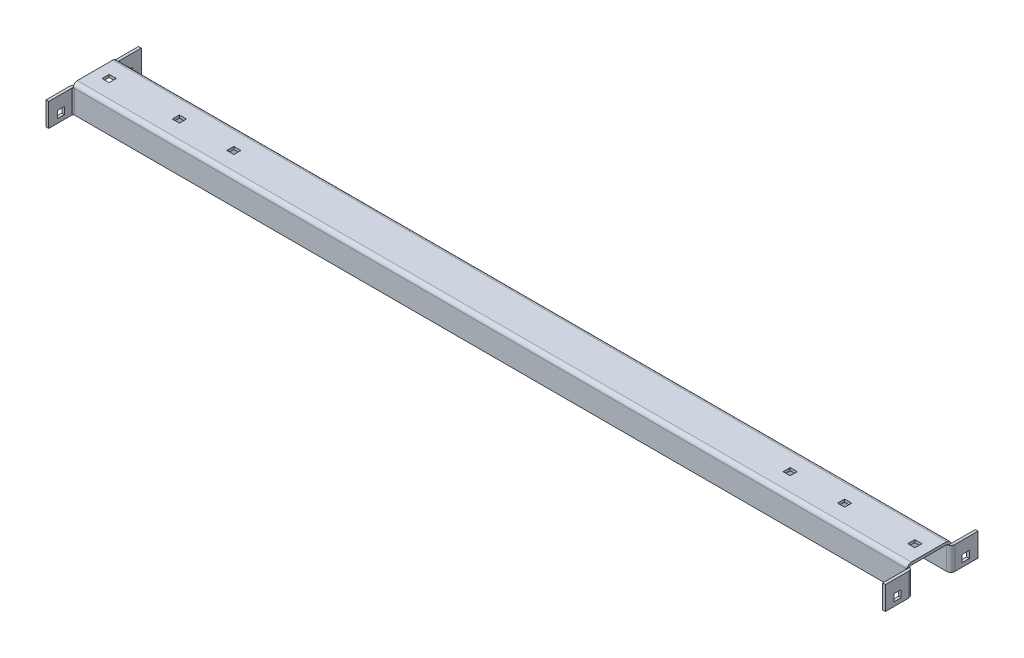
ISO-10303-21;
HEADER;
FILE_DESCRIPTION(('STEP AP214'),'2;1');
FILE_NAME('part.step','',(''),(''),'','','');
FILE_SCHEMA(('AUTOMOTIVE_DESIGN { 1 0 10303 214 1 1 1 1 }'));
ENDSEC;
DATA;
#1=APPLICATION_CONTEXT('core data for automotive mechanical design processes');
#2=APPLICATION_PROTOCOL_DEFINITION('international standard','automotive_design',2000,#1);
#3=PRODUCT_CONTEXT('',#1,'mechanical');
#4=PRODUCT('Part','Part','',(#3));
#5=PRODUCT_RELATED_PRODUCT_CATEGORY('part','',(#4));
#6=PRODUCT_DEFINITION_FORMATION('','',#4);
#7=PRODUCT_DEFINITION_CONTEXT('part definition',#1,'design');
#8=PRODUCT_DEFINITION('design','',#6,#7);
#9=PRODUCT_DEFINITION_SHAPE('','',#8);
#10=(LENGTH_UNIT() NAMED_UNIT(*) SI_UNIT(.MILLI.,.METRE.));
#11=(NAMED_UNIT(*) PLANE_ANGLE_UNIT() SI_UNIT($,.RADIAN.));
#12=(NAMED_UNIT(*) SI_UNIT($,.STERADIAN.) SOLID_ANGLE_UNIT());
#13=UNCERTAINTY_MEASURE_WITH_UNIT(LENGTH_MEASURE(1.E-05),#10,'distance_accuracy_value','');
#14=(GEOMETRIC_REPRESENTATION_CONTEXT(3) GLOBAL_UNCERTAINTY_ASSIGNED_CONTEXT((#13)) GLOBAL_UNIT_ASSIGNED_CONTEXT((#10,
#11,#12)) REPRESENTATION_CONTEXT('',''));
#15=CARTESIAN_POINT('',(0.,0.,0.));
#16=DIRECTION('',(0.,0.,1.));
#17=DIRECTION('',(1.,0.,0.));
#18=AXIS2_PLACEMENT_3D('',#15,#16,#17);
#19=CARTESIAN_POINT('',(-766.,25.,5.));
#20=DIRECTION('',(0.,-1.,0.));
#21=DIRECTION('',(0.,0.,-1.));
#22=AXIS2_PLACEMENT_3D('',#19,#20,#21);
#23=PLANE('',#22);
#24=DIRECTION('',(0.,0.,-1.));
#25=VECTOR('',#24,1.);
#26=CARTESIAN_POINT('',(604.5,25.,46.5));
#27=LINE('',#26,#25);
#28=CARTESIAN_POINT('',(604.5,25.,46.5));
#29=VERTEX_POINT('',#28);
#30=CARTESIAN_POINT('',(604.5,25.,33.5));
#31=VERTEX_POINT('',#30);
#32=EDGE_CURVE('E567',#29,#31,#27,.T.);
#33=ORIENTED_EDGE('',*,*,#32,.T.);
#34=DIRECTION('',(1.,0.,0.));
#35=VECTOR('',#34,1.);
#36=CARTESIAN_POINT('',(604.5,25.,33.5));
#37=LINE('',#36,#35);
#38=CARTESIAN_POINT('',(617.5,25.,33.5));
#39=VERTEX_POINT('',#38);
#40=EDGE_CURVE('E578',#31,#39,#37,.T.);
#41=ORIENTED_EDGE('',*,*,#40,.T.);
#42=DIRECTION('',(0.,0.,1.));
#43=VECTOR('',#42,1.);
#44=CARTESIAN_POINT('',(617.5,25.,46.5));
#45=LINE('',#44,#43);
#46=CARTESIAN_POINT('',(617.5,25.,46.5));
#47=VERTEX_POINT('',#46);
#48=EDGE_CURVE('E575',#39,#47,#45,.T.);
#49=ORIENTED_EDGE('',*,*,#48,.T.);
#50=DIRECTION('',(-1.,0.,0.));
#51=VECTOR('',#50,1.);
#52=CARTESIAN_POINT('',(604.5,25.,46.5));
#53=LINE('',#52,#51);
#54=EDGE_CURVE('E572',#47,#29,#53,.T.);
#55=ORIENTED_EDGE('',*,*,#54,.T.);
#56=EDGE_LOOP('',(#33,#41,#49,#55));
#57=FACE_BOUND('',#56,.T.);
#58=DIRECTION('',(0.,0.,-1.));
#59=VECTOR('',#58,1.);
#60=CARTESIAN_POINT('',(-766.,25.,5.));
#61=LINE('',#60,#59);
#62=CARTESIAN_POINT('',(-766.,25.,72.5));
#63=VERTEX_POINT('',#62);
#64=CARTESIAN_POINT('',(-766.,25.,7.5));
#65=VERTEX_POINT('',#64);
#66=EDGE_CURVE('E1449',#63,#65,#61,.T.);
#67=ORIENTED_EDGE('',*,*,#66,.F.);
#68=DIRECTION('',(-1.,0.,0.));
#69=VECTOR('',#68,1.);
#70=CARTESIAN_POINT('',(766.,25.,72.5));
#71=LINE('',#70,#69);
#72=CARTESIAN_POINT('',(766.,25.,72.5));
#73=VERTEX_POINT('',#72);
#74=EDGE_CURVE('E845',#63,#73,#71,.F.);
#75=ORIENTED_EDGE('',*,*,#74,.T.);
#76=DIRECTION('',(0.,0.,-1.));
#77=VECTOR('',#76,1.);
#78=CARTESIAN_POINT('',(766.,25.,5.));
#79=LINE('',#78,#77);
#80=CARTESIAN_POINT('',(766.,25.,7.5));
#81=VERTEX_POINT('',#80);
#82=EDGE_CURVE('E1452',#73,#81,#79,.T.);
#83=ORIENTED_EDGE('',*,*,#82,.T.);
#84=DIRECTION('',(-1.,0.,0.));
#85=VECTOR('',#84,1.);
#86=CARTESIAN_POINT('',(-766.,25.,7.5));
#87=LINE('',#86,#85);
#88=EDGE_CURVE('E842',#81,#65,#87,.T.);
#89=ORIENTED_EDGE('',*,*,#88,.T.);
#90=EDGE_LOOP('',(#67,#75,#83,#89));
#91=FACE_BOUND('',#90,.T.);
#92=DIRECTION('',(-1.,0.,0.));
#93=VECTOR('',#92,1.);
#94=CARTESIAN_POINT('',(-504.5,25.,33.5));
#95=LINE('',#94,#93);
#96=CARTESIAN_POINT('',(-504.5,25.,33.5));
#97=VERTEX_POINT('',#96);
#98=CARTESIAN_POINT('',(-517.5,25.,33.5));
#99=VERTEX_POINT('',#98);
#100=EDGE_CURVE('E697',#97,#99,#95,.T.);
#101=ORIENTED_EDGE('',*,*,#100,.F.);
#102=DIRECTION('',(0.,0.,-1.));
#103=VECTOR('',#102,1.);
#104=CARTESIAN_POINT('',(-504.5,25.,33.5));
#105=LINE('',#104,#103);
#106=CARTESIAN_POINT('',(-504.5,25.,46.5));
#107=VERTEX_POINT('',#106);
#108=EDGE_CURVE('E689',#107,#97,#105,.T.);
#109=ORIENTED_EDGE('',*,*,#108,.F.);
#110=DIRECTION('',(1.,0.,0.));
#111=VECTOR('',#110,1.);
#112=CARTESIAN_POINT('',(-504.5,25.,46.5));
#113=LINE('',#112,#111);
#114=CARTESIAN_POINT('',(-517.5,25.,46.5));
#115=VERTEX_POINT('',#114);
#116=EDGE_CURVE('E703',#115,#107,#113,.T.);
#117=ORIENTED_EDGE('',*,*,#116,.F.);
#118=DIRECTION('',(0.,0.,1.));
#119=VECTOR('',#118,1.);
#120=CARTESIAN_POINT('',(-517.5,25.,33.5));
#121=LINE('',#120,#119);
#122=EDGE_CURVE('E700',#99,#115,#121,.T.);
#123=ORIENTED_EDGE('',*,*,#122,.F.);
#124=EDGE_LOOP('',(#101,#109,#117,#123));
#125=FACE_BOUND('',#124,.T.);
#126=DIRECTION('',(-1.,0.,0.));
#127=VECTOR('',#126,1.);
#128=CARTESIAN_POINT('',(-604.5,25.,33.5));
#129=LINE('',#128,#127);
#130=CARTESIAN_POINT('',(-604.5,25.,33.5));
#131=VERTEX_POINT('',#130);
#132=CARTESIAN_POINT('',(-617.5,25.,33.5));
#133=VERTEX_POINT('',#132);
#134=EDGE_CURVE('E665',#131,#133,#129,.T.);
#135=ORIENTED_EDGE('',*,*,#134,.F.);
#136=DIRECTION('',(0.,0.,-1.));
#137=VECTOR('',#136,1.);
#138=CARTESIAN_POINT('',(-604.5,25.,46.5));
#139=LINE('',#138,#137);
#140=CARTESIAN_POINT('',(-604.5,25.,46.5));
#141=VERTEX_POINT('',#140);
#142=EDGE_CURVE('E657',#141,#131,#139,.T.);
#143=ORIENTED_EDGE('',*,*,#142,.F.);
#144=DIRECTION('',(1.,0.,0.));
#145=VECTOR('',#144,1.);
#146=CARTESIAN_POINT('',(-604.5,25.,46.5));
#147=LINE('',#146,#145);
#148=CARTESIAN_POINT('',(-617.5,25.,46.5));
#149=VERTEX_POINT('',#148);
#150=EDGE_CURVE('E671',#149,#141,#147,.T.);
#151=ORIENTED_EDGE('',*,*,#150,.F.);
#152=DIRECTION('',(0.,0.,1.));
#153=VECTOR('',#152,1.);
#154=CARTESIAN_POINT('',(-617.5,25.,46.5));
#155=LINE('',#154,#153);
#156=EDGE_CURVE('E668',#133,#149,#155,.T.);
#157=ORIENTED_EDGE('',*,*,#156,.F.);
#158=EDGE_LOOP('',(#135,#143,#151,#157));
#159=FACE_BOUND('',#158,.T.);
#160=DIRECTION('',(-1.,0.,0.));
#161=VECTOR('',#160,1.);
#162=CARTESIAN_POINT('',(-733.5,25.,33.5));
#163=LINE('',#162,#161);
#164=CARTESIAN_POINT('',(-733.5,25.,33.5));
#165=VERTEX_POINT('',#164);
#166=CARTESIAN_POINT('',(-746.5,25.,33.5));
#167=VERTEX_POINT('',#166);
#168=EDGE_CURVE('E633',#165,#167,#163,.T.);
#169=ORIENTED_EDGE('',*,*,#168,.F.);
#170=DIRECTION('',(0.,0.,-1.));
#171=VECTOR('',#170,1.);
#172=CARTESIAN_POINT('',(-733.5,25.,33.5));
#173=LINE('',#172,#171);
#174=CARTESIAN_POINT('',(-733.5,25.,46.5));
#175=VERTEX_POINT('',#174);
#176=EDGE_CURVE('E625',#175,#165,#173,.T.);
#177=ORIENTED_EDGE('',*,*,#176,.F.);
#178=DIRECTION('',(1.,0.,0.));
#179=VECTOR('',#178,1.);
#180=CARTESIAN_POINT('',(-733.5,25.,46.5));
#181=LINE('',#180,#179);
#182=CARTESIAN_POINT('',(-746.5,25.,46.5));
#183=VERTEX_POINT('',#182);
#184=EDGE_CURVE('E639',#183,#175,#181,.T.);
#185=ORIENTED_EDGE('',*,*,#184,.F.);
#186=DIRECTION('',(0.,0.,1.));
#187=VECTOR('',#186,1.);
#188=CARTESIAN_POINT('',(-746.5,25.,33.5));
#189=LINE('',#188,#187);
#190=EDGE_CURVE('E636',#167,#183,#189,.T.);
#191=ORIENTED_EDGE('',*,*,#190,.F.);
#192=EDGE_LOOP('',(#169,#177,#185,#191));
#193=FACE_BOUND('',#192,.T.);
#194=DIRECTION('',(0.,0.,-1.));
#195=VECTOR('',#194,1.);
#196=CARTESIAN_POINT('',(504.5,25.,33.5));
#197=LINE('',#196,#195);
#198=CARTESIAN_POINT('',(504.5,25.,46.5));
#199=VERTEX_POINT('',#198);
#200=CARTESIAN_POINT('',(504.5,25.,33.5));
#201=VERTEX_POINT('',#200);
#202=EDGE_CURVE('E594',#199,#201,#197,.T.);
#203=ORIENTED_EDGE('',*,*,#202,.T.);
#204=DIRECTION('',(1.,0.,0.));
#205=VECTOR('',#204,1.);
#206=CARTESIAN_POINT('',(504.5,25.,33.5));
#207=LINE('',#206,#205);
#208=CARTESIAN_POINT('',(517.5,25.,33.5));
#209=VERTEX_POINT('',#208);
#210=EDGE_CURVE('E609',#201,#209,#207,.T.);
#211=ORIENTED_EDGE('',*,*,#210,.T.);
#212=DIRECTION('',(0.,0.,1.));
#213=VECTOR('',#212,1.);
#214=CARTESIAN_POINT('',(517.5,25.,33.5));
#215=LINE('',#214,#213);
#216=CARTESIAN_POINT('',(517.5,25.,46.5));
#217=VERTEX_POINT('',#216);
#218=EDGE_CURVE('E606',#209,#217,#215,.T.);
#219=ORIENTED_EDGE('',*,*,#218,.T.);
#220=DIRECTION('',(-1.,0.,0.));
#221=VECTOR('',#220,1.);
#222=CARTESIAN_POINT('',(504.5,25.,46.5));
#223=LINE('',#222,#221);
#224=EDGE_CURVE('E603',#217,#199,#223,.T.);
#225=ORIENTED_EDGE('',*,*,#224,.T.);
#226=EDGE_LOOP('',(#203,#211,#219,#225));
#227=FACE_BOUND('',#226,.T.);
#228=DIRECTION('',(0.,0.,-1.));
#229=VECTOR('',#228,1.);
#230=CARTESIAN_POINT('',(733.5,25.,33.5));
#231=LINE('',#230,#229);
#232=CARTESIAN_POINT('',(733.5,25.,46.5));
#233=VERTEX_POINT('',#232);
#234=CARTESIAN_POINT('',(733.5,25.,33.5));
#235=VERTEX_POINT('',#234);
#236=EDGE_CURVE('E550',#233,#235,#231,.T.);
#237=ORIENTED_EDGE('',*,*,#236,.T.);
#238=DIRECTION('',(1.,0.,0.));
#239=VECTOR('',#238,1.);
#240=CARTESIAN_POINT('',(733.5,25.,33.5));
#241=LINE('',#240,#239);
#242=CARTESIAN_POINT('',(746.5,25.,33.5));
#243=VERTEX_POINT('',#242);
#244=EDGE_CURVE('E552',#235,#243,#241,.T.);
#245=ORIENTED_EDGE('',*,*,#244,.T.);
#246=DIRECTION('',(0.,0.,1.));
#247=VECTOR('',#246,1.);
#248=CARTESIAN_POINT('',(746.5,25.,33.5));
#249=LINE('',#248,#247);
#250=CARTESIAN_POINT('',(746.5,25.,46.5));
#251=VERTEX_POINT('',#250);
#252=EDGE_CURVE('E534',#243,#251,#249,.T.);
#253=ORIENTED_EDGE('',*,*,#252,.T.);
#254=DIRECTION('',(-1.,0.,0.));
#255=VECTOR('',#254,1.);
#256=CARTESIAN_POINT('',(733.5,25.,46.5));
#257=LINE('',#256,#255);
#258=EDGE_CURVE('E545',#251,#233,#257,.T.);
#259=ORIENTED_EDGE('',*,*,#258,.T.);
#260=EDGE_LOOP('',(#237,#245,#253,#259));
#261=FACE_BOUND('',#260,.T.);
#262=ADVANCED_FACE('F32',(#57,#91,#125,#159,#193,#227,#261),#23,.F.);
#263=CARTESIAN_POINT('',(-766.,20.,75.));
#264=DIRECTION('',(0.,1.,0.));
#265=DIRECTION('',(0.,0.,1.));
#266=AXIS2_PLACEMENT_3D('',#263,#264,#265);
#267=PLANE('',#266);
#268=DIRECTION('',(0.,0.,-1.));
#269=VECTOR('',#268,1.);
#270=CARTESIAN_POINT('',(-766.,20.,75.));
#271=LINE('',#270,#269);
#272=CARTESIAN_POINT('',(-766.,20.,72.8175416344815));
#273=VERTEX_POINT('',#272);
#274=CARTESIAN_POINT('',(-766.,20.,7.18245836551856));
#275=VERTEX_POINT('',#274);
#276=EDGE_CURVE('E851',#273,#275,#271,.T.);
#277=ORIENTED_EDGE('',*,*,#276,.T.);
#278=CARTESIAN_POINT('',(-763.5,20.,-2.5));
#279=DIRECTION('',(0.,1.,0.));
#280=DIRECTION('',(0.,0.,1.));
#281=AXIS2_PLACEMENT_3D('',#278,#279,#280);
#282=CIRCLE('',#281,10.);
#283=CARTESIAN_POINT('',(-763.5,20.,7.50000000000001));
#284=VERTEX_POINT('',#283);
#285=EDGE_CURVE('E1131',#275,#284,#282,.T.);
#286=ORIENTED_EDGE('',*,*,#285,.T.);
#287=DIRECTION('',(1.,0.,0.));
#288=VECTOR('',#287,1.);
#289=CARTESIAN_POINT('',(-766.,20.,7.50000000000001));
#290=LINE('',#289,#288);
#291=CARTESIAN_POINT('',(763.5,20.,7.50000000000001));
#292=VERTEX_POINT('',#291);
#293=EDGE_CURVE('E1144',#284,#292,#290,.T.);
#294=ORIENTED_EDGE('',*,*,#293,.T.);
#295=CARTESIAN_POINT('',(763.5,20.,-2.5));
#296=DIRECTION('',(0.,1.,0.));
#297=DIRECTION('',(0.,0.,1.));
#298=AXIS2_PLACEMENT_3D('',#295,#296,#297);
#299=CIRCLE('',#298,10.);
#300=CARTESIAN_POINT('',(766.,20.,7.18245836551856));
#301=VERTEX_POINT('',#300);
#302=EDGE_CURVE('E1147',#292,#301,#299,.T.);
#303=ORIENTED_EDGE('',*,*,#302,.T.);
#304=DIRECTION('',(0.,0.,-1.));
#305=VECTOR('',#304,1.);
#306=CARTESIAN_POINT('',(766.,20.,75.));
#307=LINE('',#306,#305);
#308=CARTESIAN_POINT('',(766.,20.,72.8175416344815));
#309=VERTEX_POINT('',#308);
#310=EDGE_CURVE('E856',#309,#301,#307,.T.);
#311=ORIENTED_EDGE('',*,*,#310,.F.);
#312=CARTESIAN_POINT('',(763.5,20.,82.5));
#313=DIRECTION('',(0.,1.,0.));
#314=DIRECTION('',(0.,0.,1.));
#315=AXIS2_PLACEMENT_3D('',#312,#313,#314);
#316=CIRCLE('',#315,10.);
#317=CARTESIAN_POINT('',(763.5,20.,72.5));
#318=VERTEX_POINT('',#317);
#319=EDGE_CURVE('E1145',#309,#318,#316,.T.);
#320=ORIENTED_EDGE('',*,*,#319,.T.);
#321=DIRECTION('',(1.,0.,0.));
#322=VECTOR('',#321,1.);
#323=CARTESIAN_POINT('',(-763.5,20.,72.5));
#324=LINE('',#323,#322);
#325=CARTESIAN_POINT('',(-763.5,20.,72.5));
#326=VERTEX_POINT('',#325);
#327=EDGE_CURVE('E850',#318,#326,#324,.F.);
#328=ORIENTED_EDGE('',*,*,#327,.T.);
#329=CARTESIAN_POINT('',(-763.5,20.,82.5));
#330=DIRECTION('',(0.,1.,0.));
#331=DIRECTION('',(0.,0.,1.));
#332=AXIS2_PLACEMENT_3D('',#329,#330,#331);
#333=CIRCLE('',#332,10.);
#334=EDGE_CURVE('E1140',#326,#273,#333,.T.);
#335=ORIENTED_EDGE('',*,*,#334,.T.);
#336=EDGE_LOOP('',(#277,#286,#294,#303,#311,#320,#328,#335));
#337=FACE_BOUND('',#336,.T.);
#338=DIRECTION('',(0.,0.,-1.));
#339=VECTOR('',#338,1.);
#340=CARTESIAN_POINT('',(604.5,20.,46.5));
#341=LINE('',#340,#339);
#342=CARTESIAN_POINT('',(604.5,20.,46.5));
#343=VERTEX_POINT('',#342);
#344=CARTESIAN_POINT('',(604.5,20.,33.5));
#345=VERTEX_POINT('',#344);
#346=EDGE_CURVE('E581',#343,#345,#341,.T.);
#347=ORIENTED_EDGE('',*,*,#346,.F.);
#348=DIRECTION('',(-1.,0.,0.));
#349=VECTOR('',#348,1.);
#350=CARTESIAN_POINT('',(604.5,20.,46.5));
#351=LINE('',#350,#349);
#352=CARTESIAN_POINT('',(617.5,20.,46.5));
#353=VERTEX_POINT('',#352);
#354=EDGE_CURVE('E583',#353,#343,#351,.T.);
#355=ORIENTED_EDGE('',*,*,#354,.F.);
#356=DIRECTION('',(0.,0.,1.));
#357=VECTOR('',#356,1.);
#358=CARTESIAN_POINT('',(617.5,20.,46.5));
#359=LINE('',#358,#357);
#360=CARTESIAN_POINT('',(617.5,20.,33.5));
#361=VERTEX_POINT('',#360);
#362=EDGE_CURVE('E585',#361,#353,#359,.T.);
#363=ORIENTED_EDGE('',*,*,#362,.F.);
#364=DIRECTION('',(1.,0.,0.));
#365=VECTOR('',#364,1.);
#366=CARTESIAN_POINT('',(604.5,20.,33.5));
#367=LINE('',#366,#365);
#368=EDGE_CURVE('E588',#345,#361,#367,.T.);
#369=ORIENTED_EDGE('',*,*,#368,.F.);
#370=EDGE_LOOP('',(#347,#355,#363,#369));
#371=FACE_BOUND('',#370,.T.);
#372=DIRECTION('',(1.,0.,0.));
#373=VECTOR('',#372,1.);
#374=CARTESIAN_POINT('',(-504.5,20.,46.5));
#375=LINE('',#374,#373);
#376=CARTESIAN_POINT('',(-517.5,20.,46.5));
#377=VERTEX_POINT('',#376);
#378=CARTESIAN_POINT('',(-504.5,20.,46.5));
#379=VERTEX_POINT('',#378);
#380=EDGE_CURVE('E715',#377,#379,#375,.T.);
#381=ORIENTED_EDGE('',*,*,#380,.T.);
#382=DIRECTION('',(0.,0.,-1.));
#383=VECTOR('',#382,1.);
#384=CARTESIAN_POINT('',(-504.5,20.,33.5));
#385=LINE('',#384,#383);
#386=CARTESIAN_POINT('',(-504.5,20.,33.5));
#387=VERTEX_POINT('',#386);
#388=EDGE_CURVE('E706',#379,#387,#385,.T.);
#389=ORIENTED_EDGE('',*,*,#388,.T.);
#390=DIRECTION('',(-1.,0.,0.));
#391=VECTOR('',#390,1.);
#392=CARTESIAN_POINT('',(-504.5,20.,33.5));
#393=LINE('',#392,#391);
#394=CARTESIAN_POINT('',(-517.5,20.,33.5));
#395=VERTEX_POINT('',#394);
#396=EDGE_CURVE('E709',#387,#395,#393,.T.);
#397=ORIENTED_EDGE('',*,*,#396,.T.);
#398=DIRECTION('',(0.,0.,1.));
#399=VECTOR('',#398,1.);
#400=CARTESIAN_POINT('',(-517.5,20.,33.5));
#401=LINE('',#400,#399);
#402=EDGE_CURVE('E712',#395,#377,#401,.T.);
#403=ORIENTED_EDGE('',*,*,#402,.T.);
#404=EDGE_LOOP('',(#381,#389,#397,#403));
#405=FACE_BOUND('',#404,.T.);
#406=DIRECTION('',(1.,0.,0.));
#407=VECTOR('',#406,1.);
#408=CARTESIAN_POINT('',(-604.5,20.,46.5));
#409=LINE('',#408,#407);
#410=CARTESIAN_POINT('',(-617.5,20.,46.5));
#411=VERTEX_POINT('',#410);
#412=CARTESIAN_POINT('',(-604.5,20.,46.5));
#413=VERTEX_POINT('',#412);
#414=EDGE_CURVE('E683',#411,#413,#409,.T.);
#415=ORIENTED_EDGE('',*,*,#414,.T.);
#416=DIRECTION('',(0.,0.,-1.));
#417=VECTOR('',#416,1.);
#418=CARTESIAN_POINT('',(-604.5,20.,46.5));
#419=LINE('',#418,#417);
#420=CARTESIAN_POINT('',(-604.5,20.,33.5));
#421=VERTEX_POINT('',#420);
#422=EDGE_CURVE('E674',#413,#421,#419,.T.);
#423=ORIENTED_EDGE('',*,*,#422,.T.);
#424=DIRECTION('',(-1.,0.,0.));
#425=VECTOR('',#424,1.);
#426=CARTESIAN_POINT('',(-604.5,20.,33.5));
#427=LINE('',#426,#425);
#428=CARTESIAN_POINT('',(-617.5,20.,33.5));
#429=VERTEX_POINT('',#428);
#430=EDGE_CURVE('E677',#421,#429,#427,.T.);
#431=ORIENTED_EDGE('',*,*,#430,.T.);
#432=DIRECTION('',(0.,0.,1.));
#433=VECTOR('',#432,1.);
#434=CARTESIAN_POINT('',(-617.5,20.,46.5));
#435=LINE('',#434,#433);
#436=EDGE_CURVE('E680',#429,#411,#435,.T.);
#437=ORIENTED_EDGE('',*,*,#436,.T.);
#438=EDGE_LOOP('',(#415,#423,#431,#437));
#439=FACE_BOUND('',#438,.T.);
#440=DIRECTION('',(1.,0.,0.));
#441=VECTOR('',#440,1.);
#442=CARTESIAN_POINT('',(-733.5,20.,46.5));
#443=LINE('',#442,#441);
#444=CARTESIAN_POINT('',(-746.5,20.,46.5));
#445=VERTEX_POINT('',#444);
#446=CARTESIAN_POINT('',(-733.5,20.,46.5));
#447=VERTEX_POINT('',#446);
#448=EDGE_CURVE('E651',#445,#447,#443,.T.);
#449=ORIENTED_EDGE('',*,*,#448,.T.);
#450=DIRECTION('',(0.,0.,-1.));
#451=VECTOR('',#450,1.);
#452=CARTESIAN_POINT('',(-733.5,20.,33.5));
#453=LINE('',#452,#451);
#454=CARTESIAN_POINT('',(-733.5,20.,33.5));
#455=VERTEX_POINT('',#454);
#456=EDGE_CURVE('E642',#447,#455,#453,.T.);
#457=ORIENTED_EDGE('',*,*,#456,.T.);
#458=DIRECTION('',(-1.,0.,0.));
#459=VECTOR('',#458,1.);
#460=CARTESIAN_POINT('',(-733.5,20.,33.5));
#461=LINE('',#460,#459);
#462=CARTESIAN_POINT('',(-746.5,20.,33.5));
#463=VERTEX_POINT('',#462);
#464=EDGE_CURVE('E645',#455,#463,#461,.T.);
#465=ORIENTED_EDGE('',*,*,#464,.T.);
#466=DIRECTION('',(0.,0.,1.));
#467=VECTOR('',#466,1.);
#468=CARTESIAN_POINT('',(-746.5,20.,33.5));
#469=LINE('',#468,#467);
#470=EDGE_CURVE('E648',#463,#445,#469,.T.);
#471=ORIENTED_EDGE('',*,*,#470,.T.);
#472=EDGE_LOOP('',(#449,#457,#465,#471));
#473=FACE_BOUND('',#472,.T.);
#474=DIRECTION('',(0.,0.,-1.));
#475=VECTOR('',#474,1.);
#476=CARTESIAN_POINT('',(504.5,20.,33.5));
#477=LINE('',#476,#475);
#478=CARTESIAN_POINT('',(504.5,20.,46.5));
#479=VERTEX_POINT('',#478);
#480=CARTESIAN_POINT('',(504.5,20.,33.5));
#481=VERTEX_POINT('',#480);
#482=EDGE_CURVE('E612',#479,#481,#477,.T.);
#483=ORIENTED_EDGE('',*,*,#482,.F.);
#484=DIRECTION('',(-1.,0.,0.));
#485=VECTOR('',#484,1.);
#486=CARTESIAN_POINT('',(504.5,20.,46.5));
#487=LINE('',#486,#485);
#488=CARTESIAN_POINT('',(517.5,20.,46.5));
#489=VERTEX_POINT('',#488);
#490=EDGE_CURVE('E614',#489,#479,#487,.T.);
#491=ORIENTED_EDGE('',*,*,#490,.F.);
#492=DIRECTION('',(0.,0.,1.));
#493=VECTOR('',#492,1.);
#494=CARTESIAN_POINT('',(517.5,20.,33.5));
#495=LINE('',#494,#493);
#496=CARTESIAN_POINT('',(517.5,20.,33.5));
#497=VERTEX_POINT('',#496);
#498=EDGE_CURVE('E616',#497,#489,#495,.T.);
#499=ORIENTED_EDGE('',*,*,#498,.F.);
#500=DIRECTION('',(1.,0.,0.));
#501=VECTOR('',#500,1.);
#502=CARTESIAN_POINT('',(504.5,20.,33.5));
#503=LINE('',#502,#501);
#504=EDGE_CURVE('E619',#481,#497,#503,.T.);
#505=ORIENTED_EDGE('',*,*,#504,.F.);
#506=EDGE_LOOP('',(#483,#491,#499,#505));
#507=FACE_BOUND('',#506,.T.);
#508=DIRECTION('',(0.,0.,-1.));
#509=VECTOR('',#508,1.);
#510=CARTESIAN_POINT('',(733.5,20.,33.5));
#511=LINE('',#510,#509);
#512=CARTESIAN_POINT('',(733.5,20.,46.5));
#513=VERTEX_POINT('',#512);
#514=CARTESIAN_POINT('',(733.5,20.,33.5));
#515=VERTEX_POINT('',#514);
#516=EDGE_CURVE('E554',#513,#515,#511,.T.);
#517=ORIENTED_EDGE('',*,*,#516,.F.);
#518=DIRECTION('',(-1.,0.,0.));
#519=VECTOR('',#518,1.);
#520=CARTESIAN_POINT('',(733.5,20.,46.5));
#521=LINE('',#520,#519);
#522=CARTESIAN_POINT('',(746.5,20.,46.5));
#523=VERTEX_POINT('',#522);
#524=EDGE_CURVE('E559',#523,#513,#521,.T.);
#525=ORIENTED_EDGE('',*,*,#524,.F.);
#526=DIRECTION('',(0.,0.,1.));
#527=VECTOR('',#526,1.);
#528=CARTESIAN_POINT('',(746.5,20.,33.5));
#529=LINE('',#528,#527);
#530=CARTESIAN_POINT('',(746.5,20.,33.5));
#531=VERTEX_POINT('',#530);
#532=EDGE_CURVE('E537',#531,#523,#529,.T.);
#533=ORIENTED_EDGE('',*,*,#532,.F.);
#534=DIRECTION('',(1.,0.,0.));
#535=VECTOR('',#534,1.);
#536=CARTESIAN_POINT('',(733.5,20.,33.5));
#537=LINE('',#536,#535);
#538=EDGE_CURVE('E562',#515,#531,#537,.T.);
#539=ORIENTED_EDGE('',*,*,#538,.F.);
#540=EDGE_LOOP('',(#517,#525,#533,#539));
#541=FACE_BOUND('',#540,.T.);
#542=ADVANCED_FACE('F1065',(#337,#371,#405,#439,#473,#507,#541),#267,.F.);
#543=CARTESIAN_POINT('',(-766.,25.,5.));
#544=DIRECTION('',(1.,0.,0.));
#545=DIRECTION('',(0.,0.,-1.));
#546=AXIS2_PLACEMENT_3D('',#543,#544,#545);
#547=PLANE('',#546);
#548=ORIENTED_EDGE('',*,*,#276,.F.);
#549=CARTESIAN_POINT('',(-766.,20.,72.8175416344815));
#550=CARTESIAN_POINT('',(-766.,19.9999985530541,72.8929189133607));
#551=CARTESIAN_POINT('',(-766.,19.9968022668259,72.9682583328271));
#552=CARTESIAN_POINT('',(-766.,19.9840725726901,73.1183947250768));
#553=CARTESIAN_POINT('',(-766.,19.974539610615,73.1931917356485));
#554=CARTESIAN_POINT('',(-766.,19.9365374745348,73.4159466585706));
#555=CARTESIAN_POINT('',(-766.,19.898664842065,73.5624106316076));
#556=CARTESIAN_POINT('',(-766.,19.798924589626,73.8468905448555));
#557=CARTESIAN_POINT('',(-766.,19.7370506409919,73.9849042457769));
#558=CARTESIAN_POINT('',(-766.,19.5908974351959,74.2485202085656));
#559=CARTESIAN_POINT('',(-766.,19.5066224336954,74.3741248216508));
#560=CARTESIAN_POINT('',(-766.,19.3183000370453,74.6083777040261));
#561=CARTESIAN_POINT('',(-766.,19.2143666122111,74.7171174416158));
#562=CARTESIAN_POINT('',(-766.,18.9891397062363,74.9147501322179));
#563=CARTESIAN_POINT('',(-766.,18.8678563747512,75.0036546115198));
#564=CARTESIAN_POINT('',(-766.,18.6254754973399,75.1496784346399));
#565=CARTESIAN_POINT('',(-766.,18.5058477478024,75.2092287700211));
#566=CARTESIAN_POINT('',(-766.,18.3202992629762,75.2832728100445));
#567=CARTESIAN_POINT('',(-766.,18.2573521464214,75.3054247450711));
#568=CARTESIAN_POINT('',(-766.,18.1298122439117,75.3444264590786));
#569=CARTESIAN_POINT('',(-766.,18.0652188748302,75.3612743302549));
#570=CARTESIAN_POINT('',(-766.,18.,75.3753803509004));
#571=B_SPLINE_CURVE_WITH_KNOTS('',3,(#549,#550,#551,#552,#553,#554,#555,#556,#557,#558,#559,
#560,#561,#562,#563,#564,#565,#566,#567,#568,#569,#570),.UNSPECIFIED.,.F.,.F.,(4,2,2,2,2,2,2,2,
2,2,4),(0.,0.225989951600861,0.451964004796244,0.903491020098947,1.3551371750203,
1.80669758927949,2.25571614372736,2.70447308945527,3.10348373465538,3.30347321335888,
3.50353454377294),.UNSPECIFIED.);
#572=CARTESIAN_POINT('',(-766.,18.,75.3753803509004));
#573=VERTEX_POINT('',#572);
#574=EDGE_CURVE('E939',#273,#573,#571,.T.);
#575=ORIENTED_EDGE('',*,*,#574,.T.);
#576=DIRECTION('',(0.,0.,-1.));
#577=VECTOR('',#576,1.);
#578=CARTESIAN_POINT('',(-766.,18.,75.));
#579=LINE('',#578,#577);
#580=CARTESIAN_POINT('',(-766.,18.,79.9833147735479));
#581=VERTEX_POINT('',#580);
#582=EDGE_CURVE('E1485',#581,#573,#579,.T.);
#583=ORIENTED_EDGE('',*,*,#582,.F.);
#584=CARTESIAN_POINT('',(-766.,17.5,72.5));
#585=DIRECTION('',(1.,0.,0.));
#586=DIRECTION('',(0.,0.,-1.));
#587=AXIS2_PLACEMENT_3D('',#584,#585,#586);
#588=CIRCLE('',#587,7.5);
#589=EDGE_CURVE('E1215',#581,#63,#588,.F.);
#590=ORIENTED_EDGE('',*,*,#589,.T.);
#591=ORIENTED_EDGE('',*,*,#66,.T.);
#592=CARTESIAN_POINT('',(-766.,17.5,7.5));
#593=DIRECTION('',(1.,0.,0.));
#594=DIRECTION('',(0.,0.,-1.));
#595=AXIS2_PLACEMENT_3D('',#592,#593,#594);
#596=CIRCLE('',#595,7.5);
#597=CARTESIAN_POINT('',(-766.,18.,0.0166852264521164));
#598=VERTEX_POINT('',#597);
#599=EDGE_CURVE('E1213',#65,#598,#596,.F.);
#600=ORIENTED_EDGE('',*,*,#599,.T.);
#601=DIRECTION('',(0.,0.,-1.));
#602=VECTOR('',#601,1.);
#603=CARTESIAN_POINT('',(-766.,18.,-45.));
#604=LINE('',#603,#602);
#605=CARTESIAN_POINT('',(-766.,18.,4.62461964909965));
#606=VERTEX_POINT('',#605);
#607=EDGE_CURVE('E1136',#606,#598,#604,.T.);
#608=ORIENTED_EDGE('',*,*,#607,.F.);
#609=CARTESIAN_POINT('',(-766.,18.,4.62461964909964));
#610=CARTESIAN_POINT('',(-766.,18.0678892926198,4.63929628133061));
#611=CARTESIAN_POINT('',(-766.,18.1351229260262,4.65696064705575));
#612=CARTESIAN_POINT('',(-766.,18.2677907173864,4.69803375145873));
#613=CARTESIAN_POINT('',(-766.,18.3332254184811,4.72144073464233));
#614=CARTESIAN_POINT('',(-766.,18.4616916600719,4.77371310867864));
#615=CARTESIAN_POINT('',(-766.,18.5247286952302,4.80256498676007));
#616=CARTESIAN_POINT('',(-766.,18.6481333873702,4.86547140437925));
#617=CARTESIAN_POINT('',(-766.,18.7085009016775,4.89952622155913));
#618=CARTESIAN_POINT('',(-766.,18.88490708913,5.0089932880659));
#619=CARTESIAN_POINT('',(-766.,18.9964687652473,5.09179823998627));
#620=CARTESIAN_POINT('',(-766.,19.2047130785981,5.27429563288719));
#621=CARTESIAN_POINT('',(-766.,19.3013906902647,5.37399375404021));
#622=CARTESIAN_POINT('',(-766.,19.4810651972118,5.59134758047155));
#623=CARTESIAN_POINT('',(-766.,19.5634231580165,5.7095314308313));
#624=CARTESIAN_POINT('',(-766.,19.7080651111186,5.95772888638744));
#625=CARTESIAN_POINT('',(-766.,19.7703380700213,6.08774894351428));
#626=CARTESIAN_POINT('',(-766.,19.8511220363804,6.29821199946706));
#627=CARTESIAN_POINT('',(-766.,19.8769368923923,6.37593547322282));
#628=CARTESIAN_POINT('',(-766.,19.9213798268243,6.53344254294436));
#629=CARTESIAN_POINT('',(-766.,19.9400068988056,6.61322642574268));
#630=CARTESIAN_POINT('',(-766.,19.9699082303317,6.77423954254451));
#631=CARTESIAN_POINT('',(-766.,19.9811750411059,6.85547015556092));
#632=CARTESIAN_POINT('',(-766.,19.9962249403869,7.01861786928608));
#633=CARTESIAN_POINT('',(-766.,20.0000083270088,7.10053494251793));
#634=CARTESIAN_POINT('',(-766.,20.,7.18245836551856));
#635=B_SPLINE_CURVE_WITH_KNOTS('',3,(#609,#610,#611,#612,#613,#614,#615,#616,#617,#618,#619,
#620,#621,#622,#623,#624,#625,#626,#627,#628,#629,#630,#631,#632,#633,#634),.UNSPECIFIED.,.F.,
.F.,(4,2,2,2,2,2,2,2,2,2,2,2,4),(0.,0.208291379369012,0.41651916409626,0.62423682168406,
0.831965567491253,1.24672051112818,1.66161519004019,2.09186886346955,2.52235848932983,
2.76775866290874,3.01319318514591,3.25887571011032,3.50454844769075),.UNSPECIFIED.);
#636=EDGE_CURVE('E908',#606,#275,#635,.T.);
#637=ORIENTED_EDGE('',*,*,#636,.T.);
#638=EDGE_LOOP('',(#548,#575,#583,#590,#591,#600,#608,#637));
#639=FACE_BOUND('',#638,.T.);
#640=ADVANCED_FACE('F34',(#639),#547,.F.);
#641=CARTESIAN_POINT('',(-766.,-25.,5.));
#642=DIRECTION('',(0.,1.,0.));
#643=DIRECTION('',(0.,0.,1.));
#644=AXIS2_PLACEMENT_3D('',#641,#642,#643);
#645=PLANE('',#644);
#646=DIRECTION('',(1.,0.,0.));
#647=VECTOR('',#646,1.);
#648=CARTESIAN_POINT('',(-766.,-25.,5.));
#649=LINE('',#648,#647);
#650=CARTESIAN_POINT('',(-763.5,-25.,5.));
#651=VERTEX_POINT('',#650);
#652=CARTESIAN_POINT('',(763.5,-25.,5.));
#653=VERTEX_POINT('',#652);
#654=EDGE_CURVE('E871',#651,#653,#649,.T.);
#655=ORIENTED_EDGE('',*,*,#654,.F.);
#656=CARTESIAN_POINT('',(-763.5,-25.,-2.5));
#657=DIRECTION('',(0.,1.,0.));
#658=DIRECTION('',(0.,0.,1.));
#659=AXIS2_PLACEMENT_3D('',#656,#657,#658);
#660=CIRCLE('',#659,7.5);
#661=CARTESIAN_POINT('',(-771.,-25.,-2.5));
#662=VERTEX_POINT('',#661);
#663=EDGE_CURVE('E1224',#651,#662,#660,.F.);
#664=ORIENTED_EDGE('',*,*,#663,.T.);
#665=DIRECTION('',(0.,0.,1.));
#666=VECTOR('',#665,1.);
#667=CARTESIAN_POINT('',(-771.,-25.,-45.));
#668=LINE('',#667,#666);
#669=CARTESIAN_POINT('',(-771.,-25.,-45.));
#670=VERTEX_POINT('',#669);
#671=EDGE_CURVE('E1120',#670,#662,#668,.T.);
#672=ORIENTED_EDGE('',*,*,#671,.F.);
#673=DIRECTION('',(1.,0.,0.));
#674=VECTOR('',#673,1.);
#675=CARTESIAN_POINT('',(-771.,-25.,-45.));
#676=LINE('',#675,#674);
#677=CARTESIAN_POINT('',(-766.,-25.,-45.));
#678=VERTEX_POINT('',#677);
#679=EDGE_CURVE('E1541',#670,#678,#676,.T.);
#680=ORIENTED_EDGE('',*,*,#679,.T.);
#681=DIRECTION('',(0.,0.,1.));
#682=VECTOR('',#681,1.);
#683=CARTESIAN_POINT('',(-766.,-25.,-45.));
#684=LINE('',#683,#682);
#685=CARTESIAN_POINT('',(-766.,-25.,-2.5));
#686=VERTEX_POINT('',#685);
#687=EDGE_CURVE('E1198',#678,#686,#684,.T.);
#688=ORIENTED_EDGE('',*,*,#687,.T.);
#689=CARTESIAN_POINT('',(-763.5,-25.,-2.5));
#690=DIRECTION('',(0.,1.,0.));
#691=DIRECTION('',(0.,0.,1.));
#692=AXIS2_PLACEMENT_3D('',#689,#690,#691);
#693=CIRCLE('',#692,2.5);
#694=CARTESIAN_POINT('',(-763.5,-25.,0.));
#695=VERTEX_POINT('',#694);
#696=EDGE_CURVE('E41',#686,#695,#693,.T.);
#697=ORIENTED_EDGE('',*,*,#696,.T.);
#698=DIRECTION('',(1.,0.,0.));
#699=VECTOR('',#698,1.);
#700=CARTESIAN_POINT('',(-766.,-25.,0.));
#701=LINE('',#700,#699);
#702=CARTESIAN_POINT('',(763.5,-25.,0.));
#703=VERTEX_POINT('',#702);
#704=EDGE_CURVE('E855',#695,#703,#701,.T.);
#705=ORIENTED_EDGE('',*,*,#704,.T.);
#706=CARTESIAN_POINT('',(763.5,-25.,-2.5));
#707=DIRECTION('',(0.,1.,0.));
#708=DIRECTION('',(0.,0.,1.));
#709=AXIS2_PLACEMENT_3D('',#706,#707,#708);
#710=CIRCLE('',#709,2.5);
#711=CARTESIAN_POINT('',(766.,-25.,-2.5));
#712=VERTEX_POINT('',#711);
#713=EDGE_CURVE('E1032',#703,#712,#710,.T.);
#714=ORIENTED_EDGE('',*,*,#713,.T.);
#715=DIRECTION('',(0.,0.,1.));
#716=VECTOR('',#715,1.);
#717=CARTESIAN_POINT('',(766.,-25.,-45.));
#718=LINE('',#717,#716);
#719=CARTESIAN_POINT('',(766.,-25.,-45.));
#720=VERTEX_POINT('',#719);
#721=EDGE_CURVE('E829',#720,#712,#718,.T.);
#722=ORIENTED_EDGE('',*,*,#721,.F.);
#723=DIRECTION('',(-1.,0.,0.));
#724=VECTOR('',#723,1.);
#725=CARTESIAN_POINT('',(771.,-25.,-45.));
#726=LINE('',#725,#724);
#727=CARTESIAN_POINT('',(771.,-25.,-45.));
#728=VERTEX_POINT('',#727);
#729=EDGE_CURVE('E1637',#728,#720,#726,.T.);
#730=ORIENTED_EDGE('',*,*,#729,.F.);
#731=DIRECTION('',(0.,0.,1.));
#732=VECTOR('',#731,1.);
#733=CARTESIAN_POINT('',(771.,-25.,-45.));
#734=LINE('',#733,#732);
#735=CARTESIAN_POINT('',(771.,-25.,-2.5));
#736=VERTEX_POINT('',#735);
#737=EDGE_CURVE('E1436',#728,#736,#734,.T.);
#738=ORIENTED_EDGE('',*,*,#737,.T.);
#739=CARTESIAN_POINT('',(763.5,-25.,-2.5));
#740=DIRECTION('',(0.,1.,0.));
#741=DIRECTION('',(0.,0.,1.));
#742=AXIS2_PLACEMENT_3D('',#739,#740,#741);
#743=CIRCLE('',#742,7.5);
#744=EDGE_CURVE('E1223',#736,#653,#743,.F.);
#745=ORIENTED_EDGE('',*,*,#744,.T.);
#746=EDGE_LOOP('',(#655,#664,#672,#680,#688,#697,#705,#714,#722,#730,#738,#745));
#747=FACE_BOUND('',#746,.T.);
#748=ADVANCED_FACE('F1642',(#747),#645,.F.);
#749=CARTESIAN_POINT('',(766.,25.,5.));
#750=DIRECTION('',(-1.,0.,0.));
#751=DIRECTION('',(0.,0.,1.));
#752=AXIS2_PLACEMENT_3D('',#749,#750,#751);
#753=PLANE('',#752);
#754=DIRECTION('',(0.,0.,-1.));
#755=VECTOR('',#754,1.);
#756=CARTESIAN_POINT('',(766.,18.,75.));
#757=LINE('',#756,#755);
#758=CARTESIAN_POINT('',(766.,18.,79.9833147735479));
#759=VERTEX_POINT('',#758);
#760=CARTESIAN_POINT('',(766.,18.,75.3753803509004));
#761=VERTEX_POINT('',#760);
#762=EDGE_CURVE('E759',#759,#761,#757,.T.);
#763=ORIENTED_EDGE('',*,*,#762,.T.);
#764=CARTESIAN_POINT('',(766.,18.,75.3753803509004));
#765=CARTESIAN_POINT('',(766.,18.0678892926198,75.3607037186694));
#766=CARTESIAN_POINT('',(766.,18.1351229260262,75.3430393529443));
#767=CARTESIAN_POINT('',(766.,18.2677907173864,75.3019662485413));
#768=CARTESIAN_POINT('',(766.,18.3332254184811,75.2785592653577));
#769=CARTESIAN_POINT('',(766.,18.4616916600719,75.2262868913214));
#770=CARTESIAN_POINT('',(766.,18.5247286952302,75.19743501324));
#771=CARTESIAN_POINT('',(766.,18.6481333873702,75.1345285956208));
#772=CARTESIAN_POINT('',(766.,18.7085009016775,75.1004737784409));
#773=CARTESIAN_POINT('',(766.,18.88490708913,74.9910067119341));
#774=CARTESIAN_POINT('',(766.,18.9964687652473,74.9082017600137));
#775=CARTESIAN_POINT('',(766.,19.2047130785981,74.7257043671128));
#776=CARTESIAN_POINT('',(766.,19.3013906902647,74.6260062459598));
#777=CARTESIAN_POINT('',(766.,19.4810651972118,74.4086524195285));
#778=CARTESIAN_POINT('',(766.,19.5634231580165,74.2904685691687));
#779=CARTESIAN_POINT('',(766.,19.7080651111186,74.0422711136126));
#780=CARTESIAN_POINT('',(766.,19.7703380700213,73.9122510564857));
#781=CARTESIAN_POINT('',(766.,19.8511220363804,73.701788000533));
#782=CARTESIAN_POINT('',(766.,19.8769368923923,73.6240645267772));
#783=CARTESIAN_POINT('',(766.,19.9213798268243,73.4665574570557));
#784=CARTESIAN_POINT('',(766.,19.9400068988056,73.3867735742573));
#785=CARTESIAN_POINT('',(766.,19.9699082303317,73.2257604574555));
#786=CARTESIAN_POINT('',(766.,19.9811750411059,73.1445298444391));
#787=CARTESIAN_POINT('',(766.,19.9962249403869,72.981382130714));
#788=CARTESIAN_POINT('',(766.,20.0000083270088,72.8994650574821));
#789=CARTESIAN_POINT('',(766.,20.,72.8175416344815));
#790=B_SPLINE_CURVE_WITH_KNOTS('',3,(#764,#765,#766,#767,#768,#769,#770,#771,#772,#773,#774,
#775,#776,#777,#778,#779,#780,#781,#782,#783,#784,#785,#786,#787,#788,#789),.UNSPECIFIED.,.F.,
.F.,(4,2,2,2,2,2,2,2,2,2,2,2,4),(0.,0.208291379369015,0.416519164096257,0.624236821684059,
0.831965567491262,1.24672051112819,1.6616151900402,2.09186886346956,2.52235848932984,
2.76775866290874,3.0131931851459,3.25887571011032,3.50454844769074),.UNSPECIFIED.);
#791=EDGE_CURVE('E969',#761,#309,#790,.T.);
#792=ORIENTED_EDGE('',*,*,#791,.T.);
#793=ORIENTED_EDGE('',*,*,#310,.T.);
#794=CARTESIAN_POINT('',(766.,20.,7.18245836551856));
#795=CARTESIAN_POINT('',(766.,19.9999985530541,7.10708108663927));
#796=CARTESIAN_POINT('',(766.,19.9968022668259,7.03174166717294));
#797=CARTESIAN_POINT('',(766.,19.9840725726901,6.8816052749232));
#798=CARTESIAN_POINT('',(766.,19.974539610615,6.8068082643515));
#799=CARTESIAN_POINT('',(766.,19.9365374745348,6.58405334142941));
#800=CARTESIAN_POINT('',(766.,19.898664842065,6.43758936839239));
#801=CARTESIAN_POINT('',(766.,19.798924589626,6.15310945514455));
#802=CARTESIAN_POINT('',(766.,19.7370506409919,6.01509575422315));
#803=CARTESIAN_POINT('',(766.,19.5908974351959,5.75147979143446));
#804=CARTESIAN_POINT('',(766.,19.5066224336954,5.62587517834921));
#805=CARTESIAN_POINT('',(766.,19.3183000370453,5.39162229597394));
#806=CARTESIAN_POINT('',(766.,19.2143666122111,5.28288255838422));
#807=CARTESIAN_POINT('',(766.,18.9891397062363,5.08524986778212));
#808=CARTESIAN_POINT('',(766.,18.8678563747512,4.99634538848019));
#809=CARTESIAN_POINT('',(766.,18.6254754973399,4.85032156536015));
#810=CARTESIAN_POINT('',(766.,18.5058477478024,4.79077122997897));
#811=CARTESIAN_POINT('',(766.,18.3202992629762,4.71672718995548));
#812=CARTESIAN_POINT('',(766.,18.2573521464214,4.69457525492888));
#813=CARTESIAN_POINT('',(766.,18.1298122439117,4.65557354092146));
#814=CARTESIAN_POINT('',(766.,18.0652188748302,4.63872566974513));
#815=CARTESIAN_POINT('',(766.,18.,4.62461964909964));
#816=B_SPLINE_CURVE_WITH_KNOTS('',3,(#794,#795,#796,#797,#798,#799,#800,#801,#802,#803,#804,
#805,#806,#807,#808,#809,#810,#811,#812,#813,#814,#815),.UNSPECIFIED.,.F.,.F.,(4,2,2,2,2,2,2,2,
2,2,4),(0.,0.225989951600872,0.451964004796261,0.903491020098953,1.35513717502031,
1.8066975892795,2.25571614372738,2.70447308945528,3.10348373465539,3.30347321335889,
3.50353454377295),.UNSPECIFIED.);
#817=CARTESIAN_POINT('',(766.,18.,4.62461964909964));
#818=VERTEX_POINT('',#817);
#819=EDGE_CURVE('E913',#301,#818,#816,.T.);
#820=ORIENTED_EDGE('',*,*,#819,.T.);
#821=DIRECTION('',(0.,0.,-1.));
#822=VECTOR('',#821,1.);
#823=CARTESIAN_POINT('',(766.,18.,-45.));
#824=LINE('',#823,#822);
#825=CARTESIAN_POINT('',(766.,18.,0.0166852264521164));
#826=VERTEX_POINT('',#825);
#827=EDGE_CURVE('E825',#818,#826,#824,.T.);
#828=ORIENTED_EDGE('',*,*,#827,.T.);
#829=CARTESIAN_POINT('',(766.,17.5,7.5));
#830=DIRECTION('',(-1.,0.,0.));
#831=DIRECTION('',(0.,0.,1.));
#832=AXIS2_PLACEMENT_3D('',#829,#830,#831);
#833=CIRCLE('',#832,7.5);
#834=EDGE_CURVE('E832',#826,#81,#833,.F.);
#835=ORIENTED_EDGE('',*,*,#834,.T.);
#836=ORIENTED_EDGE('',*,*,#82,.F.);
#837=CARTESIAN_POINT('',(766.,17.5,72.5));
#838=DIRECTION('',(-1.,0.,0.));
#839=DIRECTION('',(0.,0.,1.));
#840=AXIS2_PLACEMENT_3D('',#837,#838,#839);
#841=CIRCLE('',#840,7.5);
#842=EDGE_CURVE('E834',#73,#759,#841,.F.);
#843=ORIENTED_EDGE('',*,*,#842,.T.);
#844=EDGE_LOOP('',(#763,#792,#793,#820,#828,#835,#836,#843));
#845=FACE_BOUND('',#844,.T.);
#846=ADVANCED_FACE('F922',(#845),#753,.F.);
#847=CARTESIAN_POINT('',(-766.,-25.,5.));
#848=DIRECTION('',(0.,0.,1.));
#849=DIRECTION('',(1.,0.,0.));
#850=AXIS2_PLACEMENT_3D('',#847,#848,#849);
#851=PLANE('',#850);
#852=DIRECTION('',(0.,1.,0.));
#853=VECTOR('',#852,1.);
#854=CARTESIAN_POINT('',(763.5,-25.,5.));
#855=LINE('',#854,#853);
#856=CARTESIAN_POINT('',(763.5,17.5,5.));
#857=VERTEX_POINT('',#856);
#858=EDGE_CURVE('E1218',#653,#857,#855,.T.);
#859=ORIENTED_EDGE('',*,*,#858,.T.);
#860=DIRECTION('',(1.,0.,0.));
#861=VECTOR('',#860,1.);
#862=CARTESIAN_POINT('',(-766.,17.5,5.));
#863=LINE('',#862,#861);
#864=CARTESIAN_POINT('',(-763.5,17.5,5.));
#865=VERTEX_POINT('',#864);
#866=EDGE_CURVE('E1447',#857,#865,#863,.F.);
#867=ORIENTED_EDGE('',*,*,#866,.T.);
#868=DIRECTION('',(0.,1.,0.));
#869=VECTOR('',#868,1.);
#870=CARTESIAN_POINT('',(-763.5,-25.,5.));
#871=LINE('',#870,#869);
#872=EDGE_CURVE('E1221',#865,#651,#871,.F.);
#873=ORIENTED_EDGE('',*,*,#872,.T.);
#874=ORIENTED_EDGE('',*,*,#654,.T.);
#875=EDGE_LOOP('',(#859,#867,#873,#874));
#876=FACE_BOUND('',#875,.T.);
#877=ADVANCED_FACE('F1074',(#876),#851,.T.);
#878=CARTESIAN_POINT('',(-766.,-25.,0.));
#879=DIRECTION('',(0.,0.,1.));
#880=DIRECTION('',(1.,0.,0.));
#881=AXIS2_PLACEMENT_3D('',#878,#879,#880);
#882=PLANE('',#881);
#883=DIRECTION('',(-1.,0.,0.));
#884=VECTOR('',#883,1.);
#885=CARTESIAN_POINT('',(-766.,17.5,0.));
#886=LINE('',#885,#884);
#887=CARTESIAN_POINT('',(-763.5,17.5,0.));
#888=VERTEX_POINT('',#887);
#889=CARTESIAN_POINT('',(763.5,17.5,0.));
#890=VERTEX_POINT('',#889);
#891=EDGE_CURVE('E847',#888,#890,#886,.F.);
#892=ORIENTED_EDGE('',*,*,#891,.T.);
#893=DIRECTION('',(0.,1.,0.));
#894=VECTOR('',#893,1.);
#895=CARTESIAN_POINT('',(763.5,-25.,0.));
#896=LINE('',#895,#894);
#897=EDGE_CURVE('E876',#890,#703,#896,.F.);
#898=ORIENTED_EDGE('',*,*,#897,.T.);
#899=ORIENTED_EDGE('',*,*,#704,.F.);
#900=DIRECTION('',(0.,-1.,0.));
#901=VECTOR('',#900,1.);
#902=CARTESIAN_POINT('',(-763.5,17.5,0.));
#903=LINE('',#902,#901);
#904=EDGE_CURVE('E874',#695,#888,#903,.F.);
#905=ORIENTED_EDGE('',*,*,#904,.T.);
#906=EDGE_LOOP('',(#892,#898,#899,#905));
#907=FACE_BOUND('',#906,.T.);
#908=ADVANCED_FACE('F1077',(#907),#882,.F.);
#909=CARTESIAN_POINT('',(-766.,-25.,75.));
#910=DIRECTION('',(0.,0.,1.));
#911=DIRECTION('',(1.,0.,0.));
#912=AXIS2_PLACEMENT_3D('',#909,#910,#911);
#913=PLANE('',#912);
#914=DIRECTION('',(0.,-1.,0.));
#915=VECTOR('',#914,1.);
#916=CARTESIAN_POINT('',(-763.5,18.,75.));
#917=LINE('',#916,#915);
#918=CARTESIAN_POINT('',(-763.5,-25.,75.));
#919=VERTEX_POINT('',#918);
#920=CARTESIAN_POINT('',(-763.5,17.5,75.));
#921=VERTEX_POINT('',#920);
#922=EDGE_CURVE('E1211',#919,#921,#917,.F.);
#923=ORIENTED_EDGE('',*,*,#922,.T.);
#924=DIRECTION('',(1.,0.,0.));
#925=VECTOR('',#924,1.);
#926=CARTESIAN_POINT('',(763.5,17.5,75.));
#927=LINE('',#926,#925);
#928=CARTESIAN_POINT('',(763.5,17.5,75.));
#929=VERTEX_POINT('',#928);
#930=EDGE_CURVE('E872',#921,#929,#927,.T.);
#931=ORIENTED_EDGE('',*,*,#930,.T.);
#932=DIRECTION('',(0.,-1.,0.));
#933=VECTOR('',#932,1.);
#934=CARTESIAN_POINT('',(763.5,-25.,75.));
#935=LINE('',#934,#933);
#936=CARTESIAN_POINT('',(763.5,-25.,75.));
#937=VERTEX_POINT('',#936);
#938=EDGE_CURVE('E1464',#929,#937,#935,.T.);
#939=ORIENTED_EDGE('',*,*,#938,.T.);
#940=DIRECTION('',(1.,0.,0.));
#941=VECTOR('',#940,1.);
#942=CARTESIAN_POINT('',(-766.,-25.,75.));
#943=LINE('',#942,#941);
#944=EDGE_CURVE('E1469',#919,#937,#943,.T.);
#945=ORIENTED_EDGE('',*,*,#944,.F.);
#946=EDGE_LOOP('',(#923,#931,#939,#945));
#947=FACE_BOUND('',#946,.T.);
#948=ADVANCED_FACE('F1080',(#947),#913,.F.);
#949=CARTESIAN_POINT('',(-766.,-25.,80.));
#950=DIRECTION('',(0.,1.,0.));
#951=DIRECTION('',(0.,0.,1.));
#952=AXIS2_PLACEMENT_3D('',#949,#950,#951);
#953=PLANE('',#952);
#954=DIRECTION('',(0.,0.,1.));
#955=VECTOR('',#954,1.);
#956=CARTESIAN_POINT('',(-771.,-25.,75.));
#957=LINE('',#956,#955);
#958=CARTESIAN_POINT('',(-771.,-25.,82.5));
#959=VERTEX_POINT('',#958);
#960=CARTESIAN_POINT('',(-771.,-25.,125.));
#961=VERTEX_POINT('',#960);
#962=EDGE_CURVE('E1491',#959,#961,#957,.T.);
#963=ORIENTED_EDGE('',*,*,#962,.F.);
#964=CARTESIAN_POINT('',(-763.5,-25.,82.5));
#965=DIRECTION('',(0.,1.,0.));
#966=DIRECTION('',(0.,0.,1.));
#967=AXIS2_PLACEMENT_3D('',#964,#965,#966);
#968=CIRCLE('',#967,7.5);
#969=EDGE_CURVE('E1462',#959,#919,#968,.F.);
#970=ORIENTED_EDGE('',*,*,#969,.T.);
#971=ORIENTED_EDGE('',*,*,#944,.T.);
#972=CARTESIAN_POINT('',(763.5,-25.,82.5));
#973=DIRECTION('',(0.,1.,0.));
#974=DIRECTION('',(0.,0.,1.));
#975=AXIS2_PLACEMENT_3D('',#972,#973,#974);
#976=CIRCLE('',#975,7.5);
#977=CARTESIAN_POINT('',(771.,-25.,82.5));
#978=VERTEX_POINT('',#977);
#979=EDGE_CURVE('E1459',#937,#978,#976,.F.);
#980=ORIENTED_EDGE('',*,*,#979,.T.);
#981=DIRECTION('',(0.,0.,1.));
#982=VECTOR('',#981,1.);
#983=CARTESIAN_POINT('',(771.,-25.,75.));
#984=LINE('',#983,#982);
#985=CARTESIAN_POINT('',(771.,-25.,125.));
#986=VERTEX_POINT('',#985);
#987=EDGE_CURVE('E772',#978,#986,#984,.T.);
#988=ORIENTED_EDGE('',*,*,#987,.T.);
#989=DIRECTION('',(-1.,0.,0.));
#990=VECTOR('',#989,1.);
#991=CARTESIAN_POINT('',(771.,-25.,125.));
#992=LINE('',#991,#990);
#993=CARTESIAN_POINT('',(766.,-25.,125.));
#994=VERTEX_POINT('',#993);
#995=EDGE_CURVE('E774',#986,#994,#992,.T.);
#996=ORIENTED_EDGE('',*,*,#995,.T.);
#997=DIRECTION('',(0.,0.,1.));
#998=VECTOR('',#997,1.);
#999=CARTESIAN_POINT('',(766.,-25.,75.));
#1000=LINE('',#999,#998);
#1001=CARTESIAN_POINT('',(766.,-25.,82.5));
#1002=VERTEX_POINT('',#1001);
#1003=EDGE_CURVE('E765',#1002,#994,#1000,.T.);
#1004=ORIENTED_EDGE('',*,*,#1003,.F.);
#1005=CARTESIAN_POINT('',(763.5,-25.,82.5));
#1006=DIRECTION('',(0.,1.,0.));
#1007=DIRECTION('',(0.,0.,1.));
#1008=AXIS2_PLACEMENT_3D('',#1005,#1006,#1007);
#1009=CIRCLE('',#1008,2.5);
#1010=CARTESIAN_POINT('',(763.5,-25.,80.));
#1011=VERTEX_POINT('',#1010);
#1012=EDGE_CURVE('E1572',#1002,#1011,#1009,.T.);
#1013=ORIENTED_EDGE('',*,*,#1012,.T.);
#1014=DIRECTION('',(1.,0.,0.));
#1015=VECTOR('',#1014,1.);
#1016=CARTESIAN_POINT('',(-766.,-25.,80.));
#1017=LINE('',#1016,#1015);
#1018=CARTESIAN_POINT('',(-763.5,-25.,80.));
#1019=VERTEX_POINT('',#1018);
#1020=EDGE_CURVE('E1251',#1019,#1011,#1017,.T.);
#1021=ORIENTED_EDGE('',*,*,#1020,.F.);
#1022=CARTESIAN_POINT('',(-763.5,-25.,82.5));
#1023=DIRECTION('',(0.,1.,0.));
#1024=DIRECTION('',(0.,0.,1.));
#1025=AXIS2_PLACEMENT_3D('',#1022,#1023,#1024);
#1026=CIRCLE('',#1025,2.5);
#1027=CARTESIAN_POINT('',(-766.,-25.,82.5));
#1028=VERTEX_POINT('',#1027);
#1029=EDGE_CURVE('E11',#1019,#1028,#1026,.T.);
#1030=ORIENTED_EDGE('',*,*,#1029,.T.);
#1031=DIRECTION('',(0.,0.,1.));
#1032=VECTOR('',#1031,1.);
#1033=CARTESIAN_POINT('',(-766.,-25.,75.));
#1034=LINE('',#1033,#1032);
#1035=CARTESIAN_POINT('',(-766.,-25.,125.));
#1036=VERTEX_POINT('',#1035);
#1037=EDGE_CURVE('E1492',#1028,#1036,#1034,.T.);
#1038=ORIENTED_EDGE('',*,*,#1037,.T.);
#1039=DIRECTION('',(1.,0.,0.));
#1040=VECTOR('',#1039,1.);
#1041=CARTESIAN_POINT('',(-771.,-25.,125.));
#1042=LINE('',#1041,#1040);
#1043=EDGE_CURVE('E1499',#961,#1036,#1042,.T.);
#1044=ORIENTED_EDGE('',*,*,#1043,.F.);
#1045=EDGE_LOOP('',(#963,#970,#971,#980,#988,#996,#1004,#1013,#1021,#1030,#1038,#1044));
#1046=FACE_BOUND('',#1045,.T.);
#1047=ADVANCED_FACE('F1083',(#1046),#953,.F.);
#1048=CARTESIAN_POINT('',(-766.,-25.,80.));
#1049=DIRECTION('',(0.,0.,1.));
#1050=DIRECTION('',(1.,0.,0.));
#1051=AXIS2_PLACEMENT_3D('',#1048,#1049,#1050);
#1052=PLANE('',#1051);
#1053=ORIENTED_EDGE('',*,*,#1020,.T.);
#1054=DIRECTION('',(0.,1.,0.));
#1055=VECTOR('',#1054,1.);
#1056=CARTESIAN_POINT('',(763.5,-25.,80.));
#1057=LINE('',#1056,#1055);
#1058=CARTESIAN_POINT('',(763.5,17.5,80.));
#1059=VERTEX_POINT('',#1058);
#1060=EDGE_CURVE('E880',#1011,#1059,#1057,.T.);
#1061=ORIENTED_EDGE('',*,*,#1060,.T.);
#1062=DIRECTION('',(-1.,0.,0.));
#1063=VECTOR('',#1062,1.);
#1064=CARTESIAN_POINT('',(-766.,17.5,80.));
#1065=LINE('',#1064,#1063);
#1066=CARTESIAN_POINT('',(-763.5,17.5,80.));
#1067=VERTEX_POINT('',#1066);
#1068=EDGE_CURVE('E839',#1059,#1067,#1065,.T.);
#1069=ORIENTED_EDGE('',*,*,#1068,.T.);
#1070=DIRECTION('',(0.,-1.,0.));
#1071=VECTOR('',#1070,1.);
#1072=CARTESIAN_POINT('',(-763.5,-25.,80.));
#1073=LINE('',#1072,#1071);
#1074=EDGE_CURVE('E878',#1067,#1019,#1073,.T.);
#1075=ORIENTED_EDGE('',*,*,#1074,.T.);
#1076=EDGE_LOOP('',(#1053,#1061,#1069,#1075));
#1077=FACE_BOUND('',#1076,.T.);
#1078=ADVANCED_FACE('F1086',(#1077),#1052,.T.);
#1079=CARTESIAN_POINT('',(-766.,18.,-45.));
#1080=DIRECTION('',(-1.,0.,0.));
#1081=DIRECTION('',(0.,0.,1.));
#1082=AXIS2_PLACEMENT_3D('',#1079,#1080,#1081);
#1083=PLANE('',#1082);
#1084=DIRECTION('',(0.,-1.,0.));
#1085=VECTOR('',#1084,1.);
#1086=CARTESIAN_POINT('',(-766.,-4.5,-29.));
#1087=LINE('',#1086,#1085);
#1088=CARTESIAN_POINT('',(-766.,-4.50000000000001,-29.));
#1089=VERTEX_POINT('',#1088);
#1090=CARTESIAN_POINT('',(-766.,-17.5,-29.));
#1091=VERTEX_POINT('',#1090);
#1092=EDGE_CURVE('E1502',#1089,#1091,#1087,.T.);
#1093=ORIENTED_EDGE('',*,*,#1092,.T.);
#1094=DIRECTION('',(0.,0.,1.));
#1095=VECTOR('',#1094,1.);
#1096=CARTESIAN_POINT('',(-766.,-17.5,-29.));
#1097=LINE('',#1096,#1095);
#1098=CARTESIAN_POINT('',(-766.,-17.5,-16.));
#1099=VERTEX_POINT('',#1098);
#1100=EDGE_CURVE('E1505',#1091,#1099,#1097,.T.);
#1101=ORIENTED_EDGE('',*,*,#1100,.T.);
#1102=DIRECTION('',(0.,1.,0.));
#1103=VECTOR('',#1102,1.);
#1104=CARTESIAN_POINT('',(-766.,-4.5,-16.));
#1105=LINE('',#1104,#1103);
#1106=CARTESIAN_POINT('',(-766.,-4.5,-16.));
#1107=VERTEX_POINT('',#1106);
#1108=EDGE_CURVE('E1508',#1099,#1107,#1105,.T.);
#1109=ORIENTED_EDGE('',*,*,#1108,.T.);
#1110=DIRECTION('',(0.,0.,-1.));
#1111=VECTOR('',#1110,1.);
#1112=CARTESIAN_POINT('',(-766.,-4.5,-29.));
#1113=LINE('',#1112,#1111);
#1114=EDGE_CURVE('E1511',#1107,#1089,#1113,.T.);
#1115=ORIENTED_EDGE('',*,*,#1114,.T.);
#1116=EDGE_LOOP('',(#1093,#1101,#1109,#1115));
#1117=FACE_BOUND('',#1116,.T.);
#1118=CARTESIAN_POINT('',(-766.,18.,-2.48749217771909));
#1119=VERTEX_POINT('',#1118);
#1120=CARTESIAN_POINT('',(-766.,18.,-45.));
#1121=VERTEX_POINT('',#1120);
#1122=EDGE_CURVE('E1195',#1119,#1121,#604,.T.);
#1123=ORIENTED_EDGE('',*,*,#1122,.F.);
#1124=CARTESIAN_POINT('',(-766.,17.5,7.5));
#1125=DIRECTION('',(-1.,0.,0.));
#1126=DIRECTION('',(0.,0.,1.));
#1127=AXIS2_PLACEMENT_3D('',#1124,#1125,#1126);
#1128=CIRCLE('',#1127,10.);
#1129=CARTESIAN_POINT('',(-766.,17.5,-2.5));
#1130=VERTEX_POINT('',#1129);
#1131=EDGE_CURVE('E1561',#1119,#1130,#1128,.T.);
#1132=ORIENTED_EDGE('',*,*,#1131,.T.);
#1133=DIRECTION('',(0.,-1.,0.));
#1134=VECTOR('',#1133,1.);
#1135=CARTESIAN_POINT('',(-766.,-25.,-2.5));
#1136=LINE('',#1135,#1134);
#1137=EDGE_CURVE('E1194',#1130,#686,#1136,.T.);
#1138=ORIENTED_EDGE('',*,*,#1137,.T.);
#1139=ORIENTED_EDGE('',*,*,#687,.F.);
#1140=DIRECTION('',(0.,-1.,0.));
#1141=VECTOR('',#1140,1.);
#1142=CARTESIAN_POINT('',(-766.,18.,-45.));
#1143=LINE('',#1142,#1141);
#1144=EDGE_CURVE('E1532',#1121,#678,#1143,.T.);
#1145=ORIENTED_EDGE('',*,*,#1144,.F.);
#1146=EDGE_LOOP('',(#1123,#1132,#1138,#1139,#1145));
#1147=FACE_BOUND('',#1146,.T.);
#1148=ADVANCED_FACE('F1090',(#1117,#1147),#1083,.F.);
#1149=CARTESIAN_POINT('',(-771.,18.,-45.));
#1150=DIRECTION('',(-1.,0.,0.));
#1151=DIRECTION('',(0.,0.,1.));
#1152=AXIS2_PLACEMENT_3D('',#1149,#1150,#1151);
#1153=PLANE('',#1152);
#1154=ORIENTED_EDGE('',*,*,#671,.T.);
#1155=DIRECTION('',(0.,1.,0.));
#1156=VECTOR('',#1155,1.);
#1157=CARTESIAN_POINT('',(-771.,18.,-2.5));
#1158=LINE('',#1157,#1156);
#1159=CARTESIAN_POINT('',(-771.,17.5,-2.5));
#1160=VERTEX_POINT('',#1159);
#1161=EDGE_CURVE('E1127',#662,#1160,#1158,.T.);
#1162=ORIENTED_EDGE('',*,*,#1161,.T.);
#1163=CARTESIAN_POINT('',(-771.,18.,-1.62810256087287));
#1164=CARTESIAN_POINT('',(-771.,17.918937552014,-1.77139353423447));
#1165=CARTESIAN_POINT('',(-771.,17.8372593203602,-1.91433196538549));
#1166=CARTESIAN_POINT('',(-771.,17.6732775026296,-2.19984903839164));
#1167=CARTESIAN_POINT('',(-771.,17.5909739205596,-2.3424276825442));
#1168=CARTESIAN_POINT('',(-771.,17.5057735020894,-2.49000000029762));
#1169=CARTESIAN_POINT('',(-771.,17.5028867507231,-2.49500000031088));
#1170=CARTESIAN_POINT('',(-771.,17.5,-2.5));
#1171=B_SPLINE_CURVE_WITH_KNOTS('',3,(#1163,#1164,#1165,#1166,#1167,#1168,#1169,#1170),
.UNSPECIFIED.,.F.,.F.,(4,2,2,4),(0.,0.493887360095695,0.987771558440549,1.00509206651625),.UNSPECIFIED.);
#1172=CARTESIAN_POINT('',(-771.,18.,-1.62810256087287));
#1173=VERTEX_POINT('',#1172);
#1174=EDGE_CURVE('E882',#1160,#1173,#1171,.F.);
#1175=ORIENTED_EDGE('',*,*,#1174,.T.);
#1176=DIRECTION('',(0.,0.,-1.));
#1177=VECTOR('',#1176,1.);
#1178=CARTESIAN_POINT('',(-771.,18.,-45.));
#1179=LINE('',#1178,#1177);
#1180=CARTESIAN_POINT('',(-771.,18.,-45.));
#1181=VERTEX_POINT('',#1180);
#1182=EDGE_CURVE('E1111',#1173,#1181,#1179,.T.);
#1183=ORIENTED_EDGE('',*,*,#1182,.T.);
#1184=DIRECTION('',(0.,-1.,0.));
#1185=VECTOR('',#1184,1.);
#1186=CARTESIAN_POINT('',(-771.,18.,-45.));
#1187=LINE('',#1186,#1185);
#1188=EDGE_CURVE('E1205',#1181,#670,#1187,.T.);
#1189=ORIENTED_EDGE('',*,*,#1188,.T.);
#1190=EDGE_LOOP('',(#1154,#1162,#1175,#1183,#1189));
#1191=FACE_BOUND('',#1190,.T.);
#1192=DIRECTION('',(0.,0.,1.));
#1193=VECTOR('',#1192,1.);
#1194=CARTESIAN_POINT('',(-771.,-17.5,-29.));
#1195=LINE('',#1194,#1193);
#1196=CARTESIAN_POINT('',(-771.,-17.5,-29.));
#1197=VERTEX_POINT('',#1196);
#1198=CARTESIAN_POINT('',(-771.,-17.5,-16.));
#1199=VERTEX_POINT('',#1198);
#1200=EDGE_CURVE('E1516',#1197,#1199,#1195,.T.);
#1201=ORIENTED_EDGE('',*,*,#1200,.F.);
#1202=DIRECTION('',(0.,-1.,0.));
#1203=VECTOR('',#1202,1.);
#1204=CARTESIAN_POINT('',(-771.,-4.5,-29.));
#1205=LINE('',#1204,#1203);
#1206=CARTESIAN_POINT('',(-771.,-4.5,-29.));
#1207=VERTEX_POINT('',#1206);
#1208=EDGE_CURVE('E1514',#1207,#1197,#1205,.T.);
#1209=ORIENTED_EDGE('',*,*,#1208,.F.);
#1210=DIRECTION('',(0.,0.,-1.));
#1211=VECTOR('',#1210,1.);
#1212=CARTESIAN_POINT('',(-771.,-4.5,-29.));
#1213=LINE('',#1212,#1211);
#1214=CARTESIAN_POINT('',(-771.,-4.5,-16.));
#1215=VERTEX_POINT('',#1214);
#1216=EDGE_CURVE('E1521',#1215,#1207,#1213,.T.);
#1217=ORIENTED_EDGE('',*,*,#1216,.F.);
#1218=DIRECTION('',(0.,1.,0.));
#1219=VECTOR('',#1218,1.);
#1220=CARTESIAN_POINT('',(-771.,-4.5,-16.));
#1221=LINE('',#1220,#1219);
#1222=EDGE_CURVE('E1518',#1199,#1215,#1221,.T.);
#1223=ORIENTED_EDGE('',*,*,#1222,.F.);
#1224=EDGE_LOOP('',(#1201,#1209,#1217,#1223));
#1225=FACE_BOUND('',#1224,.T.);
#1226=ADVANCED_FACE('F892',(#1191,#1225),#1153,.T.);
#1227=CARTESIAN_POINT('',(-771.,18.,-45.));
#1228=DIRECTION('',(0.,0.,1.));
#1229=DIRECTION('',(0.,-1.,0.));
#1230=AXIS2_PLACEMENT_3D('',#1227,#1228,#1229);
#1231=PLANE('',#1230);
#1232=ORIENTED_EDGE('',*,*,#1144,.T.);
#1233=ORIENTED_EDGE('',*,*,#679,.F.);
#1234=ORIENTED_EDGE('',*,*,#1188,.F.);
#1235=DIRECTION('',(1.,0.,0.));
#1236=VECTOR('',#1235,1.);
#1237=CARTESIAN_POINT('',(-771.,18.,-45.));
#1238=LINE('',#1237,#1236);
#1239=EDGE_CURVE('E1116',#1181,#1121,#1238,.T.);
#1240=ORIENTED_EDGE('',*,*,#1239,.T.);
#1241=EDGE_LOOP('',(#1232,#1233,#1234,#1240));
#1242=FACE_BOUND('',#1241,.T.);
#1243=ADVANCED_FACE('F1095',(#1242),#1231,.F.);
#1244=CARTESIAN_POINT('',(-771.,18.,-45.));
#1245=DIRECTION('',(0.,-1.,0.));
#1246=DIRECTION('',(0.,0.,-1.));
#1247=AXIS2_PLACEMENT_3D('',#1244,#1245,#1246);
#1248=PLANE('',#1247);
#1249=ORIENTED_EDGE('',*,*,#1182,.F.);
#1250=CARTESIAN_POINT('',(-763.5,18.,-2.5));
#1251=DIRECTION('',(0.,1.,0.));
#1252=DIRECTION('',(0.,0.,1.));
#1253=AXIS2_PLACEMENT_3D('',#1250,#1251,#1252);
#1254=CIRCLE('',#1253,7.5505102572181);
#1255=EDGE_CURVE('E890',#1173,#606,#1254,.T.);
#1256=ORIENTED_EDGE('',*,*,#1255,.T.);
#1257=ORIENTED_EDGE('',*,*,#607,.T.);
#1258=DIRECTION('',(-1.,0.,0.));
#1259=VECTOR('',#1258,1.);
#1260=CARTESIAN_POINT('',(-763.5,18.,0.0166852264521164));
#1261=LINE('',#1260,#1259);
#1262=CARTESIAN_POINT('',(-763.5,18.,0.0166852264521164));
#1263=VERTEX_POINT('',#1262);
#1264=EDGE_CURVE('E1171',#1263,#598,#1261,.T.);
#1265=ORIENTED_EDGE('',*,*,#1264,.F.);
#1266=CARTESIAN_POINT('',(-763.5,18.,0.0166852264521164));
#1267=CARTESIAN_POINT('',(-763.570213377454,18.,0.0166920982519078));
#1268=CARTESIAN_POINT('',(-763.640423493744,18.,0.013720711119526));
#1269=CARTESIAN_POINT('',(-763.7803402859,18.,0.00187457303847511));
#1270=CARTESIAN_POINT('',(-763.85004698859,18.,-0.00699986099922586));
#1271=CARTESIAN_POINT('',(-763.988410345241,18.,-0.0305891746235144));
#1272=CARTESIAN_POINT('',(-764.057067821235,18.,-0.0452992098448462));
#1273=CARTESIAN_POINT('',(-764.192882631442,18.,-0.0804386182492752));
#1274=CARTESIAN_POINT('',(-764.26003998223,18.,-0.100867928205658));
#1275=CARTESIAN_POINT('',(-764.45861058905,18.,-0.170565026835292));
#1276=CARTESIAN_POINT('',(-764.587182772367,18.,-0.228252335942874));
#1277=CARTESIAN_POINT('',(-764.832740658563,18.,-0.364331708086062));
#1278=CARTESIAN_POINT('',(-764.949728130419,18.,-0.44272060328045));
#1279=CARTESIAN_POINT('',(-765.169064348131,18.,-0.618092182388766));
#1280=CARTESIAN_POINT('',(-765.271396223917,18.,-0.715095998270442));
#1281=CARTESIAN_POINT('',(-765.458375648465,18.,-0.924897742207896));
#1282=CARTESIAN_POINT('',(-765.5430196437,18.,-1.03769883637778));
#1283=CARTESIAN_POINT('',(-765.692381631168,18.,-1.27612154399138));
#1284=CARTESIAN_POINT('',(-765.757057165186,18.,-1.40176972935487));
#1285=CARTESIAN_POINT('',(-765.864389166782,18.,-1.662108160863));
#1286=CARTESIAN_POINT('',(-765.907058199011,18.,-1.7967931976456));
#1287=CARTESIAN_POINT('',(-765.958689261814,18.,-2.02481684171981));
#1288=CARTESIAN_POINT('',(-765.974170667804,18.,-2.11673241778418));
#1289=CARTESIAN_POINT('',(-765.994824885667,18.,-2.30158325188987));
#1290=CARTESIAN_POINT('',(-766.000012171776,18.,-2.39451689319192));
#1291=CARTESIAN_POINT('',(-766.,18.,-2.48749217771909));
#1292=B_SPLINE_CURVE_WITH_KNOTS('',3,(#1266,#1267,#1268,#1269,#1270,#1271,#1272,#1273,#1274,
#1275,#1276,#1277,#1278,#1279,#1280,#1281,#1282,#1283,#1284,#1285,#1286,#1287,#1288,#1289,#1290,
#1291),.UNSPECIFIED.,.F.,.F.,(4,2,2,2,2,2,2,2,2,2,2,2,4),(0.,0.210571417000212,
0.421131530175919,0.631517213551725,0.841900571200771,1.26248583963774,1.68300678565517,
2.10400796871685,2.52509365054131,2.94706860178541,3.36880235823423,3.6478954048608,
3.92659574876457),.UNSPECIFIED.);
#1293=EDGE_CURVE('E1033',#1263,#1119,#1292,.T.);
#1294=ORIENTED_EDGE('',*,*,#1293,.T.);
#1295=ORIENTED_EDGE('',*,*,#1122,.T.);
#1296=ORIENTED_EDGE('',*,*,#1239,.F.);
#1297=EDGE_LOOP('',(#1249,#1256,#1257,#1265,#1294,#1295,#1296));
#1298=FACE_BOUND('',#1297,.T.);
#1299=ADVANCED_FACE('F1097',(#1298),#1248,.F.);
#1300=CARTESIAN_POINT('',(-771.,-4.5,-29.));
#1301=DIRECTION('',(0.,0.,1.));
#1302=DIRECTION('',(1.,0.,0.));
#1303=AXIS2_PLACEMENT_3D('',#1300,#1301,#1302);
#1304=PLANE('',#1303);
#1305=ORIENTED_EDGE('',*,*,#1092,.F.);
#1306=DIRECTION('',(1.,0.,0.));
#1307=VECTOR('',#1306,1.);
#1308=CARTESIAN_POINT('',(-771.,-4.5,-29.));
#1309=LINE('',#1308,#1307);
#1310=EDGE_CURVE('E1523',#1207,#1089,#1309,.T.);
#1311=ORIENTED_EDGE('',*,*,#1310,.F.);
#1312=ORIENTED_EDGE('',*,*,#1208,.T.);
#1313=DIRECTION('',(1.,0.,0.));
#1314=VECTOR('',#1313,1.);
#1315=CARTESIAN_POINT('',(-771.,-17.5,-29.));
#1316=LINE('',#1315,#1314);
#1317=EDGE_CURVE('E1530',#1197,#1091,#1316,.T.);
#1318=ORIENTED_EDGE('',*,*,#1317,.T.);
#1319=EDGE_LOOP('',(#1305,#1311,#1312,#1318));
#1320=FACE_BOUND('',#1319,.T.);
#1321=ADVANCED_FACE('F1101',(#1320),#1304,.T.);
#1322=CARTESIAN_POINT('',(-771.,-17.5,-29.));
#1323=DIRECTION('',(0.,1.,0.));
#1324=DIRECTION('',(0.,0.,1.));
#1325=AXIS2_PLACEMENT_3D('',#1322,#1323,#1324);
#1326=PLANE('',#1325);
#1327=ORIENTED_EDGE('',*,*,#1100,.F.);
#1328=ORIENTED_EDGE('',*,*,#1317,.F.);
#1329=ORIENTED_EDGE('',*,*,#1200,.T.);
#1330=DIRECTION('',(1.,0.,0.));
#1331=VECTOR('',#1330,1.);
#1332=CARTESIAN_POINT('',(-771.,-17.5,-16.));
#1333=LINE('',#1332,#1331);
#1334=EDGE_CURVE('E1528',#1199,#1099,#1333,.T.);
#1335=ORIENTED_EDGE('',*,*,#1334,.T.);
#1336=EDGE_LOOP('',(#1327,#1328,#1329,#1335));
#1337=FACE_BOUND('',#1336,.T.);
#1338=ADVANCED_FACE('F1106',(#1337),#1326,.T.);
#1339=CARTESIAN_POINT('',(-771.,-4.5,-16.));
#1340=DIRECTION('',(0.,0.,-1.));
#1341=DIRECTION('',(-1.,0.,0.));
#1342=AXIS2_PLACEMENT_3D('',#1339,#1340,#1341);
#1343=PLANE('',#1342);
#1344=ORIENTED_EDGE('',*,*,#1108,.F.);
#1345=ORIENTED_EDGE('',*,*,#1334,.F.);
#1346=ORIENTED_EDGE('',*,*,#1222,.T.);
#1347=DIRECTION('',(1.,0.,0.));
#1348=VECTOR('',#1347,1.);
#1349=CARTESIAN_POINT('',(-771.,-4.5,-16.));
#1350=LINE('',#1349,#1348);
#1351=EDGE_CURVE('E1526',#1215,#1107,#1350,.T.);
#1352=ORIENTED_EDGE('',*,*,#1351,.T.);
#1353=EDGE_LOOP('',(#1344,#1345,#1346,#1352));
#1354=FACE_BOUND('',#1353,.T.);
#1355=ADVANCED_FACE('F2162',(#1354),#1343,.T.);
#1356=CARTESIAN_POINT('',(-771.,-4.5,-29.));
#1357=DIRECTION('',(0.,-1.,0.));
#1358=DIRECTION('',(0.,0.,-1.));
#1359=AXIS2_PLACEMENT_3D('',#1356,#1357,#1358);
#1360=PLANE('',#1359);
#1361=ORIENTED_EDGE('',*,*,#1114,.F.);
#1362=ORIENTED_EDGE('',*,*,#1351,.F.);
#1363=ORIENTED_EDGE('',*,*,#1216,.T.);
#1364=ORIENTED_EDGE('',*,*,#1310,.T.);
#1365=EDGE_LOOP('',(#1361,#1362,#1363,#1364));
#1366=FACE_BOUND('',#1365,.T.);
#1367=ADVANCED_FACE('F1015',(#1366),#1360,.T.);
#1368=CARTESIAN_POINT('',(-771.,-25.,75.));
#1369=DIRECTION('',(-1.,0.,0.));
#1370=DIRECTION('',(0.,0.,1.));
#1371=AXIS2_PLACEMENT_3D('',#1368,#1369,#1370);
#1372=PLANE('',#1371);
#1373=DIRECTION('',(0.,0.,-1.));
#1374=VECTOR('',#1373,1.);
#1375=CARTESIAN_POINT('',(-771.,18.,75.));
#1376=LINE('',#1375,#1374);
#1377=CARTESIAN_POINT('',(-771.,18.,125.));
#1378=VERTEX_POINT('',#1377);
#1379=CARTESIAN_POINT('',(-771.,18.,81.6281025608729));
#1380=VERTEX_POINT('',#1379);
#1381=EDGE_CURVE('E1477',#1378,#1380,#1376,.T.);
#1382=ORIENTED_EDGE('',*,*,#1381,.T.);
#1383=CARTESIAN_POINT('',(-771.,18.,81.6281025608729));
#1384=CARTESIAN_POINT('',(-771.,17.918937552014,81.7713935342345));
#1385=CARTESIAN_POINT('',(-771.,17.8372593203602,81.9143319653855));
#1386=CARTESIAN_POINT('',(-771.,17.6732775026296,82.1998490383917));
#1387=CARTESIAN_POINT('',(-771.,17.5909739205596,82.3424276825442));
#1388=CARTESIAN_POINT('',(-771.,17.5057735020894,82.4900000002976));
#1389=CARTESIAN_POINT('',(-771.,17.5028867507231,82.4950000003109));
#1390=CARTESIAN_POINT('',(-771.,17.5,82.5));
#1391=B_SPLINE_CURVE_WITH_KNOTS('',3,(#1383,#1384,#1385,#1386,#1387,#1388,#1389,#1390),
.UNSPECIFIED.,.F.,.F.,(4,2,2,4),(0.,0.493887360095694,0.987771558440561,1.00509206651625),.UNSPECIFIED.);
#1392=CARTESIAN_POINT('',(-771.,17.5,82.5));
#1393=VERTEX_POINT('',#1392);
#1394=EDGE_CURVE('E997',#1380,#1393,#1391,.T.);
#1395=ORIENTED_EDGE('',*,*,#1394,.T.);
#1396=DIRECTION('',(0.,-1.,0.));
#1397=VECTOR('',#1396,1.);
#1398=CARTESIAN_POINT('',(-771.,-25.,82.5));
#1399=LINE('',#1398,#1397);
#1400=EDGE_CURVE('E865',#1393,#959,#1399,.T.);
#1401=ORIENTED_EDGE('',*,*,#1400,.T.);
#1402=ORIENTED_EDGE('',*,*,#962,.T.);
#1403=DIRECTION('',(0.,1.,0.));
#1404=VECTOR('',#1403,1.);
#1405=CARTESIAN_POINT('',(-771.,18.,125.));
#1406=LINE('',#1405,#1404);
#1407=EDGE_CURVE('E1479',#961,#1378,#1406,.T.);
#1408=ORIENTED_EDGE('',*,*,#1407,.T.);
#1409=EDGE_LOOP('',(#1382,#1395,#1401,#1402,#1408));
#1410=FACE_BOUND('',#1409,.T.);
#1411=DIRECTION('',(0.,0.,1.));
#1412=VECTOR('',#1411,1.);
#1413=CARTESIAN_POINT('',(-771.,-17.5,96.));
#1414=LINE('',#1413,#1412);
#1415=CARTESIAN_POINT('',(-771.,-17.5,96.));
#1416=VERTEX_POINT('',#1415);
#1417=CARTESIAN_POINT('',(-771.,-17.5,109.));
#1418=VERTEX_POINT('',#1417);
#1419=EDGE_CURVE('E1618',#1416,#1418,#1414,.T.);
#1420=ORIENTED_EDGE('',*,*,#1419,.F.);
#1421=DIRECTION('',(0.,-1.,0.));
#1422=VECTOR('',#1421,1.);
#1423=CARTESIAN_POINT('',(-771.,-4.5,96.));
#1424=LINE('',#1423,#1422);
#1425=CARTESIAN_POINT('',(-771.,-4.5,96.));
#1426=VERTEX_POINT('',#1425);
#1427=EDGE_CURVE('E1620',#1426,#1416,#1424,.T.);
#1428=ORIENTED_EDGE('',*,*,#1427,.F.);
#1429=DIRECTION('',(0.,0.,-1.));
#1430=VECTOR('',#1429,1.);
#1431=CARTESIAN_POINT('',(-771.,-4.5,96.));
#1432=LINE('',#1431,#1430);
#1433=CARTESIAN_POINT('',(-771.,-4.5,109.));
#1434=VERTEX_POINT('',#1433);
#1435=EDGE_CURVE('E1613',#1434,#1426,#1432,.T.);
#1436=ORIENTED_EDGE('',*,*,#1435,.F.);
#1437=DIRECTION('',(0.,1.,0.));
#1438=VECTOR('',#1437,1.);
#1439=CARTESIAN_POINT('',(-771.,-4.5,109.));
#1440=LINE('',#1439,#1438);
#1441=EDGE_CURVE('E1615',#1418,#1434,#1440,.T.);
#1442=ORIENTED_EDGE('',*,*,#1441,.F.);
#1443=EDGE_LOOP('',(#1420,#1428,#1436,#1442));
#1444=FACE_BOUND('',#1443,.T.);
#1445=ADVANCED_FACE('F1009',(#1410,#1444),#1372,.T.);
#1446=CARTESIAN_POINT('',(-766.,-25.,75.));
#1447=DIRECTION('',(-1.,0.,0.));
#1448=DIRECTION('',(0.,0.,1.));
#1449=AXIS2_PLACEMENT_3D('',#1446,#1447,#1448);
#1450=PLANE('',#1449);
#1451=DIRECTION('',(0.,-1.,0.));
#1452=VECTOR('',#1451,1.);
#1453=CARTESIAN_POINT('',(-766.,-25.,82.5));
#1454=LINE('',#1453,#1452);
#1455=CARTESIAN_POINT('',(-766.,17.5,82.5));
#1456=VERTEX_POINT('',#1455);
#1457=EDGE_CURVE('E1592',#1028,#1456,#1454,.F.);
#1458=ORIENTED_EDGE('',*,*,#1457,.T.);
#1459=CARTESIAN_POINT('',(-766.,17.5,72.5));
#1460=DIRECTION('',(-1.,0.,0.));
#1461=DIRECTION('',(0.,0.,1.));
#1462=AXIS2_PLACEMENT_3D('',#1459,#1460,#1461);
#1463=CIRCLE('',#1462,10.);
#1464=CARTESIAN_POINT('',(-766.,18.,82.4874921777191));
#1465=VERTEX_POINT('',#1464);
#1466=EDGE_CURVE('E1586',#1456,#1465,#1463,.T.);
#1467=ORIENTED_EDGE('',*,*,#1466,.T.);
#1468=CARTESIAN_POINT('',(-766.,18.,125.));
#1469=VERTEX_POINT('',#1468);
#1470=EDGE_CURVE('E1487',#1469,#1465,#579,.T.);
#1471=ORIENTED_EDGE('',*,*,#1470,.F.);
#1472=DIRECTION('',(0.,1.,0.));
#1473=VECTOR('',#1472,1.);
#1474=CARTESIAN_POINT('',(-766.,18.,125.));
#1475=LINE('',#1474,#1473);
#1476=EDGE_CURVE('E1488',#1036,#1469,#1475,.T.);
#1477=ORIENTED_EDGE('',*,*,#1476,.F.);
#1478=ORIENTED_EDGE('',*,*,#1037,.F.);
#1479=EDGE_LOOP('',(#1458,#1467,#1471,#1477,#1478));
#1480=FACE_BOUND('',#1479,.T.);
#1481=DIRECTION('',(0.,-1.,0.));
#1482=VECTOR('',#1481,1.);
#1483=CARTESIAN_POINT('',(-766.,-4.5,96.));
#1484=LINE('',#1483,#1482);
#1485=CARTESIAN_POINT('',(-766.,-4.5,96.));
#1486=VERTEX_POINT('',#1485);
#1487=CARTESIAN_POINT('',(-766.,-17.5,96.));
#1488=VERTEX_POINT('',#1487);
#1489=EDGE_CURVE('E1631',#1486,#1488,#1484,.T.);
#1490=ORIENTED_EDGE('',*,*,#1489,.T.);
#1491=DIRECTION('',(0.,0.,1.));
#1492=VECTOR('',#1491,1.);
#1493=CARTESIAN_POINT('',(-766.,-17.5,96.));
#1494=LINE('',#1493,#1492);
#1495=CARTESIAN_POINT('',(-766.,-17.5,109.));
#1496=VERTEX_POINT('',#1495);
#1497=EDGE_CURVE('E1628',#1488,#1496,#1494,.T.);
#1498=ORIENTED_EDGE('',*,*,#1497,.T.);
#1499=DIRECTION('',(0.,1.,0.));
#1500=VECTOR('',#1499,1.);
#1501=CARTESIAN_POINT('',(-766.,-4.5,109.));
#1502=LINE('',#1501,#1500);
#1503=CARTESIAN_POINT('',(-766.,-4.5,109.));
#1504=VERTEX_POINT('',#1503);
#1505=EDGE_CURVE('E1625',#1496,#1504,#1502,.T.);
#1506=ORIENTED_EDGE('',*,*,#1505,.T.);
#1507=DIRECTION('',(0.,0.,-1.));
#1508=VECTOR('',#1507,1.);
#1509=CARTESIAN_POINT('',(-766.,-4.5,96.));
#1510=LINE('',#1509,#1508);
#1511=EDGE_CURVE('E1622',#1504,#1486,#1510,.T.);
#1512=ORIENTED_EDGE('',*,*,#1511,.T.);
#1513=EDGE_LOOP('',(#1490,#1498,#1506,#1512));
#1514=FACE_BOUND('',#1513,.T.);
#1515=ADVANCED_FACE('F1014',(#1480,#1514),#1450,.F.);
#1516=CARTESIAN_POINT('',(-771.,18.,125.));
#1517=DIRECTION('',(0.,0.,-1.));
#1518=DIRECTION('',(-1.,0.,0.));
#1519=AXIS2_PLACEMENT_3D('',#1516,#1517,#1518);
#1520=PLANE('',#1519);
#1521=ORIENTED_EDGE('',*,*,#1476,.T.);
#1522=DIRECTION('',(1.,0.,0.));
#1523=VECTOR('',#1522,1.);
#1524=CARTESIAN_POINT('',(-771.,18.,125.));
#1525=LINE('',#1524,#1523);
#1526=EDGE_CURVE('E1482',#1378,#1469,#1525,.T.);
#1527=ORIENTED_EDGE('',*,*,#1526,.F.);
#1528=ORIENTED_EDGE('',*,*,#1407,.F.);
#1529=ORIENTED_EDGE('',*,*,#1043,.T.);
#1530=EDGE_LOOP('',(#1521,#1527,#1528,#1529));
#1531=FACE_BOUND('',#1530,.T.);
#1532=ADVANCED_FACE('F1023',(#1531),#1520,.F.);
#1533=CARTESIAN_POINT('',(-771.,18.,75.));
#1534=DIRECTION('',(0.,-1.,0.));
#1535=DIRECTION('',(0.,0.,-1.));
#1536=AXIS2_PLACEMENT_3D('',#1533,#1534,#1535);
#1537=PLANE('',#1536);
#1538=ORIENTED_EDGE('',*,*,#582,.T.);
#1539=CARTESIAN_POINT('',(-763.5,18.,82.5));
#1540=DIRECTION('',(0.,1.,0.));
#1541=DIRECTION('',(0.,0.,1.));
#1542=AXIS2_PLACEMENT_3D('',#1539,#1540,#1541);
#1543=CIRCLE('',#1542,7.55051025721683);
#1544=EDGE_CURVE('E1004',#573,#1380,#1543,.T.);
#1545=ORIENTED_EDGE('',*,*,#1544,.T.);
#1546=ORIENTED_EDGE('',*,*,#1381,.F.);
#1547=ORIENTED_EDGE('',*,*,#1526,.T.);
#1548=ORIENTED_EDGE('',*,*,#1470,.T.);
#1549=CARTESIAN_POINT('',(-766.,18.,82.4874921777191));
#1550=CARTESIAN_POINT('',(-766.000006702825,18.,82.4169891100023));
#1551=CARTESIAN_POINT('',(-765.997025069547,18.,82.3464893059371));
#1552=CARTESIAN_POINT('',(-765.985138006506,18.,82.2059941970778));
#1553=CARTESIAN_POINT('',(-765.976232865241,18.,82.1359988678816));
#1554=CARTESIAN_POINT('',(-765.952560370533,18.,81.9970548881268));
#1555=CARTESIAN_POINT('',(-765.937797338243,18.,81.9281055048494));
#1556=CARTESIAN_POINT('',(-765.902528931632,18.,81.7917120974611));
#1557=CARTESIAN_POINT('',(-765.882023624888,18.,81.7242680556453));
#1558=CARTESIAN_POINT('',(-765.812059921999,18.,81.5248450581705));
#1559=CARTESIAN_POINT('',(-765.754143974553,18.,81.3957181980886));
#1560=CARTESIAN_POINT('',(-765.617489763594,18.,81.1491177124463));
#1561=CARTESIAN_POINT('',(-765.538755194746,18.,81.0316420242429));
#1562=CARTESIAN_POINT('',(-765.362682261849,18.,80.8115935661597));
#1563=CARTESIAN_POINT('',(-765.26534820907,18.,80.7090173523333));
#1564=CARTESIAN_POINT('',(-765.054798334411,18.,80.5216732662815));
#1565=CARTESIAN_POINT('',(-764.941579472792,18.,80.4369088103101));
#1566=CARTESIAN_POINT('',(-764.702643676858,18.,80.2877327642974));
#1567=CARTESIAN_POINT('',(-764.576941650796,18.,80.2232972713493));
#1568=CARTESIAN_POINT('',(-764.31651511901,18.,80.1165272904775));
#1569=CARTESIAN_POINT('',(-764.181796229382,18.,80.074179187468));
#1570=CARTESIAN_POINT('',(-763.955189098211,18.,80.0234837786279));
#1571=CARTESIAN_POINT('',(-763.8647448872,18.,80.0084297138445));
#1572=CARTESIAN_POINT('',(-763.682879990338,18.,79.988346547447));
#1573=CARTESIAN_POINT('',(-763.591460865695,18.,79.9833033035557));
#1574=CARTESIAN_POINT('',(-763.5,18.,79.9833147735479));
#1575=B_SPLINE_CURVE_WITH_KNOTS('',3,(#1549,#1550,#1551,#1552,#1553,#1554,#1555,#1556,#1557,
#1558,#1559,#1560,#1561,#1562,#1563,#1564,#1565,#1566,#1567,#1568,#1569,#1570,#1571,#1572,#1573,
#1574),.UNSPECIFIED.,.F.,.F.,(4,2,2,2,2,2,2,2,2,2,2,2,4),(0.,0.21144031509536,0.422870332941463,
0.634144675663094,0.845416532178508,1.26778884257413,1.69008624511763,2.1122858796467,
2.53456641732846,2.95634856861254,3.37787041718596,3.65242095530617,3.92658335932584),.UNSPECIFIED.);
#1576=CARTESIAN_POINT('',(-763.5,18.,79.9833147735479));
#1577=VERTEX_POINT('',#1576);
#1578=EDGE_CURVE('E1026',#1465,#1577,#1575,.T.);
#1579=ORIENTED_EDGE('',*,*,#1578,.T.);
#1580=DIRECTION('',(1.,0.,0.));
#1581=VECTOR('',#1580,1.);
#1582=CARTESIAN_POINT('',(-766.,18.,79.9833147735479));
#1583=LINE('',#1582,#1581);
#1584=EDGE_CURVE('E48',#581,#1577,#1583,.T.);
#1585=ORIENTED_EDGE('',*,*,#1584,.F.);
#1586=EDGE_LOOP('',(#1538,#1545,#1546,#1547,#1548,#1579,#1585));
#1587=FACE_BOUND('',#1586,.T.);
#1588=ADVANCED_FACE('F1018',(#1587),#1537,.F.);
#1589=CARTESIAN_POINT('',(-771.,-4.5,96.));
#1590=DIRECTION('',(0.,0.,1.));
#1591=DIRECTION('',(1.,0.,0.));
#1592=AXIS2_PLACEMENT_3D('',#1589,#1590,#1591);
#1593=PLANE('',#1592);
#1594=ORIENTED_EDGE('',*,*,#1489,.F.);
#1595=DIRECTION('',(1.,0.,0.));
#1596=VECTOR('',#1595,1.);
#1597=CARTESIAN_POINT('',(-771.,-4.5,96.));
#1598=LINE('',#1597,#1596);
#1599=EDGE_CURVE('E1610',#1426,#1486,#1598,.T.);
#1600=ORIENTED_EDGE('',*,*,#1599,.F.);
#1601=ORIENTED_EDGE('',*,*,#1427,.T.);
#1602=DIRECTION('',(1.,0.,0.));
#1603=VECTOR('',#1602,1.);
#1604=CARTESIAN_POINT('',(-771.,-17.5,96.));
#1605=LINE('',#1604,#1603);
#1606=EDGE_CURVE('E1602',#1416,#1488,#1605,.T.);
#1607=ORIENTED_EDGE('',*,*,#1606,.T.);
#1608=EDGE_LOOP('',(#1594,#1600,#1601,#1607));
#1609=FACE_BOUND('',#1608,.T.);
#1610=ADVANCED_FACE('F1022',(#1609),#1593,.T.);
#1611=CARTESIAN_POINT('',(-771.,-17.5,96.));
#1612=DIRECTION('',(0.,1.,0.));
#1613=DIRECTION('',(0.,0.,1.));
#1614=AXIS2_PLACEMENT_3D('',#1611,#1612,#1613);
#1615=PLANE('',#1614);
#1616=ORIENTED_EDGE('',*,*,#1497,.F.);
#1617=ORIENTED_EDGE('',*,*,#1606,.F.);
#1618=ORIENTED_EDGE('',*,*,#1419,.T.);
#1619=DIRECTION('',(1.,0.,0.));
#1620=VECTOR('',#1619,1.);
#1621=CARTESIAN_POINT('',(-771.,-17.5,109.));
#1622=LINE('',#1621,#1620);
#1623=EDGE_CURVE('E1604',#1418,#1496,#1622,.T.);
#1624=ORIENTED_EDGE('',*,*,#1623,.T.);
#1625=EDGE_LOOP('',(#1616,#1617,#1618,#1624));
#1626=FACE_BOUND('',#1625,.T.);
#1627=ADVANCED_FACE('F1660',(#1626),#1615,.T.);
#1628=CARTESIAN_POINT('',(-771.,-4.5,109.));
#1629=DIRECTION('',(0.,0.,-1.));
#1630=DIRECTION('',(-1.,0.,0.));
#1631=AXIS2_PLACEMENT_3D('',#1628,#1629,#1630);
#1632=PLANE('',#1631);
#1633=ORIENTED_EDGE('',*,*,#1505,.F.);
#1634=ORIENTED_EDGE('',*,*,#1623,.F.);
#1635=ORIENTED_EDGE('',*,*,#1441,.T.);
#1636=DIRECTION('',(1.,0.,0.));
#1637=VECTOR('',#1636,1.);
#1638=CARTESIAN_POINT('',(-771.,-4.5,109.));
#1639=LINE('',#1638,#1637);
#1640=EDGE_CURVE('E1608',#1434,#1504,#1639,.T.);
#1641=ORIENTED_EDGE('',*,*,#1640,.T.);
#1642=EDGE_LOOP('',(#1633,#1634,#1635,#1641));
#1643=FACE_BOUND('',#1642,.T.);
#1644=ADVANCED_FACE('F1655',(#1643),#1632,.T.);
#1645=CARTESIAN_POINT('',(-771.,-4.5,96.));
#1646=DIRECTION('',(0.,-1.,0.));
#1647=DIRECTION('',(0.,0.,-1.));
#1648=AXIS2_PLACEMENT_3D('',#1645,#1646,#1647);
#1649=PLANE('',#1648);
#1650=ORIENTED_EDGE('',*,*,#1511,.F.);
#1651=ORIENTED_EDGE('',*,*,#1640,.F.);
#1652=ORIENTED_EDGE('',*,*,#1435,.T.);
#1653=ORIENTED_EDGE('',*,*,#1599,.T.);
#1654=EDGE_LOOP('',(#1650,#1651,#1652,#1653));
#1655=FACE_BOUND('',#1654,.T.);
#1656=ADVANCED_FACE('F1650',(#1655),#1649,.T.);
#1657=CARTESIAN_POINT('',(766.,18.,-45.));
#1658=DIRECTION('',(1.,0.,0.));
#1659=DIRECTION('',(0.,0.,1.));
#1660=AXIS2_PLACEMENT_3D('',#1657,#1658,#1659);
#1661=PLANE('',#1660);
#1662=DIRECTION('',(0.,0.,1.));
#1663=VECTOR('',#1662,1.);
#1664=CARTESIAN_POINT('',(766.,-17.5,-29.));
#1665=LINE('',#1664,#1663);
#1666=CARTESIAN_POINT('',(766.,-17.5,-29.));
#1667=VERTEX_POINT('',#1666);
#1668=CARTESIAN_POINT('',(766.,-17.5,-16.));
#1669=VERTEX_POINT('',#1668);
#1670=EDGE_CURVE('E788',#1667,#1669,#1665,.T.);
#1671=ORIENTED_EDGE('',*,*,#1670,.F.);
#1672=DIRECTION('',(0.,-1.,0.));
#1673=VECTOR('',#1672,1.);
#1674=CARTESIAN_POINT('',(766.,-4.5,-29.));
#1675=LINE('',#1674,#1673);
#1676=CARTESIAN_POINT('',(766.,-4.5,-29.));
#1677=VERTEX_POINT('',#1676);
#1678=EDGE_CURVE('E780',#1677,#1667,#1675,.T.);
#1679=ORIENTED_EDGE('',*,*,#1678,.F.);
#1680=DIRECTION('',(0.,0.,-1.));
#1681=VECTOR('',#1680,1.);
#1682=CARTESIAN_POINT('',(766.,-4.5,-29.));
#1683=LINE('',#1682,#1681);
#1684=CARTESIAN_POINT('',(766.,-4.5,-16.));
#1685=VERTEX_POINT('',#1684);
#1686=EDGE_CURVE('E782',#1685,#1677,#1683,.T.);
#1687=ORIENTED_EDGE('',*,*,#1686,.F.);
#1688=DIRECTION('',(0.,1.,0.));
#1689=VECTOR('',#1688,1.);
#1690=CARTESIAN_POINT('',(766.,-4.5,-16.));
#1691=LINE('',#1690,#1689);
#1692=EDGE_CURVE('E785',#1669,#1685,#1691,.T.);
#1693=ORIENTED_EDGE('',*,*,#1692,.F.);
#1694=EDGE_LOOP('',(#1671,#1679,#1687,#1693));
#1695=FACE_BOUND('',#1694,.T.);
#1696=DIRECTION('',(0.,1.,0.));
#1697=VECTOR('',#1696,1.);
#1698=CARTESIAN_POINT('',(766.,17.5,-2.5));
#1699=LINE('',#1698,#1697);
#1700=CARTESIAN_POINT('',(766.,17.5,-2.5));
#1701=VERTEX_POINT('',#1700);
#1702=EDGE_CURVE('E1159',#712,#1701,#1699,.T.);
#1703=ORIENTED_EDGE('',*,*,#1702,.T.);
#1704=CARTESIAN_POINT('',(766.,17.5,7.5));
#1705=DIRECTION('',(1.,0.,0.));
#1706=DIRECTION('',(0.,0.,-1.));
#1707=AXIS2_PLACEMENT_3D('',#1704,#1705,#1706);
#1708=CIRCLE('',#1707,10.);
#1709=CARTESIAN_POINT('',(766.,18.,-2.48749217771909));
#1710=VERTEX_POINT('',#1709);
#1711=EDGE_CURVE('E1165',#1701,#1710,#1708,.T.);
#1712=ORIENTED_EDGE('',*,*,#1711,.T.);
#1713=CARTESIAN_POINT('',(766.,18.,-45.));
#1714=VERTEX_POINT('',#1713);
#1715=EDGE_CURVE('E815',#1710,#1714,#824,.T.);
#1716=ORIENTED_EDGE('',*,*,#1715,.T.);
#1717=DIRECTION('',(0.,-1.,0.));
#1718=VECTOR('',#1717,1.);
#1719=CARTESIAN_POINT('',(766.,18.,-45.));
#1720=LINE('',#1719,#1718);
#1721=EDGE_CURVE('E812',#1714,#720,#1720,.T.);
#1722=ORIENTED_EDGE('',*,*,#1721,.T.);
#1723=ORIENTED_EDGE('',*,*,#721,.T.);
#1724=EDGE_LOOP('',(#1703,#1712,#1716,#1722,#1723));
#1725=FACE_BOUND('',#1724,.T.);
#1726=ADVANCED_FACE('F953',(#1695,#1725),#1661,.F.);
#1727=CARTESIAN_POINT('',(771.,18.,-45.));
#1728=DIRECTION('',(0.,0.,-1.));
#1729=DIRECTION('',(0.,1.,0.));
#1730=AXIS2_PLACEMENT_3D('',#1727,#1728,#1729);
#1731=PLANE('',#1730);
#1732=ORIENTED_EDGE('',*,*,#1721,.F.);
#1733=DIRECTION('',(-1.,0.,0.));
#1734=VECTOR('',#1733,1.);
#1735=CARTESIAN_POINT('',(771.,18.,-45.));
#1736=LINE('',#1735,#1734);
#1737=CARTESIAN_POINT('',(771.,18.,-45.));
#1738=VERTEX_POINT('',#1737);
#1739=EDGE_CURVE('E1634',#1738,#1714,#1736,.T.);
#1740=ORIENTED_EDGE('',*,*,#1739,.F.);
#1741=DIRECTION('',(0.,-1.,0.));
#1742=VECTOR('',#1741,1.);
#1743=CARTESIAN_POINT('',(771.,18.,-45.));
#1744=LINE('',#1743,#1742);
#1745=EDGE_CURVE('E1433',#1738,#728,#1744,.T.);
#1746=ORIENTED_EDGE('',*,*,#1745,.T.);
#1747=ORIENTED_EDGE('',*,*,#729,.T.);
#1748=EDGE_LOOP('',(#1732,#1740,#1746,#1747));
#1749=FACE_BOUND('',#1748,.T.);
#1750=ADVANCED_FACE('F958',(#1749),#1731,.T.);
#1751=CARTESIAN_POINT('',(771.,18.,-45.));
#1752=DIRECTION('',(0.,1.,0.));
#1753=DIRECTION('',(0.,0.,1.));
#1754=AXIS2_PLACEMENT_3D('',#1751,#1752,#1753);
#1755=PLANE('',#1754);
#1756=ORIENTED_EDGE('',*,*,#827,.F.);
#1757=CARTESIAN_POINT('',(763.5,18.,-2.5));
#1758=DIRECTION('',(0.,1.,0.));
#1759=DIRECTION('',(0.,0.,1.));
#1760=AXIS2_PLACEMENT_3D('',#1757,#1758,#1759);
#1761=CIRCLE('',#1760,7.55051025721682);
#1762=CARTESIAN_POINT('',(771.,18.,-1.62810256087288));
#1763=VERTEX_POINT('',#1762);
#1764=EDGE_CURVE('E920',#818,#1763,#1761,.T.);
#1765=ORIENTED_EDGE('',*,*,#1764,.T.);
#1766=DIRECTION('',(0.,0.,-1.));
#1767=VECTOR('',#1766,1.);
#1768=CARTESIAN_POINT('',(771.,18.,-45.));
#1769=LINE('',#1768,#1767);
#1770=EDGE_CURVE('E1427',#1763,#1738,#1769,.T.);
#1771=ORIENTED_EDGE('',*,*,#1770,.T.);
#1772=ORIENTED_EDGE('',*,*,#1739,.T.);
#1773=ORIENTED_EDGE('',*,*,#1715,.F.);
#1774=CARTESIAN_POINT('',(766.,18.,-2.48749217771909));
#1775=CARTESIAN_POINT('',(766.000006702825,18.,-2.41698911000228));
#1776=CARTESIAN_POINT('',(765.997025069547,18.,-2.34648930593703));
#1777=CARTESIAN_POINT('',(765.985138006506,18.,-2.20599419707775));
#1778=CARTESIAN_POINT('',(765.976232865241,18.,-2.13599886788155));
#1779=CARTESIAN_POINT('',(765.952560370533,18.,-1.99705488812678));
#1780=CARTESIAN_POINT('',(765.937797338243,18.,-1.92810550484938));
#1781=CARTESIAN_POINT('',(765.902528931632,18.,-1.79171209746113));
#1782=CARTESIAN_POINT('',(765.882023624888,18.,-1.72426805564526));
#1783=CARTESIAN_POINT('',(765.812059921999,18.,-1.52484505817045));
#1784=CARTESIAN_POINT('',(765.754143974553,18.,-1.39571819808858));
#1785=CARTESIAN_POINT('',(765.617489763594,18.,-1.14911771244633));
#1786=CARTESIAN_POINT('',(765.538755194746,18.,-1.03164202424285));
#1787=CARTESIAN_POINT('',(765.362682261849,18.,-0.811593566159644));
#1788=CARTESIAN_POINT('',(765.26534820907,18.,-0.709017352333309));
#1789=CARTESIAN_POINT('',(765.054798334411,18.,-0.521673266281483));
#1790=CARTESIAN_POINT('',(764.941579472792,18.,-0.436908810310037));
#1791=CARTESIAN_POINT('',(764.702643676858,18.,-0.28773276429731));
#1792=CARTESIAN_POINT('',(764.576941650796,18.,-0.223297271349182));
#1793=CARTESIAN_POINT('',(764.316515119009,18.,-0.116527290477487));
#1794=CARTESIAN_POINT('',(764.181796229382,18.,-0.0741791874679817));
#1795=CARTESIAN_POINT('',(763.955189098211,18.,-0.02348377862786));
#1796=CARTESIAN_POINT('',(763.8647448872,18.,-0.00842971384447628));
#1797=CARTESIAN_POINT('',(763.682879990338,18.,0.0116534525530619));
#1798=CARTESIAN_POINT('',(763.591460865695,18.,0.0166966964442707));
#1799=CARTESIAN_POINT('',(763.5,18.,0.0166852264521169));
#1800=B_SPLINE_CURVE_WITH_KNOTS('',3,(#1774,#1775,#1776,#1777,#1778,#1779,#1780,#1781,#1782,
#1783,#1784,#1785,#1786,#1787,#1788,#1789,#1790,#1791,#1792,#1793,#1794,#1795,#1796,#1797,#1798,
#1799),.UNSPECIFIED.,.F.,.F.,(4,2,2,2,2,2,2,2,2,2,2,2,4),(0.,0.211440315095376,
0.422870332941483,0.634144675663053,0.845416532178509,1.26778884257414,1.69008624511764,
2.1122858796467,2.53456641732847,2.95634856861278,3.37787041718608,3.65242095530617,
3.92658335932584),.UNSPECIFIED.);
#1801=CARTESIAN_POINT('',(763.5,18.,0.0166852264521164));
#1802=VERTEX_POINT('',#1801);
#1803=EDGE_CURVE('E961',#1710,#1802,#1800,.T.);
#1804=ORIENTED_EDGE('',*,*,#1803,.T.);
#1805=DIRECTION('',(-1.,0.,0.));
#1806=VECTOR('',#1805,1.);
#1807=CARTESIAN_POINT('',(766.,18.,0.0166852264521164));
#1808=LINE('',#1807,#1806);
#1809=EDGE_CURVE('E56',#826,#1802,#1808,.T.);
#1810=ORIENTED_EDGE('',*,*,#1809,.F.);
#1811=EDGE_LOOP('',(#1756,#1765,#1771,#1772,#1773,#1804,#1810));
#1812=FACE_BOUND('',#1811,.T.);
#1813=ADVANCED_FACE('F951',(#1812),#1755,.T.);
#1814=CARTESIAN_POINT('',(771.,18.,-45.));
#1815=DIRECTION('',(1.,0.,0.));
#1816=DIRECTION('',(0.,0.,1.));
#1817=AXIS2_PLACEMENT_3D('',#1814,#1815,#1816);
#1818=PLANE('',#1817);
#1819=DIRECTION('',(0.,-1.,0.));
#1820=VECTOR('',#1819,1.);
#1821=CARTESIAN_POINT('',(771.,-4.5,-29.));
#1822=LINE('',#1821,#1820);
#1823=CARTESIAN_POINT('',(771.,-4.5,-29.));
#1824=VERTEX_POINT('',#1823);
#1825=CARTESIAN_POINT('',(771.,-17.5,-29.));
#1826=VERTEX_POINT('',#1825);
#1827=EDGE_CURVE('E791',#1824,#1826,#1822,.T.);
#1828=ORIENTED_EDGE('',*,*,#1827,.T.);
#1829=DIRECTION('',(0.,0.,1.));
#1830=VECTOR('',#1829,1.);
#1831=CARTESIAN_POINT('',(771.,-17.5,-29.));
#1832=LINE('',#1831,#1830);
#1833=CARTESIAN_POINT('',(771.,-17.5,-16.));
#1834=VERTEX_POINT('',#1833);
#1835=EDGE_CURVE('E800',#1826,#1834,#1832,.T.);
#1836=ORIENTED_EDGE('',*,*,#1835,.T.);
#1837=DIRECTION('',(0.,1.,0.));
#1838=VECTOR('',#1837,1.);
#1839=CARTESIAN_POINT('',(771.,-4.5,-16.));
#1840=LINE('',#1839,#1838);
#1841=CARTESIAN_POINT('',(771.,-4.5,-16.));
#1842=VERTEX_POINT('',#1841);
#1843=EDGE_CURVE('E797',#1834,#1842,#1840,.T.);
#1844=ORIENTED_EDGE('',*,*,#1843,.T.);
#1845=DIRECTION('',(0.,0.,-1.));
#1846=VECTOR('',#1845,1.);
#1847=CARTESIAN_POINT('',(771.,-4.5,-29.));
#1848=LINE('',#1847,#1846);
#1849=EDGE_CURVE('E794',#1842,#1824,#1848,.T.);
#1850=ORIENTED_EDGE('',*,*,#1849,.T.);
#1851=EDGE_LOOP('',(#1828,#1836,#1844,#1850));
#1852=FACE_BOUND('',#1851,.T.);
#1853=ORIENTED_EDGE('',*,*,#1770,.F.);
#1854=CARTESIAN_POINT('',(771.,18.,-1.62810256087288));
#1855=CARTESIAN_POINT('',(771.,17.918937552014,-1.77139353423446));
#1856=CARTESIAN_POINT('',(771.,17.8372593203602,-1.91433196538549));
#1857=CARTESIAN_POINT('',(771.,17.6732775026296,-2.19984903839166));
#1858=CARTESIAN_POINT('',(771.,17.5909739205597,-2.34242768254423));
#1859=CARTESIAN_POINT('',(771.,17.5057735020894,-2.49000000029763));
#1860=CARTESIAN_POINT('',(771.,17.5028867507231,-2.49500000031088));
#1861=CARTESIAN_POINT('',(771.,17.5,-2.5));
#1862=B_SPLINE_CURVE_WITH_KNOTS('',3,(#1854,#1855,#1856,#1857,#1858,#1859,#1860,#1861),
.UNSPECIFIED.,.F.,.F.,(4,2,2,4),(0.,0.493887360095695,0.987771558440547,1.00509206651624),.UNSPECIFIED.);
#1863=CARTESIAN_POINT('',(771.,17.5,-2.5));
#1864=VERTEX_POINT('',#1863);
#1865=EDGE_CURVE('E933',#1763,#1864,#1862,.T.);
#1866=ORIENTED_EDGE('',*,*,#1865,.T.);
#1867=DIRECTION('',(0.,1.,0.));
#1868=VECTOR('',#1867,1.);
#1869=CARTESIAN_POINT('',(771.,18.,-2.5));
#1870=LINE('',#1869,#1868);
#1871=EDGE_CURVE('E837',#1864,#736,#1870,.F.);
#1872=ORIENTED_EDGE('',*,*,#1871,.T.);
#1873=ORIENTED_EDGE('',*,*,#737,.F.);
#1874=ORIENTED_EDGE('',*,*,#1745,.F.);
#1875=EDGE_LOOP('',(#1853,#1866,#1872,#1873,#1874));
#1876=FACE_BOUND('',#1875,.T.);
#1877=ADVANCED_FACE('F945',(#1852,#1876),#1818,.T.);
#1878=CARTESIAN_POINT('',(771.,-4.5,-29.));
#1879=DIRECTION('',(0.,0.,-1.));
#1880=DIRECTION('',(-1.,0.,0.));
#1881=AXIS2_PLACEMENT_3D('',#1878,#1879,#1880);
#1882=PLANE('',#1881);
#1883=ORIENTED_EDGE('',*,*,#1678,.T.);
#1884=DIRECTION('',(-1.,0.,0.));
#1885=VECTOR('',#1884,1.);
#1886=CARTESIAN_POINT('',(771.,-17.5,-29.));
#1887=LINE('',#1886,#1885);
#1888=EDGE_CURVE('E803',#1826,#1667,#1887,.T.);
#1889=ORIENTED_EDGE('',*,*,#1888,.F.);
#1890=ORIENTED_EDGE('',*,*,#1827,.F.);
#1891=DIRECTION('',(-1.,0.,0.));
#1892=VECTOR('',#1891,1.);
#1893=CARTESIAN_POINT('',(771.,-4.5,-29.));
#1894=LINE('',#1893,#1892);
#1895=EDGE_CURVE('E810',#1824,#1677,#1894,.T.);
#1896=ORIENTED_EDGE('',*,*,#1895,.T.);
#1897=EDGE_LOOP('',(#1883,#1889,#1890,#1896));
#1898=FACE_BOUND('',#1897,.T.);
#1899=ADVANCED_FACE('F950',(#1898),#1882,.F.);
#1900=CARTESIAN_POINT('',(771.,-4.5,-29.));
#1901=DIRECTION('',(0.,1.,0.));
#1902=DIRECTION('',(0.,0.,1.));
#1903=AXIS2_PLACEMENT_3D('',#1900,#1901,#1902);
#1904=PLANE('',#1903);
#1905=ORIENTED_EDGE('',*,*,#1686,.T.);
#1906=ORIENTED_EDGE('',*,*,#1895,.F.);
#1907=ORIENTED_EDGE('',*,*,#1849,.F.);
#1908=DIRECTION('',(-1.,0.,0.));
#1909=VECTOR('',#1908,1.);
#1910=CARTESIAN_POINT('',(771.,-4.5,-16.));
#1911=LINE('',#1910,#1909);
#1912=EDGE_CURVE('E808',#1842,#1685,#1911,.T.);
#1913=ORIENTED_EDGE('',*,*,#1912,.T.);
#1914=EDGE_LOOP('',(#1905,#1906,#1907,#1913));
#1915=FACE_BOUND('',#1914,.T.);
#1916=ADVANCED_FACE('F1408',(#1915),#1904,.F.);
#1917=CARTESIAN_POINT('',(771.,-4.5,-16.));
#1918=DIRECTION('',(0.,0.,1.));
#1919=DIRECTION('',(1.,0.,0.));
#1920=AXIS2_PLACEMENT_3D('',#1917,#1918,#1919);
#1921=PLANE('',#1920);
#1922=ORIENTED_EDGE('',*,*,#1692,.T.);
#1923=ORIENTED_EDGE('',*,*,#1912,.F.);
#1924=ORIENTED_EDGE('',*,*,#1843,.F.);
#1925=DIRECTION('',(-1.,0.,0.));
#1926=VECTOR('',#1925,1.);
#1927=CARTESIAN_POINT('',(771.,-17.5,-16.));
#1928=LINE('',#1927,#1926);
#1929=EDGE_CURVE('E806',#1834,#1669,#1928,.T.);
#1930=ORIENTED_EDGE('',*,*,#1929,.T.);
#1931=EDGE_LOOP('',(#1922,#1923,#1924,#1930));
#1932=FACE_BOUND('',#1931,.T.);
#1933=ADVANCED_FACE('F1404',(#1932),#1921,.F.);
#1934=CARTESIAN_POINT('',(771.,-17.5,-29.));
#1935=DIRECTION('',(0.,-1.,0.));
#1936=DIRECTION('',(0.,0.,-1.));
#1937=AXIS2_PLACEMENT_3D('',#1934,#1935,#1936);
#1938=PLANE('',#1937);
#1939=ORIENTED_EDGE('',*,*,#1670,.T.);
#1940=ORIENTED_EDGE('',*,*,#1929,.F.);
#1941=ORIENTED_EDGE('',*,*,#1835,.F.);
#1942=ORIENTED_EDGE('',*,*,#1888,.T.);
#1943=EDGE_LOOP('',(#1939,#1940,#1941,#1942));
#1944=FACE_BOUND('',#1943,.T.);
#1945=ADVANCED_FACE('F1401',(#1944),#1938,.F.);
#1946=CARTESIAN_POINT('',(771.,18.,75.));
#1947=DIRECTION('',(0.,1.,0.));
#1948=DIRECTION('',(0.,0.,1.));
#1949=AXIS2_PLACEMENT_3D('',#1946,#1947,#1948);
#1950=PLANE('',#1949);
#1951=DIRECTION('',(0.,0.,-1.));
#1952=VECTOR('',#1951,1.);
#1953=CARTESIAN_POINT('',(771.,18.,75.));
#1954=LINE('',#1953,#1952);
#1955=CARTESIAN_POINT('',(771.,18.,125.));
#1956=VERTEX_POINT('',#1955);
#1957=CARTESIAN_POINT('',(771.,18.,81.6281025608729));
#1958=VERTEX_POINT('',#1957);
#1959=EDGE_CURVE('E767',#1956,#1958,#1954,.T.);
#1960=ORIENTED_EDGE('',*,*,#1959,.T.);
#1961=CARTESIAN_POINT('',(763.5,18.,82.5));
#1962=DIRECTION('',(0.,1.,0.));
#1963=DIRECTION('',(0.,0.,1.));
#1964=AXIS2_PLACEMENT_3D('',#1961,#1962,#1963);
#1965=CIRCLE('',#1964,7.5505102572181);
#1966=EDGE_CURVE('E1242',#1958,#761,#1965,.T.);
#1967=ORIENTED_EDGE('',*,*,#1966,.T.);
#1968=ORIENTED_EDGE('',*,*,#762,.F.);
#1969=DIRECTION('',(1.,0.,0.));
#1970=VECTOR('',#1969,1.);
#1971=CARTESIAN_POINT('',(763.5,18.,79.9833147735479));
#1972=LINE('',#1971,#1970);
#1973=CARTESIAN_POINT('',(763.5,18.,79.9833147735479));
#1974=VERTEX_POINT('',#1973);
#1975=EDGE_CURVE('E1189',#1974,#759,#1972,.T.);
#1976=ORIENTED_EDGE('',*,*,#1975,.F.);
#1977=CARTESIAN_POINT('',(763.5,18.,79.9833147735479));
#1978=CARTESIAN_POINT('',(763.570213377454,18.,79.9833079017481));
#1979=CARTESIAN_POINT('',(763.640423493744,18.,79.9862792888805));
#1980=CARTESIAN_POINT('',(763.7803402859,18.,79.9981254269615));
#1981=CARTESIAN_POINT('',(763.85004698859,18.,80.0069998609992));
#1982=CARTESIAN_POINT('',(763.988410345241,18.,80.0305891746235));
#1983=CARTESIAN_POINT('',(764.057067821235,18.,80.0452992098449));
#1984=CARTESIAN_POINT('',(764.192882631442,18.,80.0804386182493));
#1985=CARTESIAN_POINT('',(764.26003998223,18.,80.1008679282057));
#1986=CARTESIAN_POINT('',(764.45861058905,18.,80.1705650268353));
#1987=CARTESIAN_POINT('',(764.587182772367,18.,80.2282523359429));
#1988=CARTESIAN_POINT('',(764.832740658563,18.,80.3643317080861));
#1989=CARTESIAN_POINT('',(764.949728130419,18.,80.4427206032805));
#1990=CARTESIAN_POINT('',(765.169064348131,18.,80.6180921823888));
#1991=CARTESIAN_POINT('',(765.271396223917,18.,80.7150959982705));
#1992=CARTESIAN_POINT('',(765.458375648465,18.,80.9248977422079));
#1993=CARTESIAN_POINT('',(765.5430196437,18.,81.0376988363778));
#1994=CARTESIAN_POINT('',(765.692381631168,18.,81.2761215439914));
#1995=CARTESIAN_POINT('',(765.757057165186,18.,81.4017697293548));
#1996=CARTESIAN_POINT('',(765.864389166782,18.,81.6621081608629));
#1997=CARTESIAN_POINT('',(765.907058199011,18.,81.7967931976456));
#1998=CARTESIAN_POINT('',(765.958689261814,18.,82.0248168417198));
#1999=CARTESIAN_POINT('',(765.974170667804,18.,82.1167324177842));
#2000=CARTESIAN_POINT('',(765.994824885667,18.,82.3015832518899));
#2001=CARTESIAN_POINT('',(766.000012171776,18.,82.3945168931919));
#2002=CARTESIAN_POINT('',(766.,18.,82.4874921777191));
#2003=B_SPLINE_CURVE_WITH_KNOTS('',3,(#1977,#1978,#1979,#1980,#1981,#1982,#1983,#1984,#1985,
#1986,#1987,#1988,#1989,#1990,#1991,#1992,#1993,#1994,#1995,#1996,#1997,#1998,#1999,#2000,#2001,
#2002),.UNSPECIFIED.,.F.,.F.,(4,2,2,2,2,2,2,2,2,2,2,2,4),(0.,0.210571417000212,0.42113153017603,
0.63151721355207,0.841900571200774,1.26248583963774,1.68300678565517,2.10400796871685,
2.5250936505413,2.94706860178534,3.36880235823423,3.64789540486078,3.92659574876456),.UNSPECIFIED.);
#2004=CARTESIAN_POINT('',(766.,18.,82.4874921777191));
#2005=VERTEX_POINT('',#2004);
#2006=EDGE_CURVE('E968',#1974,#2005,#2003,.T.);
#2007=ORIENTED_EDGE('',*,*,#2006,.T.);
#2008=CARTESIAN_POINT('',(766.,18.,125.));
#2009=VERTEX_POINT('',#2008);
#2010=EDGE_CURVE('E761',#2009,#2005,#757,.T.);
#2011=ORIENTED_EDGE('',*,*,#2010,.F.);
#2012=DIRECTION('',(-1.,0.,0.));
#2013=VECTOR('',#2012,1.);
#2014=CARTESIAN_POINT('',(771.,18.,125.));
#2015=LINE('',#2014,#2013);
#2016=EDGE_CURVE('E777',#1956,#2009,#2015,.T.);
#2017=ORIENTED_EDGE('',*,*,#2016,.F.);
#2018=EDGE_LOOP('',(#1960,#1967,#1968,#1976,#2007,#2011,#2017));
#2019=FACE_BOUND('',#2018,.T.);
#2020=ADVANCED_FACE('F1396',(#2019),#1950,.T.);
#2021=CARTESIAN_POINT('',(771.,18.,125.));
#2022=DIRECTION('',(0.,0.,1.));
#2023=DIRECTION('',(1.,0.,0.));
#2024=AXIS2_PLACEMENT_3D('',#2021,#2022,#2023);
#2025=PLANE('',#2024);
#2026=DIRECTION('',(0.,1.,0.));
#2027=VECTOR('',#2026,1.);
#2028=CARTESIAN_POINT('',(766.,18.,125.));
#2029=LINE('',#2028,#2027);
#2030=EDGE_CURVE('E762',#994,#2009,#2029,.T.);
#2031=ORIENTED_EDGE('',*,*,#2030,.F.);
#2032=ORIENTED_EDGE('',*,*,#995,.F.);
#2033=DIRECTION('',(0.,1.,0.));
#2034=VECTOR('',#2033,1.);
#2035=CARTESIAN_POINT('',(771.,18.,125.));
#2036=LINE('',#2035,#2034);
#2037=EDGE_CURVE('E769',#986,#1956,#2036,.T.);
#2038=ORIENTED_EDGE('',*,*,#2037,.T.);
#2039=ORIENTED_EDGE('',*,*,#2016,.T.);
#2040=EDGE_LOOP('',(#2031,#2032,#2038,#2039));
#2041=FACE_BOUND('',#2040,.T.);
#2042=ADVANCED_FACE('F1393',(#2041),#2025,.T.);
#2043=CARTESIAN_POINT('',(771.,-25.,75.));
#2044=DIRECTION('',(1.,0.,0.));
#2045=DIRECTION('',(0.,0.,1.));
#2046=AXIS2_PLACEMENT_3D('',#2043,#2044,#2045);
#2047=PLANE('',#2046);
#2048=DIRECTION('',(0.,-1.,0.));
#2049=VECTOR('',#2048,1.);
#2050=CARTESIAN_POINT('',(771.,-4.5,96.));
#2051=LINE('',#2050,#2049);
#2052=CARTESIAN_POINT('',(771.,-4.5,96.));
#2053=VERTEX_POINT('',#2052);
#2054=CARTESIAN_POINT('',(771.,-17.5,96.));
#2055=VERTEX_POINT('',#2054);
#2056=EDGE_CURVE('E738',#2053,#2055,#2051,.T.);
#2057=ORIENTED_EDGE('',*,*,#2056,.T.);
#2058=DIRECTION('',(0.,0.,1.));
#2059=VECTOR('',#2058,1.);
#2060=CARTESIAN_POINT('',(771.,-17.5,96.));
#2061=LINE('',#2060,#2059);
#2062=CARTESIAN_POINT('',(771.,-17.5,109.));
#2063=VERTEX_POINT('',#2062);
#2064=EDGE_CURVE('E747',#2055,#2063,#2061,.T.);
#2065=ORIENTED_EDGE('',*,*,#2064,.T.);
#2066=DIRECTION('',(0.,1.,0.));
#2067=VECTOR('',#2066,1.);
#2068=CARTESIAN_POINT('',(771.,-4.5,109.));
#2069=LINE('',#2068,#2067);
#2070=CARTESIAN_POINT('',(771.,-4.5,109.));
#2071=VERTEX_POINT('',#2070);
#2072=EDGE_CURVE('E744',#2063,#2071,#2069,.T.);
#2073=ORIENTED_EDGE('',*,*,#2072,.T.);
#2074=DIRECTION('',(0.,0.,-1.));
#2075=VECTOR('',#2074,1.);
#2076=CARTESIAN_POINT('',(771.,-4.5,96.));
#2077=LINE('',#2076,#2075);
#2078=EDGE_CURVE('E741',#2071,#2053,#2077,.T.);
#2079=ORIENTED_EDGE('',*,*,#2078,.T.);
#2080=EDGE_LOOP('',(#2057,#2065,#2073,#2079));
#2081=FACE_BOUND('',#2080,.T.);
#2082=ORIENTED_EDGE('',*,*,#987,.F.);
#2083=DIRECTION('',(0.,-1.,0.));
#2084=VECTOR('',#2083,1.);
#2085=CARTESIAN_POINT('',(771.,18.,82.5));
#2086=LINE('',#2085,#2084);
#2087=CARTESIAN_POINT('',(771.,17.5,82.5));
#2088=VERTEX_POINT('',#2087);
#2089=EDGE_CURVE('E830',#978,#2088,#2086,.F.);
#2090=ORIENTED_EDGE('',*,*,#2089,.T.);
#2091=CARTESIAN_POINT('',(771.,18.,81.6281025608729));
#2092=CARTESIAN_POINT('',(771.,17.918937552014,81.7713935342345));
#2093=CARTESIAN_POINT('',(771.,17.8372593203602,81.9143319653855));
#2094=CARTESIAN_POINT('',(771.,17.6732775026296,82.1998490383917));
#2095=CARTESIAN_POINT('',(771.,17.5909739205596,82.3424276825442));
#2096=CARTESIAN_POINT('',(771.,17.5057735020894,82.4900000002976));
#2097=CARTESIAN_POINT('',(771.,17.5028867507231,82.4950000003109));
#2098=CARTESIAN_POINT('',(771.,17.5,82.5));
#2099=B_SPLINE_CURVE_WITH_KNOTS('',3,(#2091,#2092,#2093,#2094,#2095,#2096,#2097,#2098),
.UNSPECIFIED.,.F.,.F.,(4,2,2,4),(0.,0.493887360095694,0.987771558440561,1.00509206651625),.UNSPECIFIED.);
#2100=EDGE_CURVE('E1003',#2088,#1958,#2099,.F.);
#2101=ORIENTED_EDGE('',*,*,#2100,.T.);
#2102=ORIENTED_EDGE('',*,*,#1959,.F.);
#2103=ORIENTED_EDGE('',*,*,#2037,.F.);
#2104=EDGE_LOOP('',(#2082,#2090,#2101,#2102,#2103));
#2105=FACE_BOUND('',#2104,.T.);
#2106=ADVANCED_FACE('F1232',(#2081,#2105),#2047,.T.);
#2107=CARTESIAN_POINT('',(766.,-25.,75.));
#2108=DIRECTION('',(1.,0.,0.));
#2109=DIRECTION('',(0.,0.,1.));
#2110=AXIS2_PLACEMENT_3D('',#2107,#2108,#2109);
#2111=PLANE('',#2110);
#2112=ORIENTED_EDGE('',*,*,#2010,.T.);
#2113=CARTESIAN_POINT('',(766.,17.5,72.5));
#2114=DIRECTION('',(1.,0.,0.));
#2115=DIRECTION('',(0.,0.,-1.));
#2116=AXIS2_PLACEMENT_3D('',#2113,#2114,#2115);
#2117=CIRCLE('',#2116,10.);
#2118=CARTESIAN_POINT('',(766.,17.5,82.5));
#2119=VERTEX_POINT('',#2118);
#2120=EDGE_CURVE('E1183',#2005,#2119,#2117,.T.);
#2121=ORIENTED_EDGE('',*,*,#2120,.T.);
#2122=DIRECTION('',(0.,1.,0.));
#2123=VECTOR('',#2122,1.);
#2124=CARTESIAN_POINT('',(766.,-25.,82.5));
#2125=LINE('',#2124,#2123);
#2126=EDGE_CURVE('E1181',#2119,#1002,#2125,.F.);
#2127=ORIENTED_EDGE('',*,*,#2126,.T.);
#2128=ORIENTED_EDGE('',*,*,#1003,.T.);
#2129=ORIENTED_EDGE('',*,*,#2030,.T.);
#2130=EDGE_LOOP('',(#2112,#2121,#2127,#2128,#2129));
#2131=FACE_BOUND('',#2130,.T.);
#2132=DIRECTION('',(0.,0.,1.));
#2133=VECTOR('',#2132,1.);
#2134=CARTESIAN_POINT('',(766.,-17.5,96.));
#2135=LINE('',#2134,#2133);
#2136=CARTESIAN_POINT('',(766.,-17.5,96.));
#2137=VERTEX_POINT('',#2136);
#2138=CARTESIAN_POINT('',(766.,-17.5,109.));
#2139=VERTEX_POINT('',#2138);
#2140=EDGE_CURVE('E735',#2137,#2139,#2135,.T.);
#2141=ORIENTED_EDGE('',*,*,#2140,.F.);
#2142=DIRECTION('',(0.,-1.,0.));
#2143=VECTOR('',#2142,1.);
#2144=CARTESIAN_POINT('',(766.,-4.5,96.));
#2145=LINE('',#2144,#2143);
#2146=CARTESIAN_POINT('',(766.,-4.5,96.));
#2147=VERTEX_POINT('',#2146);
#2148=EDGE_CURVE('E721',#2147,#2137,#2145,.T.);
#2149=ORIENTED_EDGE('',*,*,#2148,.F.);
#2150=DIRECTION('',(0.,0.,-1.));
#2151=VECTOR('',#2150,1.);
#2152=CARTESIAN_POINT('',(766.,-4.5,96.));
#2153=LINE('',#2152,#2151);
#2154=CARTESIAN_POINT('',(766.,-4.5,109.));
#2155=VERTEX_POINT('',#2154);
#2156=EDGE_CURVE('E729',#2155,#2147,#2153,.T.);
#2157=ORIENTED_EDGE('',*,*,#2156,.F.);
#2158=DIRECTION('',(0.,1.,0.));
#2159=VECTOR('',#2158,1.);
#2160=CARTESIAN_POINT('',(766.,-4.5,109.));
#2161=LINE('',#2160,#2159);
#2162=EDGE_CURVE('E732',#2139,#2155,#2161,.T.);
#2163=ORIENTED_EDGE('',*,*,#2162,.F.);
#2164=EDGE_LOOP('',(#2141,#2149,#2157,#2163));
#2165=FACE_BOUND('',#2164,.T.);
#2166=ADVANCED_FACE('F1386',(#2131,#2165),#2111,.F.);
#2167=CARTESIAN_POINT('',(771.,-4.5,96.));
#2168=DIRECTION('',(0.,0.,-1.));
#2169=DIRECTION('',(-1.,0.,0.));
#2170=AXIS2_PLACEMENT_3D('',#2167,#2168,#2169);
#2171=PLANE('',#2170);
#2172=ORIENTED_EDGE('',*,*,#2148,.T.);
#2173=DIRECTION('',(-1.,0.,0.));
#2174=VECTOR('',#2173,1.);
#2175=CARTESIAN_POINT('',(771.,-17.5,96.));
#2176=LINE('',#2175,#2174);
#2177=EDGE_CURVE('E750',#2055,#2137,#2176,.T.);
#2178=ORIENTED_EDGE('',*,*,#2177,.F.);
#2179=ORIENTED_EDGE('',*,*,#2056,.F.);
#2180=DIRECTION('',(-1.,0.,0.));
#2181=VECTOR('',#2180,1.);
#2182=CARTESIAN_POINT('',(771.,-4.5,96.));
#2183=LINE('',#2182,#2181);
#2184=EDGE_CURVE('E757',#2053,#2147,#2183,.T.);
#2185=ORIENTED_EDGE('',*,*,#2184,.T.);
#2186=EDGE_LOOP('',(#2172,#2178,#2179,#2185));
#2187=FACE_BOUND('',#2186,.T.);
#2188=ADVANCED_FACE('F1382',(#2187),#2171,.F.);
#2189=CARTESIAN_POINT('',(771.,-4.5,96.));
#2190=DIRECTION('',(0.,1.,0.));
#2191=DIRECTION('',(0.,0.,1.));
#2192=AXIS2_PLACEMENT_3D('',#2189,#2190,#2191);
#2193=PLANE('',#2192);
#2194=ORIENTED_EDGE('',*,*,#2156,.T.);
#2195=ORIENTED_EDGE('',*,*,#2184,.F.);
#2196=ORIENTED_EDGE('',*,*,#2078,.F.);
#2197=DIRECTION('',(-1.,0.,0.));
#2198=VECTOR('',#2197,1.);
#2199=CARTESIAN_POINT('',(771.,-4.5,109.));
#2200=LINE('',#2199,#2198);
#2201=EDGE_CURVE('E755',#2071,#2155,#2200,.T.);
#2202=ORIENTED_EDGE('',*,*,#2201,.T.);
#2203=EDGE_LOOP('',(#2194,#2195,#2196,#2202));
#2204=FACE_BOUND('',#2203,.T.);
#2205=ADVANCED_FACE('F1378',(#2204),#2193,.F.);
#2206=CARTESIAN_POINT('',(771.,-4.5,109.));
#2207=DIRECTION('',(0.,0.,1.));
#2208=DIRECTION('',(1.,0.,0.));
#2209=AXIS2_PLACEMENT_3D('',#2206,#2207,#2208);
#2210=PLANE('',#2209);
#2211=ORIENTED_EDGE('',*,*,#2162,.T.);
#2212=ORIENTED_EDGE('',*,*,#2201,.F.);
#2213=ORIENTED_EDGE('',*,*,#2072,.F.);
#2214=DIRECTION('',(-1.,0.,0.));
#2215=VECTOR('',#2214,1.);
#2216=CARTESIAN_POINT('',(771.,-17.5,109.));
#2217=LINE('',#2216,#2215);
#2218=EDGE_CURVE('E753',#2063,#2139,#2217,.T.);
#2219=ORIENTED_EDGE('',*,*,#2218,.T.);
#2220=EDGE_LOOP('',(#2211,#2212,#2213,#2219));
#2221=FACE_BOUND('',#2220,.T.);
#2222=ADVANCED_FACE('F1374',(#2221),#2210,.F.);
#2223=CARTESIAN_POINT('',(771.,-17.5,96.));
#2224=DIRECTION('',(0.,-1.,0.));
#2225=DIRECTION('',(0.,0.,-1.));
#2226=AXIS2_PLACEMENT_3D('',#2223,#2224,#2225);
#2227=PLANE('',#2226);
#2228=ORIENTED_EDGE('',*,*,#2140,.T.);
#2229=ORIENTED_EDGE('',*,*,#2218,.F.);
#2230=ORIENTED_EDGE('',*,*,#2064,.F.);
#2231=ORIENTED_EDGE('',*,*,#2177,.T.);
#2232=EDGE_LOOP('',(#2228,#2229,#2230,#2231));
#2233=FACE_BOUND('',#2232,.T.);
#2234=ADVANCED_FACE('F1370',(#2233),#2227,.F.);
#2235=CARTESIAN_POINT('',(-504.5,20.,33.5));
#2236=DIRECTION('',(1.,0.,0.));
#2237=DIRECTION('',(0.,0.,-1.));
#2238=AXIS2_PLACEMENT_3D('',#2235,#2236,#2237);
#2239=PLANE('',#2238);
#2240=ORIENTED_EDGE('',*,*,#108,.T.);
#2241=DIRECTION('',(0.,1.,0.));
#2242=VECTOR('',#2241,1.);
#2243=CARTESIAN_POINT('',(-504.5,20.,33.5));
#2244=LINE('',#2243,#2242);
#2245=EDGE_CURVE('E718',#387,#97,#2244,.T.);
#2246=ORIENTED_EDGE('',*,*,#2245,.F.);
#2247=ORIENTED_EDGE('',*,*,#388,.F.);
#2248=DIRECTION('',(0.,1.,0.));
#2249=VECTOR('',#2248,1.);
#2250=CARTESIAN_POINT('',(-504.5,20.,46.5));
#2251=LINE('',#2250,#2249);
#2252=EDGE_CURVE('E719',#379,#107,#2251,.T.);
#2253=ORIENTED_EDGE('',*,*,#2252,.T.);
#2254=EDGE_LOOP('',(#2240,#2246,#2247,#2253));
#2255=FACE_BOUND('',#2254,.T.);
#2256=ADVANCED_FACE('F1360',(#2255),#2239,.F.);
#2257=CARTESIAN_POINT('',(-504.5,20.,46.5));
#2258=DIRECTION('',(0.,0.,1.));
#2259=DIRECTION('',(1.,0.,0.));
#2260=AXIS2_PLACEMENT_3D('',#2257,#2258,#2259);
#2261=PLANE('',#2260);
#2262=ORIENTED_EDGE('',*,*,#116,.T.);
#2263=ORIENTED_EDGE('',*,*,#2252,.F.);
#2264=ORIENTED_EDGE('',*,*,#380,.F.);
#2265=DIRECTION('',(0.,1.,0.));
#2266=VECTOR('',#2265,1.);
#2267=CARTESIAN_POINT('',(-517.5,20.,46.5));
#2268=LINE('',#2267,#2266);
#2269=EDGE_CURVE('E722',#377,#115,#2268,.T.);
#2270=ORIENTED_EDGE('',*,*,#2269,.T.);
#2271=EDGE_LOOP('',(#2262,#2263,#2264,#2270));
#2272=FACE_BOUND('',#2271,.T.);
#2273=ADVANCED_FACE('F1356',(#2272),#2261,.F.);
#2274=CARTESIAN_POINT('',(-517.5,20.,33.5));
#2275=DIRECTION('',(-1.,0.,0.));
#2276=DIRECTION('',(0.,0.,1.));
#2277=AXIS2_PLACEMENT_3D('',#2274,#2275,#2276);
#2278=PLANE('',#2277);
#2279=ORIENTED_EDGE('',*,*,#122,.T.);
#2280=ORIENTED_EDGE('',*,*,#2269,.F.);
#2281=ORIENTED_EDGE('',*,*,#402,.F.);
#2282=DIRECTION('',(0.,1.,0.));
#2283=VECTOR('',#2282,1.);
#2284=CARTESIAN_POINT('',(-517.5,20.,33.5));
#2285=LINE('',#2284,#2283);
#2286=EDGE_CURVE('E724',#395,#99,#2285,.T.);
#2287=ORIENTED_EDGE('',*,*,#2286,.T.);
#2288=EDGE_LOOP('',(#2279,#2280,#2281,#2287));
#2289=FACE_BOUND('',#2288,.T.);
#2290=ADVANCED_FACE('F1359',(#2289),#2278,.F.);
#2291=CARTESIAN_POINT('',(-504.5,20.,33.5));
#2292=DIRECTION('',(0.,0.,-1.));
#2293=DIRECTION('',(-1.,0.,0.));
#2294=AXIS2_PLACEMENT_3D('',#2291,#2292,#2293);
#2295=PLANE('',#2294);
#2296=ORIENTED_EDGE('',*,*,#100,.T.);
#2297=ORIENTED_EDGE('',*,*,#2286,.F.);
#2298=ORIENTED_EDGE('',*,*,#396,.F.);
#2299=ORIENTED_EDGE('',*,*,#2245,.T.);
#2300=EDGE_LOOP('',(#2296,#2297,#2298,#2299));
#2301=FACE_BOUND('',#2300,.T.);
#2302=ADVANCED_FACE('F1354',(#2301),#2295,.F.);
#2303=CARTESIAN_POINT('',(-604.5,20.,46.5));
#2304=DIRECTION('',(1.,0.,0.));
#2305=DIRECTION('',(0.,0.,-1.));
#2306=AXIS2_PLACEMENT_3D('',#2303,#2304,#2305);
#2307=PLANE('',#2306);
#2308=ORIENTED_EDGE('',*,*,#142,.T.);
#2309=DIRECTION('',(0.,1.,0.));
#2310=VECTOR('',#2309,1.);
#2311=CARTESIAN_POINT('',(-604.5,20.,33.5));
#2312=LINE('',#2311,#2310);
#2313=EDGE_CURVE('E686',#421,#131,#2312,.T.);
#2314=ORIENTED_EDGE('',*,*,#2313,.F.);
#2315=ORIENTED_EDGE('',*,*,#422,.F.);
#2316=DIRECTION('',(0.,1.,0.));
#2317=VECTOR('',#2316,1.);
#2318=CARTESIAN_POINT('',(-604.5,20.,46.5));
#2319=LINE('',#2318,#2317);
#2320=EDGE_CURVE('E687',#413,#141,#2319,.T.);
#2321=ORIENTED_EDGE('',*,*,#2320,.T.);
#2322=EDGE_LOOP('',(#2308,#2314,#2315,#2321));
#2323=FACE_BOUND('',#2322,.T.);
#2324=ADVANCED_FACE('F1344',(#2323),#2307,.F.);
#2325=CARTESIAN_POINT('',(-604.5,20.,46.5));
#2326=DIRECTION('',(0.,0.,1.));
#2327=DIRECTION('',(1.,0.,0.));
#2328=AXIS2_PLACEMENT_3D('',#2325,#2326,#2327);
#2329=PLANE('',#2328);
#2330=ORIENTED_EDGE('',*,*,#150,.T.);
#2331=ORIENTED_EDGE('',*,*,#2320,.F.);
#2332=ORIENTED_EDGE('',*,*,#414,.F.);
#2333=DIRECTION('',(0.,1.,0.));
#2334=VECTOR('',#2333,1.);
#2335=CARTESIAN_POINT('',(-617.5,20.,46.5));
#2336=LINE('',#2335,#2334);
#2337=EDGE_CURVE('E690',#411,#149,#2336,.T.);
#2338=ORIENTED_EDGE('',*,*,#2337,.T.);
#2339=EDGE_LOOP('',(#2330,#2331,#2332,#2338));
#2340=FACE_BOUND('',#2339,.T.);
#2341=ADVANCED_FACE('F1340',(#2340),#2329,.F.);
#2342=CARTESIAN_POINT('',(-617.5,20.,46.5));
#2343=DIRECTION('',(-1.,0.,0.));
#2344=DIRECTION('',(0.,0.,1.));
#2345=AXIS2_PLACEMENT_3D('',#2342,#2343,#2344);
#2346=PLANE('',#2345);
#2347=ORIENTED_EDGE('',*,*,#156,.T.);
#2348=ORIENTED_EDGE('',*,*,#2337,.F.);
#2349=ORIENTED_EDGE('',*,*,#436,.F.);
#2350=DIRECTION('',(0.,1.,0.));
#2351=VECTOR('',#2350,1.);
#2352=CARTESIAN_POINT('',(-617.5,20.,33.5));
#2353=LINE('',#2352,#2351);
#2354=EDGE_CURVE('E692',#429,#133,#2353,.T.);
#2355=ORIENTED_EDGE('',*,*,#2354,.T.);
#2356=EDGE_LOOP('',(#2347,#2348,#2349,#2355));
#2357=FACE_BOUND('',#2356,.T.);
#2358=ADVANCED_FACE('F1343',(#2357),#2346,.F.);
#2359=CARTESIAN_POINT('',(-604.5,20.,33.5));
#2360=DIRECTION('',(0.,0.,-1.));
#2361=DIRECTION('',(-1.,0.,0.));
#2362=AXIS2_PLACEMENT_3D('',#2359,#2360,#2361);
#2363=PLANE('',#2362);
#2364=ORIENTED_EDGE('',*,*,#134,.T.);
#2365=ORIENTED_EDGE('',*,*,#2354,.F.);
#2366=ORIENTED_EDGE('',*,*,#430,.F.);
#2367=ORIENTED_EDGE('',*,*,#2313,.T.);
#2368=EDGE_LOOP('',(#2364,#2365,#2366,#2367));
#2369=FACE_BOUND('',#2368,.T.);
#2370=ADVANCED_FACE('F1338',(#2369),#2363,.F.);
#2371=CARTESIAN_POINT('',(-733.5,20.,33.5));
#2372=DIRECTION('',(1.,0.,0.));
#2373=DIRECTION('',(0.,0.,-1.));
#2374=AXIS2_PLACEMENT_3D('',#2371,#2372,#2373);
#2375=PLANE('',#2374);
#2376=ORIENTED_EDGE('',*,*,#176,.T.);
#2377=DIRECTION('',(0.,1.,0.));
#2378=VECTOR('',#2377,1.);
#2379=CARTESIAN_POINT('',(-733.5,20.,33.5));
#2380=LINE('',#2379,#2378);
#2381=EDGE_CURVE('E654',#455,#165,#2380,.T.);
#2382=ORIENTED_EDGE('',*,*,#2381,.F.);
#2383=ORIENTED_EDGE('',*,*,#456,.F.);
#2384=DIRECTION('',(0.,1.,0.));
#2385=VECTOR('',#2384,1.);
#2386=CARTESIAN_POINT('',(-733.5,20.,46.5));
#2387=LINE('',#2386,#2385);
#2388=EDGE_CURVE('E655',#447,#175,#2387,.T.);
#2389=ORIENTED_EDGE('',*,*,#2388,.T.);
#2390=EDGE_LOOP('',(#2376,#2382,#2383,#2389));
#2391=FACE_BOUND('',#2390,.T.);
#2392=ADVANCED_FACE('F1328',(#2391),#2375,.F.);
#2393=CARTESIAN_POINT('',(-733.5,20.,46.5));
#2394=DIRECTION('',(0.,0.,1.));
#2395=DIRECTION('',(1.,0.,0.));
#2396=AXIS2_PLACEMENT_3D('',#2393,#2394,#2395);
#2397=PLANE('',#2396);
#2398=ORIENTED_EDGE('',*,*,#184,.T.);
#2399=ORIENTED_EDGE('',*,*,#2388,.F.);
#2400=ORIENTED_EDGE('',*,*,#448,.F.);
#2401=DIRECTION('',(0.,1.,0.));
#2402=VECTOR('',#2401,1.);
#2403=CARTESIAN_POINT('',(-746.5,20.,46.5));
#2404=LINE('',#2403,#2402);
#2405=EDGE_CURVE('E658',#445,#183,#2404,.T.);
#2406=ORIENTED_EDGE('',*,*,#2405,.T.);
#2407=EDGE_LOOP('',(#2398,#2399,#2400,#2406));
#2408=FACE_BOUND('',#2407,.T.);
#2409=ADVANCED_FACE('F1324',(#2408),#2397,.F.);
#2410=CARTESIAN_POINT('',(-746.5,20.,33.5));
#2411=DIRECTION('',(-1.,0.,0.));
#2412=DIRECTION('',(0.,0.,1.));
#2413=AXIS2_PLACEMENT_3D('',#2410,#2411,#2412);
#2414=PLANE('',#2413);
#2415=ORIENTED_EDGE('',*,*,#190,.T.);
#2416=ORIENTED_EDGE('',*,*,#2405,.F.);
#2417=ORIENTED_EDGE('',*,*,#470,.F.);
#2418=DIRECTION('',(0.,1.,0.));
#2419=VECTOR('',#2418,1.);
#2420=CARTESIAN_POINT('',(-746.5,20.,33.5));
#2421=LINE('',#2420,#2419);
#2422=EDGE_CURVE('E660',#463,#167,#2421,.T.);
#2423=ORIENTED_EDGE('',*,*,#2422,.T.);
#2424=EDGE_LOOP('',(#2415,#2416,#2417,#2423));
#2425=FACE_BOUND('',#2424,.T.);
#2426=ADVANCED_FACE('F1327',(#2425),#2414,.F.);
#2427=CARTESIAN_POINT('',(-733.5,20.,33.5));
#2428=DIRECTION('',(0.,0.,-1.));
#2429=DIRECTION('',(-1.,0.,0.));
#2430=AXIS2_PLACEMENT_3D('',#2427,#2428,#2429);
#2431=PLANE('',#2430);
#2432=ORIENTED_EDGE('',*,*,#168,.T.);
#2433=ORIENTED_EDGE('',*,*,#2422,.F.);
#2434=ORIENTED_EDGE('',*,*,#464,.F.);
#2435=ORIENTED_EDGE('',*,*,#2381,.T.);
#2436=EDGE_LOOP('',(#2432,#2433,#2434,#2435));
#2437=FACE_BOUND('',#2436,.T.);
#2438=ADVANCED_FACE('F1322',(#2437),#2431,.F.);
#2439=CARTESIAN_POINT('',(504.5,20.,33.5));
#2440=DIRECTION('',(1.,0.,0.));
#2441=DIRECTION('',(0.,0.,-1.));
#2442=AXIS2_PLACEMENT_3D('',#2439,#2440,#2441);
#2443=PLANE('',#2442);
#2444=ORIENTED_EDGE('',*,*,#202,.F.);
#2445=DIRECTION('',(0.,1.,0.));
#2446=VECTOR('',#2445,1.);
#2447=CARTESIAN_POINT('',(504.5,20.,46.5));
#2448=LINE('',#2447,#2446);
#2449=EDGE_CURVE('E621',#479,#199,#2448,.T.);
#2450=ORIENTED_EDGE('',*,*,#2449,.F.);
#2451=ORIENTED_EDGE('',*,*,#482,.T.);
#2452=DIRECTION('',(0.,1.,0.));
#2453=VECTOR('',#2452,1.);
#2454=CARTESIAN_POINT('',(504.5,20.,33.5));
#2455=LINE('',#2454,#2453);
#2456=EDGE_CURVE('E622',#481,#201,#2455,.T.);
#2457=ORIENTED_EDGE('',*,*,#2456,.T.);
#2458=EDGE_LOOP('',(#2444,#2450,#2451,#2457));
#2459=FACE_BOUND('',#2458,.T.);
#2460=ADVANCED_FACE('F1312',(#2459),#2443,.T.);
#2461=CARTESIAN_POINT('',(504.5,20.,33.5));
#2462=DIRECTION('',(0.,0.,1.));
#2463=DIRECTION('',(1.,0.,0.));
#2464=AXIS2_PLACEMENT_3D('',#2461,#2462,#2463);
#2465=PLANE('',#2464);
#2466=ORIENTED_EDGE('',*,*,#210,.F.);
#2467=ORIENTED_EDGE('',*,*,#2456,.F.);
#2468=ORIENTED_EDGE('',*,*,#504,.T.);
#2469=DIRECTION('',(0.,1.,0.));
#2470=VECTOR('',#2469,1.);
#2471=CARTESIAN_POINT('',(517.5,20.,33.5));
#2472=LINE('',#2471,#2470);
#2473=EDGE_CURVE('E626',#497,#209,#2472,.T.);
#2474=ORIENTED_EDGE('',*,*,#2473,.T.);
#2475=EDGE_LOOP('',(#2466,#2467,#2468,#2474));
#2476=FACE_BOUND('',#2475,.T.);
#2477=ADVANCED_FACE('F1308',(#2476),#2465,.T.);
#2478=CARTESIAN_POINT('',(517.5,20.,33.5));
#2479=DIRECTION('',(-1.,0.,0.));
#2480=DIRECTION('',(0.,0.,1.));
#2481=AXIS2_PLACEMENT_3D('',#2478,#2479,#2480);
#2482=PLANE('',#2481);
#2483=ORIENTED_EDGE('',*,*,#218,.F.);
#2484=ORIENTED_EDGE('',*,*,#2473,.F.);
#2485=ORIENTED_EDGE('',*,*,#498,.T.);
#2486=DIRECTION('',(0.,1.,0.));
#2487=VECTOR('',#2486,1.);
#2488=CARTESIAN_POINT('',(517.5,20.,46.5));
#2489=LINE('',#2488,#2487);
#2490=EDGE_CURVE('E628',#489,#217,#2489,.T.);
#2491=ORIENTED_EDGE('',*,*,#2490,.T.);
#2492=EDGE_LOOP('',(#2483,#2484,#2485,#2491));
#2493=FACE_BOUND('',#2492,.T.);
#2494=ADVANCED_FACE('F1311',(#2493),#2482,.T.);
#2495=CARTESIAN_POINT('',(504.5,20.,46.5));
#2496=DIRECTION('',(0.,0.,-1.));
#2497=DIRECTION('',(-1.,0.,0.));
#2498=AXIS2_PLACEMENT_3D('',#2495,#2496,#2497);
#2499=PLANE('',#2498);
#2500=ORIENTED_EDGE('',*,*,#224,.F.);
#2501=ORIENTED_EDGE('',*,*,#2490,.F.);
#2502=ORIENTED_EDGE('',*,*,#490,.T.);
#2503=ORIENTED_EDGE('',*,*,#2449,.T.);
#2504=EDGE_LOOP('',(#2500,#2501,#2502,#2503));
#2505=FACE_BOUND('',#2504,.T.);
#2506=ADVANCED_FACE('F1306',(#2505),#2499,.T.);
#2507=CARTESIAN_POINT('',(604.5,20.,46.5));
#2508=DIRECTION('',(1.,0.,0.));
#2509=DIRECTION('',(0.,0.,-1.));
#2510=AXIS2_PLACEMENT_3D('',#2507,#2508,#2509);
#2511=PLANE('',#2510);
#2512=ORIENTED_EDGE('',*,*,#32,.F.);
#2513=DIRECTION('',(0.,1.,0.));
#2514=VECTOR('',#2513,1.);
#2515=CARTESIAN_POINT('',(604.5,20.,46.5));
#2516=LINE('',#2515,#2514);
#2517=EDGE_CURVE('E590',#343,#29,#2516,.T.);
#2518=ORIENTED_EDGE('',*,*,#2517,.F.);
#2519=ORIENTED_EDGE('',*,*,#346,.T.);
#2520=DIRECTION('',(0.,1.,0.));
#2521=VECTOR('',#2520,1.);
#2522=CARTESIAN_POINT('',(604.5,20.,33.5));
#2523=LINE('',#2522,#2521);
#2524=EDGE_CURVE('E591',#345,#31,#2523,.T.);
#2525=ORIENTED_EDGE('',*,*,#2524,.T.);
#2526=EDGE_LOOP('',(#2512,#2518,#2519,#2525));
#2527=FACE_BOUND('',#2526,.T.);
#2528=ADVANCED_FACE('F1296',(#2527),#2511,.T.);
#2529=CARTESIAN_POINT('',(604.5,20.,33.5));
#2530=DIRECTION('',(0.,0.,1.));
#2531=DIRECTION('',(1.,0.,0.));
#2532=AXIS2_PLACEMENT_3D('',#2529,#2530,#2531);
#2533=PLANE('',#2532);
#2534=ORIENTED_EDGE('',*,*,#40,.F.);
#2535=ORIENTED_EDGE('',*,*,#2524,.F.);
#2536=ORIENTED_EDGE('',*,*,#368,.T.);
#2537=DIRECTION('',(0.,1.,0.));
#2538=VECTOR('',#2537,1.);
#2539=CARTESIAN_POINT('',(617.5,20.,33.5));
#2540=LINE('',#2539,#2538);
#2541=EDGE_CURVE('E595',#361,#39,#2540,.T.);
#2542=ORIENTED_EDGE('',*,*,#2541,.T.);
#2543=EDGE_LOOP('',(#2534,#2535,#2536,#2542));
#2544=FACE_BOUND('',#2543,.T.);
#2545=ADVANCED_FACE('F1292',(#2544),#2533,.T.);
#2546=CARTESIAN_POINT('',(617.5,20.,46.5));
#2547=DIRECTION('',(-1.,0.,0.));
#2548=DIRECTION('',(0.,0.,1.));
#2549=AXIS2_PLACEMENT_3D('',#2546,#2547,#2548);
#2550=PLANE('',#2549);
#2551=ORIENTED_EDGE('',*,*,#48,.F.);
#2552=ORIENTED_EDGE('',*,*,#2541,.F.);
#2553=ORIENTED_EDGE('',*,*,#362,.T.);
#2554=DIRECTION('',(0.,1.,0.));
#2555=VECTOR('',#2554,1.);
#2556=CARTESIAN_POINT('',(617.5,20.,46.5));
#2557=LINE('',#2556,#2555);
#2558=EDGE_CURVE('E597',#353,#47,#2557,.T.);
#2559=ORIENTED_EDGE('',*,*,#2558,.T.);
#2560=EDGE_LOOP('',(#2551,#2552,#2553,#2559));
#2561=FACE_BOUND('',#2560,.T.);
#2562=ADVANCED_FACE('F1295',(#2561),#2550,.T.);
#2563=CARTESIAN_POINT('',(604.5,20.,46.5));
#2564=DIRECTION('',(0.,0.,-1.));
#2565=DIRECTION('',(-1.,0.,0.));
#2566=AXIS2_PLACEMENT_3D('',#2563,#2564,#2565);
#2567=PLANE('',#2566);
#2568=ORIENTED_EDGE('',*,*,#54,.F.);
#2569=ORIENTED_EDGE('',*,*,#2558,.F.);
#2570=ORIENTED_EDGE('',*,*,#354,.T.);
#2571=ORIENTED_EDGE('',*,*,#2517,.T.);
#2572=EDGE_LOOP('',(#2568,#2569,#2570,#2571));
#2573=FACE_BOUND('',#2572,.T.);
#2574=ADVANCED_FACE('F1284',(#2573),#2567,.T.);
#2575=CARTESIAN_POINT('',(733.5,20.,33.5));
#2576=DIRECTION('',(1.,0.,0.));
#2577=DIRECTION('',(0.,0.,-1.));
#2578=AXIS2_PLACEMENT_3D('',#2575,#2576,#2577);
#2579=PLANE('',#2578);
#2580=ORIENTED_EDGE('',*,*,#236,.F.);
#2581=DIRECTION('',(0.,1.,0.));
#2582=VECTOR('',#2581,1.);
#2583=CARTESIAN_POINT('',(733.5,20.,46.5));
#2584=LINE('',#2583,#2582);
#2585=EDGE_CURVE('E541',#513,#233,#2584,.T.);
#2586=ORIENTED_EDGE('',*,*,#2585,.F.);
#2587=ORIENTED_EDGE('',*,*,#516,.T.);
#2588=DIRECTION('',(0.,1.,0.));
#2589=VECTOR('',#2588,1.);
#2590=CARTESIAN_POINT('',(733.5,20.,33.5));
#2591=LINE('',#2590,#2589);
#2592=EDGE_CURVE('E564',#515,#235,#2591,.T.);
#2593=ORIENTED_EDGE('',*,*,#2592,.T.);
#2594=EDGE_LOOP('',(#2580,#2586,#2587,#2593));
#2595=FACE_BOUND('',#2594,.T.);
#2596=ADVANCED_FACE('F1270',(#2595),#2579,.T.);
#2597=CARTESIAN_POINT('',(733.5,20.,33.5));
#2598=DIRECTION('',(0.,0.,1.));
#2599=DIRECTION('',(1.,0.,0.));
#2600=AXIS2_PLACEMENT_3D('',#2597,#2598,#2599);
#2601=PLANE('',#2600);
#2602=ORIENTED_EDGE('',*,*,#244,.F.);
#2603=ORIENTED_EDGE('',*,*,#2592,.F.);
#2604=ORIENTED_EDGE('',*,*,#538,.T.);
#2605=DIRECTION('',(0.,1.,0.));
#2606=VECTOR('',#2605,1.);
#2607=CARTESIAN_POINT('',(746.5,20.,33.5));
#2608=LINE('',#2607,#2606);
#2609=EDGE_CURVE('E540',#531,#243,#2608,.T.);
#2610=ORIENTED_EDGE('',*,*,#2609,.T.);
#2611=EDGE_LOOP('',(#2602,#2603,#2604,#2610));
#2612=FACE_BOUND('',#2611,.T.);
#2613=ADVANCED_FACE('F1275',(#2612),#2601,.T.);
#2614=CARTESIAN_POINT('',(746.5,20.,33.5));
#2615=DIRECTION('',(-1.,0.,0.));
#2616=DIRECTION('',(0.,0.,1.));
#2617=AXIS2_PLACEMENT_3D('',#2614,#2615,#2616);
#2618=PLANE('',#2617);
#2619=ORIENTED_EDGE('',*,*,#252,.F.);
#2620=ORIENTED_EDGE('',*,*,#2609,.F.);
#2621=ORIENTED_EDGE('',*,*,#532,.T.);
#2622=DIRECTION('',(0.,1.,0.));
#2623=VECTOR('',#2622,1.);
#2624=CARTESIAN_POINT('',(746.5,20.,46.5));
#2625=LINE('',#2624,#2623);
#2626=EDGE_CURVE('E529',#523,#251,#2625,.T.);
#2627=ORIENTED_EDGE('',*,*,#2626,.T.);
#2628=EDGE_LOOP('',(#2619,#2620,#2621,#2627));
#2629=FACE_BOUND('',#2628,.T.);
#2630=ADVANCED_FACE('F531',(#2629),#2618,.T.);
#2631=CARTESIAN_POINT('',(733.5,20.,46.5));
#2632=DIRECTION('',(0.,0.,-1.));
#2633=DIRECTION('',(-1.,0.,0.));
#2634=AXIS2_PLACEMENT_3D('',#2631,#2632,#2633);
#2635=PLANE('',#2634);
#2636=ORIENTED_EDGE('',*,*,#258,.F.);
#2637=ORIENTED_EDGE('',*,*,#2626,.F.);
#2638=ORIENTED_EDGE('',*,*,#524,.T.);
#2639=ORIENTED_EDGE('',*,*,#2585,.T.);
#2640=EDGE_LOOP('',(#2636,#2637,#2638,#2639));
#2641=FACE_BOUND('',#2640,.T.);
#2642=ADVANCED_FACE('F546',(#2641),#2635,.T.);
#2643=CARTESIAN_POINT('',(-763.5,-25.,82.5));
#2644=DIRECTION('',(0.,1.,0.));
#2645=DIRECTION('',(0.,0.,1.));
#2646=AXIS2_PLACEMENT_3D('',#2643,#2644,#2645);
#2647=CYLINDRICAL_SURFACE('',#2646,7.5);
#2648=ORIENTED_EDGE('',*,*,#1400,.F.);
#2649=CARTESIAN_POINT('',(-763.5,17.5,82.5));
#2650=DIRECTION('',(0.,1.,0.));
#2651=DIRECTION('',(0.,0.,1.));
#2652=AXIS2_PLACEMENT_3D('',#2649,#2650,#2651);
#2653=CIRCLE('',#2652,7.5);
#2654=EDGE_CURVE('E1157',#1393,#921,#2653,.F.);
#2655=ORIENTED_EDGE('',*,*,#2654,.T.);
#2656=ORIENTED_EDGE('',*,*,#922,.F.);
#2657=ORIENTED_EDGE('',*,*,#969,.F.);
#2658=EDGE_LOOP('',(#2648,#2655,#2656,#2657));
#2659=FACE_BOUND('',#2658,.T.);
#2660=ADVANCED_FACE('F1287',(#2659),#2647,.T.);
#2661=CARTESIAN_POINT('',(-763.5,18.,-2.5));
#2662=DIRECTION('',(0.,1.,0.));
#2663=DIRECTION('',(0.,0.,1.));
#2664=AXIS2_PLACEMENT_3D('',#2661,#2662,#2663);
#2665=CYLINDRICAL_SURFACE('',#2664,7.5);
#2666=ORIENTED_EDGE('',*,*,#872,.F.);
#2667=CARTESIAN_POINT('',(-763.5,17.5,-2.5));
#2668=DIRECTION('',(0.,1.,0.));
#2669=DIRECTION('',(0.,0.,1.));
#2670=AXIS2_PLACEMENT_3D('',#2667,#2668,#2669);
#2671=CIRCLE('',#2670,7.5);
#2672=EDGE_CURVE('E1153',#865,#1160,#2671,.F.);
#2673=ORIENTED_EDGE('',*,*,#2672,.T.);
#2674=ORIENTED_EDGE('',*,*,#1161,.F.);
#2675=ORIENTED_EDGE('',*,*,#663,.F.);
#2676=EDGE_LOOP('',(#2666,#2673,#2674,#2675));
#2677=FACE_BOUND('',#2676,.T.);
#2678=ADVANCED_FACE('F1545',(#2677),#2665,.T.);
#2679=CARTESIAN_POINT('',(763.5,-25.,82.5));
#2680=DIRECTION('',(0.,1.,0.));
#2681=DIRECTION('',(0.,0.,1.));
#2682=AXIS2_PLACEMENT_3D('',#2679,#2680,#2681);
#2683=CYLINDRICAL_SURFACE('',#2682,7.5);
#2684=ORIENTED_EDGE('',*,*,#938,.F.);
#2685=CARTESIAN_POINT('',(763.5,17.5,82.5));
#2686=DIRECTION('',(0.,1.,0.));
#2687=DIRECTION('',(0.,0.,1.));
#2688=AXIS2_PLACEMENT_3D('',#2685,#2686,#2687);
#2689=CIRCLE('',#2688,7.5);
#2690=EDGE_CURVE('E1158',#929,#2088,#2689,.F.);
#2691=ORIENTED_EDGE('',*,*,#2690,.T.);
#2692=ORIENTED_EDGE('',*,*,#2089,.F.);
#2693=ORIENTED_EDGE('',*,*,#979,.F.);
#2694=EDGE_LOOP('',(#2684,#2691,#2692,#2693));
#2695=FACE_BOUND('',#2694,.T.);
#2696=ADVANCED_FACE('F1751',(#2695),#2683,.T.);
#2697=CARTESIAN_POINT('',(763.5,-25.,-2.5));
#2698=DIRECTION('',(0.,1.,0.));
#2699=DIRECTION('',(0.,0.,1.));
#2700=AXIS2_PLACEMENT_3D('',#2697,#2698,#2699);
#2701=CYLINDRICAL_SURFACE('',#2700,7.5);
#2702=ORIENTED_EDGE('',*,*,#1871,.F.);
#2703=CARTESIAN_POINT('',(763.5,17.5,-2.5));
#2704=DIRECTION('',(0.,1.,0.));
#2705=DIRECTION('',(0.,0.,1.));
#2706=AXIS2_PLACEMENT_3D('',#2703,#2704,#2705);
#2707=CIRCLE('',#2706,7.5);
#2708=EDGE_CURVE('E1155',#1864,#857,#2707,.F.);
#2709=ORIENTED_EDGE('',*,*,#2708,.T.);
#2710=ORIENTED_EDGE('',*,*,#858,.F.);
#2711=ORIENTED_EDGE('',*,*,#744,.F.);
#2712=EDGE_LOOP('',(#2702,#2709,#2710,#2711));
#2713=FACE_BOUND('',#2712,.T.);
#2714=ADVANCED_FACE('F1444',(#2713),#2701,.T.);
#2715=CARTESIAN_POINT('',(-766.,17.5,72.5));
#2716=DIRECTION('',(1.,0.,0.));
#2717=DIRECTION('',(0.,0.,-1.));
#2718=AXIS2_PLACEMENT_3D('',#2715,#2716,#2717);
#2719=CYLINDRICAL_SURFACE('',#2718,7.5);
#2720=ORIENTED_EDGE('',*,*,#1068,.F.);
#2721=CARTESIAN_POINT('',(763.5,17.5,72.5));
#2722=DIRECTION('',(1.,0.,0.));
#2723=DIRECTION('',(0.,0.,-1.));
#2724=AXIS2_PLACEMENT_3D('',#2721,#2722,#2723);
#2725=CIRCLE('',#2724,7.5);
#2726=EDGE_CURVE('E1191',#1059,#1974,#2725,.F.);
#2727=ORIENTED_EDGE('',*,*,#2726,.T.);
#2728=ORIENTED_EDGE('',*,*,#1975,.T.);
#2729=ORIENTED_EDGE('',*,*,#842,.F.);
#2730=ORIENTED_EDGE('',*,*,#74,.F.);
#2731=ORIENTED_EDGE('',*,*,#589,.F.);
#2732=ORIENTED_EDGE('',*,*,#1584,.T.);
#2733=CARTESIAN_POINT('',(-763.5,17.5,72.5));
#2734=DIRECTION('',(-1.,0.,0.));
#2735=DIRECTION('',(0.,0.,1.));
#2736=AXIS2_PLACEMENT_3D('',#2733,#2734,#2735);
#2737=CIRCLE('',#2736,7.5);
#2738=EDGE_CURVE('E1186',#1577,#1067,#2737,.F.);
#2739=ORIENTED_EDGE('',*,*,#2738,.T.);
#2740=EDGE_LOOP('',(#2720,#2727,#2728,#2729,#2730,#2731,#2732,#2739));
#2741=FACE_BOUND('',#2740,.T.);
#2742=ADVANCED_FACE('F1767',(#2741),#2719,.T.);
#2743=CARTESIAN_POINT('',(-766.,17.5,7.5));
#2744=DIRECTION('',(-1.,0.,0.));
#2745=DIRECTION('',(0.,0.,1.));
#2746=AXIS2_PLACEMENT_3D('',#2743,#2744,#2745);
#2747=CYLINDRICAL_SURFACE('',#2746,7.5);
#2748=ORIENTED_EDGE('',*,*,#834,.F.);
#2749=ORIENTED_EDGE('',*,*,#1809,.T.);
#2750=CARTESIAN_POINT('',(763.5,17.5,7.5));
#2751=DIRECTION('',(1.,0.,0.));
#2752=DIRECTION('',(0.,0.,-1.));
#2753=AXIS2_PLACEMENT_3D('',#2750,#2751,#2752);
#2754=CIRCLE('',#2753,7.5);
#2755=EDGE_CURVE('E1178',#1802,#890,#2754,.F.);
#2756=ORIENTED_EDGE('',*,*,#2755,.T.);
#2757=ORIENTED_EDGE('',*,*,#891,.F.);
#2758=CARTESIAN_POINT('',(-763.5,17.5,7.5));
#2759=DIRECTION('',(-1.,0.,0.));
#2760=DIRECTION('',(0.,0.,1.));
#2761=AXIS2_PLACEMENT_3D('',#2758,#2759,#2760);
#2762=CIRCLE('',#2761,7.5);
#2763=EDGE_CURVE('E1175',#888,#1263,#2762,.F.);
#2764=ORIENTED_EDGE('',*,*,#2763,.T.);
#2765=ORIENTED_EDGE('',*,*,#1264,.T.);
#2766=ORIENTED_EDGE('',*,*,#599,.F.);
#2767=ORIENTED_EDGE('',*,*,#88,.F.);
#2768=EDGE_LOOP('',(#2748,#2749,#2756,#2757,#2764,#2765,#2766,#2767));
#2769=FACE_BOUND('',#2768,.T.);
#2770=ADVANCED_FACE('F929',(#2769),#2747,.T.);
#2771=CARTESIAN_POINT('',(763.5,17.5,-2.5));
#2772=DIRECTION('',(0.,1.,0.));
#2773=DIRECTION('',(0.,0.,1.));
#2774=AXIS2_PLACEMENT_3D('',#2771,#2772,#2773);
#2775=TOROIDAL_SURFACE('',#2774,10.,2.5);
#2776=ORIENTED_EDGE('',*,*,#819,.F.);
#2777=ORIENTED_EDGE('',*,*,#302,.F.);
#2778=CARTESIAN_POINT('',(763.5,17.5,7.5));
#2779=DIRECTION('',(1.,0.,0.));
#2780=DIRECTION('',(0.,0.,-1.));
#2781=AXIS2_PLACEMENT_3D('',#2778,#2779,#2780);
#2782=CIRCLE('',#2781,2.5);
#2783=EDGE_CURVE('E1267',#857,#292,#2782,.T.);
#2784=ORIENTED_EDGE('',*,*,#2783,.F.);
#2785=ORIENTED_EDGE('',*,*,#2708,.F.);
#2786=ORIENTED_EDGE('',*,*,#1865,.F.);
#2787=ORIENTED_EDGE('',*,*,#1764,.F.);
#2788=EDGE_LOOP('',(#2776,#2777,#2784,#2785,#2786,#2787));
#2789=FACE_BOUND('',#2788,.T.);
#2790=ADVANCED_FACE('F925',(#2789),#2775,.F.);
#2791=CARTESIAN_POINT('',(-766.,17.5,7.50000000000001));
#2792=DIRECTION('',(1.,0.,0.));
#2793=DIRECTION('',(0.,0.,-1.));
#2794=AXIS2_PLACEMENT_3D('',#2791,#2792,#2793);
#2795=CYLINDRICAL_SURFACE('',#2794,2.5);
#2796=ORIENTED_EDGE('',*,*,#2783,.T.);
#2797=ORIENTED_EDGE('',*,*,#293,.F.);
#2798=CARTESIAN_POINT('',(-763.5,17.5,7.5));
#2799=DIRECTION('',(1.,0.,0.));
#2800=DIRECTION('',(0.,0.,-1.));
#2801=AXIS2_PLACEMENT_3D('',#2798,#2799,#2800);
#2802=CIRCLE('',#2801,2.5);
#2803=EDGE_CURVE('E1255',#865,#284,#2802,.T.);
#2804=ORIENTED_EDGE('',*,*,#2803,.F.);
#2805=ORIENTED_EDGE('',*,*,#866,.F.);
#2806=EDGE_LOOP('',(#2796,#2797,#2804,#2805));
#2807=FACE_BOUND('',#2806,.T.);
#2808=ADVANCED_FACE('F902',(#2807),#2795,.F.);
#2809=CARTESIAN_POINT('',(-763.5,17.5,-2.5));
#2810=DIRECTION('',(0.,1.,0.));
#2811=DIRECTION('',(0.,0.,1.));
#2812=AXIS2_PLACEMENT_3D('',#2809,#2810,#2811);
#2813=TOROIDAL_SURFACE('',#2812,10.,2.5);
#2814=ORIENTED_EDGE('',*,*,#1174,.F.);
#2815=ORIENTED_EDGE('',*,*,#2672,.F.);
#2816=ORIENTED_EDGE('',*,*,#2803,.T.);
#2817=ORIENTED_EDGE('',*,*,#285,.F.);
#2818=ORIENTED_EDGE('',*,*,#636,.F.);
#2819=ORIENTED_EDGE('',*,*,#1255,.F.);
#2820=EDGE_LOOP('',(#2814,#2815,#2816,#2817,#2818,#2819));
#2821=FACE_BOUND('',#2820,.T.);
#2822=ADVANCED_FACE('F896',(#2821),#2813,.F.);
#2823=CARTESIAN_POINT('',(763.5,17.5,82.5));
#2824=DIRECTION('',(0.,1.,0.));
#2825=DIRECTION('',(0.,0.,1.));
#2826=AXIS2_PLACEMENT_3D('',#2823,#2824,#2825);
#2827=TOROIDAL_SURFACE('',#2826,10.,2.5);
#2828=ORIENTED_EDGE('',*,*,#2100,.F.);
#2829=ORIENTED_EDGE('',*,*,#2690,.F.);
#2830=CARTESIAN_POINT('',(763.5,17.5,72.5));
#2831=DIRECTION('',(1.,0.,0.));
#2832=DIRECTION('',(0.,0.,-1.));
#2833=AXIS2_PLACEMENT_3D('',#2830,#2831,#2832);
#2834=CIRCLE('',#2833,2.5);
#2835=EDGE_CURVE('E1252',#318,#929,#2834,.T.);
#2836=ORIENTED_EDGE('',*,*,#2835,.F.);
#2837=ORIENTED_EDGE('',*,*,#319,.F.);
#2838=ORIENTED_EDGE('',*,*,#791,.F.);
#2839=ORIENTED_EDGE('',*,*,#1966,.F.);
#2840=EDGE_LOOP('',(#2828,#2829,#2836,#2837,#2838,#2839));
#2841=FACE_BOUND('',#2840,.T.);
#2842=ADVANCED_FACE('F901',(#2841),#2827,.F.);
#2843=CARTESIAN_POINT('',(-766.,17.5,72.5));
#2844=DIRECTION('',(-1.,0.,0.));
#2845=DIRECTION('',(0.,0.,1.));
#2846=AXIS2_PLACEMENT_3D('',#2843,#2844,#2845);
#2847=CYLINDRICAL_SURFACE('',#2846,2.5);
#2848=ORIENTED_EDGE('',*,*,#2835,.T.);
#2849=ORIENTED_EDGE('',*,*,#930,.F.);
#2850=CARTESIAN_POINT('',(-763.5,17.5,72.5));
#2851=DIRECTION('',(1.,0.,0.));
#2852=DIRECTION('',(0.,0.,-1.));
#2853=AXIS2_PLACEMENT_3D('',#2850,#2851,#2852);
#2854=CIRCLE('',#2853,2.5);
#2855=EDGE_CURVE('E1256',#326,#921,#2854,.T.);
#2856=ORIENTED_EDGE('',*,*,#2855,.F.);
#2857=ORIENTED_EDGE('',*,*,#327,.F.);
#2858=EDGE_LOOP('',(#2848,#2849,#2856,#2857));
#2859=FACE_BOUND('',#2858,.T.);
#2860=ADVANCED_FACE('F993',(#2859),#2847,.F.);
#2861=CARTESIAN_POINT('',(-763.5,17.5,82.5));
#2862=DIRECTION('',(0.,1.,0.));
#2863=DIRECTION('',(0.,0.,1.));
#2864=AXIS2_PLACEMENT_3D('',#2861,#2862,#2863);
#2865=TOROIDAL_SURFACE('',#2864,10.,2.5);
#2866=ORIENTED_EDGE('',*,*,#2855,.T.);
#2867=ORIENTED_EDGE('',*,*,#2654,.F.);
#2868=ORIENTED_EDGE('',*,*,#1394,.F.);
#2869=ORIENTED_EDGE('',*,*,#1544,.F.);
#2870=ORIENTED_EDGE('',*,*,#574,.F.);
#2871=ORIENTED_EDGE('',*,*,#334,.F.);
#2872=EDGE_LOOP('',(#2866,#2867,#2868,#2869,#2870,#2871));
#2873=FACE_BOUND('',#2872,.T.);
#2874=ADVANCED_FACE('F989',(#2873),#2865,.F.);
#2875=CARTESIAN_POINT('',(763.5,18.,-2.5));
#2876=DIRECTION('',(0.,-1.,0.));
#2877=DIRECTION('',(0.,0.,-1.));
#2878=AXIS2_PLACEMENT_3D('',#2875,#2876,#2877);
#2879=CYLINDRICAL_SURFACE('',#2878,2.5);
#2880=ORIENTED_EDGE('',*,*,#713,.F.);
#2881=ORIENTED_EDGE('',*,*,#897,.F.);
#2882=CARTESIAN_POINT('',(763.5,17.5,-2.5));
#2883=DIRECTION('',(0.,-1.,0.));
#2884=DIRECTION('',(0.,0.,-1.));
#2885=AXIS2_PLACEMENT_3D('',#2882,#2883,#2884);
#2886=CIRCLE('',#2885,2.5);
#2887=EDGE_CURVE('E1259',#1701,#890,#2886,.T.);
#2888=ORIENTED_EDGE('',*,*,#2887,.F.);
#2889=ORIENTED_EDGE('',*,*,#1702,.F.);
#2890=EDGE_LOOP('',(#2880,#2881,#2888,#2889));
#2891=FACE_BOUND('',#2890,.T.);
#2892=ADVANCED_FACE('F986',(#2891),#2879,.F.);
#2893=CARTESIAN_POINT('',(763.5,17.5,7.5));
#2894=DIRECTION('',(1.,0.,0.));
#2895=DIRECTION('',(0.,0.,-1.));
#2896=AXIS2_PLACEMENT_3D('',#2893,#2894,#2895);
#2897=TOROIDAL_SURFACE('',#2896,10.,2.5);
#2898=ORIENTED_EDGE('',*,*,#2887,.T.);
#2899=ORIENTED_EDGE('',*,*,#2755,.F.);
#2900=ORIENTED_EDGE('',*,*,#1803,.F.);
#2901=ORIENTED_EDGE('',*,*,#1711,.F.);
#2902=EDGE_LOOP('',(#2898,#2899,#2900,#2901));
#2903=FACE_BOUND('',#2902,.T.);
#2904=ADVANCED_FACE('F980',(#2903),#2897,.F.);
#2905=CARTESIAN_POINT('',(763.5,-25.,82.5));
#2906=DIRECTION('',(0.,1.,0.));
#2907=DIRECTION('',(0.,0.,1.));
#2908=AXIS2_PLACEMENT_3D('',#2905,#2906,#2907);
#2909=CYLINDRICAL_SURFACE('',#2908,2.5);
#2910=ORIENTED_EDGE('',*,*,#1012,.F.);
#2911=ORIENTED_EDGE('',*,*,#2126,.F.);
#2912=CARTESIAN_POINT('',(763.5,17.5,82.5));
#2913=DIRECTION('',(0.,-1.,0.));
#2914=DIRECTION('',(0.,0.,-1.));
#2915=AXIS2_PLACEMENT_3D('',#2912,#2913,#2914);
#2916=CIRCLE('',#2915,2.5);
#2917=EDGE_CURVE('E1262',#1059,#2119,#2916,.T.);
#2918=ORIENTED_EDGE('',*,*,#2917,.F.);
#2919=ORIENTED_EDGE('',*,*,#1060,.F.);
#2920=EDGE_LOOP('',(#2910,#2911,#2918,#2919));
#2921=FACE_BOUND('',#2920,.T.);
#2922=ADVANCED_FACE('F985',(#2921),#2909,.F.);
#2923=CARTESIAN_POINT('',(763.5,17.5,72.5));
#2924=DIRECTION('',(1.,0.,0.));
#2925=DIRECTION('',(0.,0.,-1.));
#2926=AXIS2_PLACEMENT_3D('',#2923,#2924,#2925);
#2927=TOROIDAL_SURFACE('',#2926,10.,2.5);
#2928=ORIENTED_EDGE('',*,*,#2006,.F.);
#2929=ORIENTED_EDGE('',*,*,#2726,.F.);
#2930=ORIENTED_EDGE('',*,*,#2917,.T.);
#2931=ORIENTED_EDGE('',*,*,#2120,.F.);
#2932=EDGE_LOOP('',(#2928,#2929,#2930,#2931));
#2933=FACE_BOUND('',#2932,.T.);
#2934=ADVANCED_FACE('F1054',(#2933),#2927,.F.);
#2935=CARTESIAN_POINT('',(-763.5,18.,-2.5));
#2936=DIRECTION('',(0.,1.,0.));
#2937=DIRECTION('',(0.,0.,1.));
#2938=AXIS2_PLACEMENT_3D('',#2935,#2936,#2937);
#2939=CYLINDRICAL_SURFACE('',#2938,2.5);
#2940=ORIENTED_EDGE('',*,*,#696,.F.);
#2941=ORIENTED_EDGE('',*,*,#1137,.F.);
#2942=CARTESIAN_POINT('',(-763.5,17.5,-2.5));
#2943=DIRECTION('',(0.,-1.,0.));
#2944=DIRECTION('',(0.,0.,-1.));
#2945=AXIS2_PLACEMENT_3D('',#2942,#2943,#2944);
#2946=CIRCLE('',#2945,2.5);
#2947=EDGE_CURVE('E1570',#888,#1130,#2946,.T.);
#2948=ORIENTED_EDGE('',*,*,#2947,.F.);
#2949=ORIENTED_EDGE('',*,*,#904,.F.);
#2950=EDGE_LOOP('',(#2940,#2941,#2948,#2949));
#2951=FACE_BOUND('',#2950,.T.);
#2952=ADVANCED_FACE('F1051',(#2951),#2939,.F.);
#2953=CARTESIAN_POINT('',(-763.5,17.5,7.5));
#2954=DIRECTION('',(-1.,0.,0.));
#2955=DIRECTION('',(0.,0.,1.));
#2956=AXIS2_PLACEMENT_3D('',#2953,#2954,#2955);
#2957=TOROIDAL_SURFACE('',#2956,10.,2.5);
#2958=ORIENTED_EDGE('',*,*,#1293,.F.);
#2959=ORIENTED_EDGE('',*,*,#2763,.F.);
#2960=ORIENTED_EDGE('',*,*,#2947,.T.);
#2961=ORIENTED_EDGE('',*,*,#1131,.F.);
#2962=EDGE_LOOP('',(#2958,#2959,#2960,#2961));
#2963=FACE_BOUND('',#2962,.T.);
#2964=ADVANCED_FACE('F1046',(#2963),#2957,.F.);
#2965=CARTESIAN_POINT('',(-763.5,-25.,82.5));
#2966=DIRECTION('',(0.,-1.,0.));
#2967=DIRECTION('',(0.,0.,-1.));
#2968=AXIS2_PLACEMENT_3D('',#2965,#2966,#2967);
#2969=CYLINDRICAL_SURFACE('',#2968,2.5);
#2970=ORIENTED_EDGE('',*,*,#1029,.F.);
#2971=ORIENTED_EDGE('',*,*,#1074,.F.);
#2972=CARTESIAN_POINT('',(-763.5,17.5,82.5));
#2973=DIRECTION('',(0.,-1.,0.));
#2974=DIRECTION('',(0.,0.,-1.));
#2975=AXIS2_PLACEMENT_3D('',#2972,#2973,#2974);
#2976=CIRCLE('',#2975,2.5);
#2977=EDGE_CURVE('E1582',#1456,#1067,#2976,.T.);
#2978=ORIENTED_EDGE('',*,*,#2977,.F.);
#2979=ORIENTED_EDGE('',*,*,#1457,.F.);
#2980=EDGE_LOOP('',(#2970,#2971,#2978,#2979));
#2981=FACE_BOUND('',#2980,.T.);
#2982=ADVANCED_FACE('F1043',(#2981),#2969,.F.);
#2983=CARTESIAN_POINT('',(-763.5,17.5,72.5));
#2984=DIRECTION('',(-1.,0.,0.));
#2985=DIRECTION('',(0.,0.,1.));
#2986=AXIS2_PLACEMENT_3D('',#2983,#2984,#2985);
#2987=TOROIDAL_SURFACE('',#2986,10.,2.5);
#2988=ORIENTED_EDGE('',*,*,#2977,.T.);
#2989=ORIENTED_EDGE('',*,*,#2738,.F.);
#2990=ORIENTED_EDGE('',*,*,#1578,.F.);
#2991=ORIENTED_EDGE('',*,*,#1466,.F.);
#2992=EDGE_LOOP('',(#2988,#2989,#2990,#2991));
#2993=FACE_BOUND('',#2992,.T.);
#2994=ADVANCED_FACE('F1039',(#2993),#2987,.F.);
#2995=CLOSED_SHELL('',(#262,#542,#640,#748,#846,#877,#908,#948,#1047,#1078,#1148,#1226,#1243,
#1299,#1321,#1338,#1355,#1367,#1445,#1515,#1532,#1588,#1610,#1627,#1644,#1656,#1726,#1750,#1813,
#1877,#1899,#1916,#1933,#1945,#2020,#2042,#2106,#2166,#2188,#2205,#2222,#2234,#2256,#2273,#2290,
#2302,#2324,#2341,#2358,#2370,#2392,#2409,#2426,#2438,#2460,#2477,#2494,#2506,#2528,#2545,#2562,
#2574,#2596,#2613,#2630,#2642,#2660,#2678,#2696,#2714,#2742,#2770,#2790,#2808,#2822,#2842,#2860,
#2874,#2892,#2904,#2922,#2934,#2952,#2964,#2982,#2994));
#2996=MANIFOLD_SOLID_BREP('B2',#2995);
#2997=ADVANCED_BREP_SHAPE_REPRESENTATION('',(#18,#2996),#14);
#2998=SHAPE_DEFINITION_REPRESENTATION(#9,#2997);
ENDSEC;
END-ISO-10303-21;
